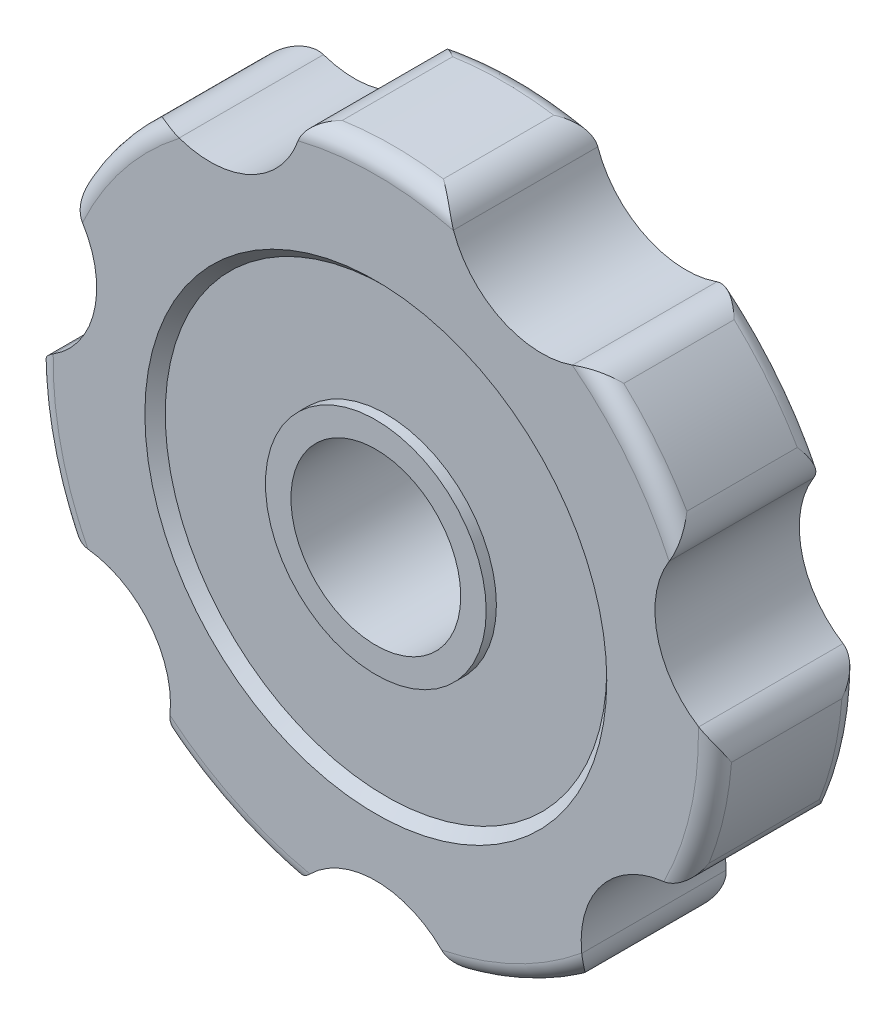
ISO-10303-21;
HEADER;
FILE_DESCRIPTION(('STEP AP214'),'2;1');
FILE_NAME('part.step','',(''),(''),'','','');
FILE_SCHEMA(('AUTOMOTIVE_DESIGN { 1 0 10303 214 1 1 1 1 }'));
ENDSEC;
DATA;
#1=APPLICATION_CONTEXT('core data for automotive mechanical design processes');
#2=APPLICATION_PROTOCOL_DEFINITION('international standard','automotive_design',2000,#1);
#3=PRODUCT_CONTEXT('',#1,'mechanical');
#4=PRODUCT('Part','Part','',(#3));
#5=PRODUCT_RELATED_PRODUCT_CATEGORY('part','',(#4));
#6=PRODUCT_DEFINITION_FORMATION('','',#4);
#7=PRODUCT_DEFINITION_CONTEXT('part definition',#1,'design');
#8=PRODUCT_DEFINITION('design','',#6,#7);
#9=PRODUCT_DEFINITION_SHAPE('','',#8);
#10=(LENGTH_UNIT() NAMED_UNIT(*) SI_UNIT(.MILLI.,.METRE.));
#11=(NAMED_UNIT(*) PLANE_ANGLE_UNIT() SI_UNIT($,.RADIAN.));
#12=(NAMED_UNIT(*) SI_UNIT($,.STERADIAN.) SOLID_ANGLE_UNIT());
#13=UNCERTAINTY_MEASURE_WITH_UNIT(LENGTH_MEASURE(1.E-05),#10,'distance_accuracy_value','');
#14=(GEOMETRIC_REPRESENTATION_CONTEXT(3) GLOBAL_UNCERTAINTY_ASSIGNED_CONTEXT((#13)) GLOBAL_UNIT_ASSIGNED_CONTEXT((#10,
#11,#12)) REPRESENTATION_CONTEXT('',''));
#15=CARTESIAN_POINT('',(0.,0.,0.));
#16=DIRECTION('',(0.,0.,1.));
#17=DIRECTION('',(1.,0.,0.));
#18=AXIS2_PLACEMENT_3D('',#15,#16,#17);
#19=CARTESIAN_POINT('',(0.,0.,2.5));
#20=DIRECTION('',(0.,0.,1.));
#21=DIRECTION('',(1.,0.,0.));
#22=AXIS2_PLACEMENT_3D('',#19,#20,#21);
#23=TOROIDAL_SURFACE('',#22,19.,1.);
#24=CARTESIAN_POINT('',(0.,0.,1.5));
#25=DIRECTION('',(0.,0.,1.));
#26=DIRECTION('',(1.,0.,0.));
#27=AXIS2_PLACEMENT_3D('',#24,#25,#26);
#28=CIRCLE('',#27,19.);
#29=CARTESIAN_POINT('',(-11.5643244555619,15.0753573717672,1.5));
#30=VERTEX_POINT('',#29);
#31=CARTESIAN_POINT('',(-17.2706909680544,7.9198000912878,1.5));
#32=VERTEX_POINT('',#31);
#33=EDGE_CURVE('E900',#30,#32,#28,.T.);
#34=ORIENTED_EDGE('',*,*,#33,.T.);
#35=CARTESIAN_POINT('',(-16.7046130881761,6.70491627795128,2.5002));
#36=CARTESIAN_POINT('',(-16.7046095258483,6.70490149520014,2.47826247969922));
#37=CARTESIAN_POINT('',(-16.7049569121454,6.70597566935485,2.45634113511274));
#38=CARTESIAN_POINT('',(-16.7063365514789,6.71021854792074,2.41275414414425));
#39=CARTESIAN_POINT('',(-16.7073678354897,6.71338428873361,2.39108818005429));
#40=CARTESIAN_POINT('',(-16.7114278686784,6.72578978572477,2.32727522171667));
#41=CARTESIAN_POINT('',(-16.7154237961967,6.73794238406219,2.2857305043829));
#42=CARTESIAN_POINT('',(-16.7257066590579,6.76864289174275,2.20573363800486));
#43=CARTESIAN_POINT('',(-16.7319815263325,6.78715708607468,2.16726647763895));
#44=CARTESIAN_POINT('',(-16.7465590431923,6.82921041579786,2.0934783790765));
#45=CARTESIAN_POINT('',(-16.7548688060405,6.85276714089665,2.05816908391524));
#46=CARTESIAN_POINT('',(-16.7785613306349,6.91823332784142,1.97162323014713));
#47=CARTESIAN_POINT('',(-16.7952682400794,6.96292333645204,1.9228568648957));
#48=CARTESIAN_POINT('',(-16.8325670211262,7.05827204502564,1.83329204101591));
#49=CARTESIAN_POINT('',(-16.853168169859,7.10894488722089,1.79251309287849));
#50=CARTESIAN_POINT('',(-16.9045165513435,7.22952095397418,1.70786538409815));
#51=CARTESIAN_POINT('',(-16.9364702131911,7.30072058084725,1.66656797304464));
#52=CARTESIAN_POINT('',(-17.0059661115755,7.44649475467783,1.5969623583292));
#53=CARTESIAN_POINT('',(-17.0435016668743,7.52106519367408,1.56863878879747));
#54=CARTESIAN_POINT('',(-17.1138235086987,7.65283054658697,1.53109747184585));
#55=CARTESIAN_POINT('',(-17.1454971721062,7.70977383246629,1.51889018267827));
#56=CARTESIAN_POINT('',(-17.2113702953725,7.82335072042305,1.50297527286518));
#57=CARTESIAN_POINT('',(-17.2455690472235,7.87998440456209,1.49926527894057));
#58=CARTESIAN_POINT('',(-17.2808424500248,7.9359946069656,1.50012770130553));
#59=B_SPLINE_CURVE_WITH_KNOTS('',3,(#35,#36,#37,#38,#39,#40,#41,#42,#43,#44,#45,#46,#47,#48,#49,
#50,#51,#52,#53,#54,#55,#56,#57,#58),.UNSPECIFIED.,.F.,.F.,(4,2,2,2,2,2,2,2,2,2,2,4),(0.,
0.0657529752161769,0.131412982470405,0.261016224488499,0.389942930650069,0.519326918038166,
0.722866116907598,0.926896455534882,1.19047015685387,1.45373087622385,1.65204860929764,
1.85031094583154),.UNSPECIFIED.);
#60=CARTESIAN_POINT('',(-17.2807166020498,7.9357946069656,1.50012455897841));
#61=VERTEX_POINT('',#60);
#62=EDGE_CURVE('E492',#32,#61,#59,.T.);
#63=ORIENTED_EDGE('',*,*,#62,.T.);
#64=CARTESIAN_POINT('',(-17.3199228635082,10.0010135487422,2.5));
#65=CARTESIAN_POINT('',(-17.3212278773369,9.99875348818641,2.49824931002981));
#66=CARTESIAN_POINT('',(-17.3225285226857,9.99649079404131,2.49649855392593));
#67=CARTESIAN_POINT('',(-17.3901089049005,9.87838947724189,2.40522105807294));
#68=CARTESIAN_POINT('',(-17.4449491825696,9.75569343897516,2.31556308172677));
#69=CARTESIAN_POINT('',(-17.5296463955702,9.49897449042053,2.14005268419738));
#70=CARTESIAN_POINT('',(-17.5594489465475,9.3649276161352,2.05420892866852));
#71=CARTESIAN_POINT('',(-17.5864255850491,9.12735243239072,1.9146716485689));
#72=CARTESIAN_POINT('',(-17.5904408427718,9.02590630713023,1.85874868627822));
#73=CARTESIAN_POINT('',(-17.5823737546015,8.81983067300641,1.75440378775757));
#74=CARTESIAN_POINT('',(-17.5703199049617,8.7152071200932,1.7059687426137));
#75=CARTESIAN_POINT('',(-17.5342706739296,8.53429892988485,1.63262413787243));
#76=CARTESIAN_POINT('',(-17.5145684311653,8.4582891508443,1.6049256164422));
#77=CARTESIAN_POINT('',(-17.4653730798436,8.30701880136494,1.55775512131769));
#78=CARTESIAN_POINT('',(-17.4359146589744,8.23175653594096,1.53825454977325));
#79=CARTESIAN_POINT('',(-17.3839224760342,8.11991170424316,1.51705311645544));
#80=CARTESIAN_POINT('',(-17.3650246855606,8.08237647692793,1.51130993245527));
#81=CARTESIAN_POINT('',(-17.3246870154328,8.00820371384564,1.50311901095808));
#82=CARTESIAN_POINT('',(-17.3032405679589,7.97156880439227,1.50067999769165));
#83=CARTESIAN_POINT('',(-17.2805907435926,7.9355946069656,1.50012145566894));
#84=B_SPLINE_CURVE_WITH_KNOTS('',3,(#64,#65,#66,#67,#68,#69,#70,#71,#72,#73,#74,#75,#76,#77,#78,
#79,#80,#81,#82,#83),.UNSPECIFIED.,.F.,.F.,(4,2,2,2,2,2,2,2,2,4),(0.,0.00942810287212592,
0.491529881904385,0.974676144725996,1.32127056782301,1.66725117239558,1.91627414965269,
2.16442107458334,2.29147390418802,2.41886155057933),.UNSPECIFIED.);
#85=CARTESIAN_POINT('',(-17.3199228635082,10.0010135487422,2.5));
#86=VERTEX_POINT('',#85);
#87=EDGE_CURVE('E580',#86,#61,#84,.T.);
#88=ORIENTED_EDGE('',*,*,#87,.F.);
#89=CARTESIAN_POINT('',(0.,0.,2.5));
#90=DIRECTION('',(0.,0.,1.));
#91=DIRECTION('',(1.,0.,0.));
#92=AXIS2_PLACEMENT_3D('',#89,#90,#91);
#93=CIRCLE('',#92,20.);
#94=CARTESIAN_POINT('',(-13.6043125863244,14.6602414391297,2.5));
#95=VERTEX_POINT('',#94);
#96=EDGE_CURVE('E885',#95,#86,#93,.T.);
#97=ORIENTED_EDGE('',*,*,#96,.F.);
#98=CARTESIAN_POINT('',(-11.5819487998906,15.0815023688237,1.50012177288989));
#99=CARTESIAN_POINT('',(-11.6225983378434,15.0957681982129,1.50068844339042));
#100=CARTESIAN_POINT('',(-11.6636359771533,15.108677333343,1.5031865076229));
#101=CARTESIAN_POINT('',(-11.7460455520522,15.1317359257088,1.51158063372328));
#102=CARTESIAN_POINT('',(-11.7874165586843,15.1418913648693,1.51746924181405));
#103=CARTESIAN_POINT('',(-11.9106551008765,15.1680338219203,1.53936960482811));
#104=CARTESIAN_POINT('',(-11.9926294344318,15.180035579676,1.55965190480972));
#105=CARTESIAN_POINT('',(-12.172803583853,15.1954327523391,1.61407464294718));
#106=CARTESIAN_POINT('',(-12.2705585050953,15.1963212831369,1.65029365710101));
#107=CARTESIAN_POINT('',(-12.461979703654,15.1846168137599,1.73143610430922));
#108=CARTESIAN_POINT('',(-12.5556205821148,15.1719497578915,1.77640624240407));
#109=CARTESIAN_POINT('',(-12.7692575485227,15.1280441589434,1.88896052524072));
#110=CARTESIAN_POINT('',(-12.8869687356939,15.0918478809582,1.95894206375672));
#111=CARTESIAN_POINT('',(-13.1105225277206,15.0007355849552,2.10464259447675));
#112=CARTESIAN_POINT('',(-13.2163783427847,14.9458406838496,2.18035503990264));
#113=CARTESIAN_POINT('',(-13.4168914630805,14.8185087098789,2.33563498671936));
#114=CARTESIAN_POINT('',(-13.5113702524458,14.7458356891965,2.41524173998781));
#115=CARTESIAN_POINT('',(-13.6004831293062,14.663788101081,2.49649855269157));
#116=CARTESIAN_POINT('',(-13.6023996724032,14.6620165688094,2.49824930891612));
#117=CARTESIAN_POINT('',(-13.6043126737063,14.6602413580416,2.5));
#118=B_SPLINE_CURVE_WITH_KNOTS('',3,(#98,#99,#100,#101,#102,#103,#104,#105,#106,#107,#108,#109,
#110,#111,#112,#113,#114,#115,#116,#117),.UNSPECIFIED.,.F.,.F.,(4,2,2,2,2,2,2,2,2,4),(0.,
0.129094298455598,0.257905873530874,0.512465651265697,0.823625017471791,1.13649300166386,
1.55916914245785,1.9813695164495,2.40951016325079,2.41893826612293),.UNSPECIFIED.);
#119=CARTESIAN_POINT('',(-11.5821487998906,15.0815725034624,1.50012455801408));
#120=VERTEX_POINT('',#119);
#121=EDGE_CURVE('E573',#120,#95,#118,.T.);
#122=ORIENTED_EDGE('',*,*,#121,.F.);
#123=CARTESIAN_POINT('',(-11.5823487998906,15.0816426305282,1.50012737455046));
#124=CARTESIAN_POINT('',(-11.5422046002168,15.0675627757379,1.49956336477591));
#125=CARTESIAN_POINT('',(-11.5019044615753,15.0539578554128,1.50089874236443));
#126=CARTESIAN_POINT('',(-11.4212810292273,15.0277694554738,1.50718150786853));
#127=CARTESIAN_POINT('',(-11.3809577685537,15.0151853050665,1.51212650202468));
#128=CARTESIAN_POINT('',(-11.2603225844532,14.9790492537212,1.53209614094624));
#129=CARTESIAN_POINT('',(-11.180327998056,14.9571077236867,1.55225536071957));
#130=CARTESIAN_POINT('',(-11.0245375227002,14.9179825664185,1.60470356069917));
#131=CARTESIAN_POINT('',(-10.9487001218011,14.900739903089,1.6368287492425));
#132=CARTESIAN_POINT('',(-10.8021221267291,14.8704553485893,1.71275329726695));
#133=CARTESIAN_POINT('',(-10.7313802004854,14.8574123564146,1.75654959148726));
#134=CARTESIAN_POINT('',(-10.6165423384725,14.8383092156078,1.84221583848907));
#135=CARTESIAN_POINT('',(-10.5704903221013,14.8313155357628,1.88126446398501));
#136=CARTESIAN_POINT('',(-10.4844594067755,14.8192332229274,1.96585001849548));
#137=CARTESIAN_POINT('',(-10.4444707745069,14.8141415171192,2.01137631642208));
#138=CARTESIAN_POINT('',(-10.3829334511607,14.8068558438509,2.09581262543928));
#139=CARTESIAN_POINT('',(-10.3593235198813,14.804250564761,2.13317675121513));
#140=CARTESIAN_POINT('',(-10.3182895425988,14.7999267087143,2.2111286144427));
#141=CARTESIAN_POINT('',(-10.3008441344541,14.7982050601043,2.25170461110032));
#142=CARTESIAN_POINT('',(-10.276485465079,14.7958680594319,2.32673721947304));
#143=CARTESIAN_POINT('',(-10.2681389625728,14.7950974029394,2.36071994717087));
#144=CARTESIAN_POINT('',(-10.2568035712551,14.7940664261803,2.4298374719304));
#145=CARTESIAN_POINT('',(-10.2538571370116,14.7938101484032,2.46497920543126));
#146=CARTESIAN_POINT('',(-10.2539361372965,14.7938093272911,2.5002));
#147=B_SPLINE_CURVE_WITH_KNOTS('',3,(#123,#124,#125,#126,#127,#128,#129,#130,#131,#132,#133,
#134,#135,#136,#137,#138,#139,#140,#141,#142,#143,#144,#145,#146),.UNSPECIFIED.,.F.,.F.,(4,2,2,
2,2,2,2,2,2,2,2,4),(0.,0.127529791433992,0.254975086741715,0.509811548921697,0.761280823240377,
1.012684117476,1.19451088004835,1.37604260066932,1.50842547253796,1.64034498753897,
1.74493301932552,1.85033983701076),.UNSPECIFIED.);
#148=EDGE_CURVE('E484',#120,#30,#147,.T.);
#149=ORIENTED_EDGE('',*,*,#148,.T.);
#150=EDGE_LOOP('',(#34,#63,#88,#97,#122,#149));
#151=FACE_BOUND('',#150,.T.);
#152=ADVANCED_FACE('F14',(#151),#23,.T.);
#153=CARTESIAN_POINT('',(17.2706909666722,7.91980009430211,1.5));
#154=VERTEX_POINT('',#153);
#155=CARTESIAN_POINT('',(11.5643244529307,15.0753573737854,1.5));
#156=VERTEX_POINT('',#155);
#157=EDGE_CURVE('E894',#154,#156,#28,.T.);
#158=ORIENTED_EDGE('',*,*,#157,.T.);
#159=CARTESIAN_POINT('',(10.2539361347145,14.7938093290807,2.5002));
#160=CARTESIAN_POINT('',(10.2539209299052,14.7938091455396,2.47826247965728));
#161=CARTESIAN_POINT('',(10.2550454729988,14.793908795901,2.45634113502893));
#162=CARTESIAN_POINT('',(10.2594889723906,14.7943097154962,2.41275414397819));
#163=CARTESIAN_POINT('',(10.2628048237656,14.7946106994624,2.39108817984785));
#164=CARTESIAN_POINT('',(10.2758027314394,14.7958084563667,2.32727522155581));
#165=CARTESIAN_POINT('',(10.2885398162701,14.7969999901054,2.28573050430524));
#166=CARTESIAN_POINT('',(10.320758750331,14.8001935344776,2.2057336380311));
#167=CARTESIAN_POINT('',(10.3402050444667,14.8021912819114,2.1672664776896));
#168=CARTESIAN_POINT('',(10.3844478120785,14.8070455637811,2.09347837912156));
#169=CARTESIAN_POINT('',(10.4092630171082,14.8099051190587,2.05816908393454));
#170=CARTESIAN_POINT('',(10.4783599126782,14.8184360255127,1.97162323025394));
#171=CARTESIAN_POINT('',(10.5256470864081,14.8247795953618,1.92285686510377));
#172=CARTESIAN_POINT('',(10.6269049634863,14.8399261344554,1.8332920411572));
#173=CARTESIAN_POINT('',(10.6808915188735,14.8487350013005,1.79251309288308));
#174=CARTESIAN_POINT('',(10.8098705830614,14.8719652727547,1.70786538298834));
#175=CARTESIAN_POINT('',(10.8863954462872,14.8872743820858,1.66656797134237));
#176=CARTESIAN_POINT('',(11.0439790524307,14.9225900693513,1.59696235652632));
#177=CARTESIAN_POINT('',(11.1250323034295,14.9425910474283,1.56863878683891));
#178=CARTESIAN_POINT('',(11.2691383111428,14.9818281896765,1.53109845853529));
#179=CARTESIAN_POINT('',(11.3316980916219,15.0000354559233,1.51889167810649));
#180=CARTESIAN_POINT('',(11.4570777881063,15.0389810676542,1.50297670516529));
#181=CARTESIAN_POINT('',(11.5198976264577,15.0597187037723,1.49926613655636));
#182=CARTESIAN_POINT('',(11.5823488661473,15.0816426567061,1.50012737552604));
#183=B_SPLINE_CURVE_WITH_KNOTS('',3,(#159,#160,#161,#162,#163,#164,#165,#166,#167,#168,#169,
#170,#171,#172,#173,#174,#175,#176,#177,#178,#179,#180,#181,#182),.UNSPECIFIED.,.F.,.F.,(4,2,2,
2,2,2,2,2,2,2,2,4),(0.,0.0657529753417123,0.131412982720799,0.261016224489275,0.389942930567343,
0.519326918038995,0.722866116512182,0.926896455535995,1.19047016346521,1.45373087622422,
1.65203649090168,1.85028663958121),.UNSPECIFIED.);
#184=CARTESIAN_POINT('',(11.5821488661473,15.0815725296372,1.50012455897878));
#185=VERTEX_POINT('',#184);
#186=EDGE_CURVE('E456',#156,#185,#183,.T.);
#187=ORIENTED_EDGE('',*,*,#186,.T.);
#188=CARTESIAN_POINT('',(13.6043126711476,14.660241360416,2.5));
#189=CARTESIAN_POINT('',(13.6023996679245,14.6620165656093,2.49824931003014));
#190=CARTESIAN_POINT('',(13.6004831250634,14.6637880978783,2.49649855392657));
#191=CARTESIAN_POINT('',(13.5003809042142,14.7559541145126,2.40522105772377));
#192=CARTESIAN_POINT('',(13.3929642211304,14.8367218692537,2.31556308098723));
#193=CARTESIAN_POINT('',(13.1615286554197,14.9764208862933,2.14005268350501));
#194=CARTESIAN_POINT('',(13.0374743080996,15.0353044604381,2.05420892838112));
#195=CARTESIAN_POINT('',(12.8118584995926,15.1144701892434,1.9146716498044));
#196=CARTESIAN_POINT('',(12.7138493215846,15.1409586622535,1.85874868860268));
#197=CARTESIAN_POINT('',(12.5111453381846,15.1789499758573,1.75440378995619));
#198=CARTESIAN_POINT('',(12.4064626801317,15.1904792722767,1.70596874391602));
#199=CARTESIAN_POINT('',(12.2220679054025,15.1955897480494,1.63262389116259));
#200=CARTESIAN_POINT('',(12.1435790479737,15.1932951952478,1.60492517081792));
#201=CARTESIAN_POINT('',(11.9851530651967,15.1789938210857,1.5577544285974));
#202=CARTESIAN_POINT('',(11.9052220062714,15.1670211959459,1.53825380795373));
#203=CARTESIAN_POINT('',(11.7846159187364,15.1412209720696,1.51705332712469));
#204=CARTESIAN_POINT('',(11.7438211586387,15.1311505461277,1.51131071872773));
#205=CARTESIAN_POINT('',(11.6625410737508,15.1083321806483,1.50312018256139));
#206=CARTESIAN_POINT('',(11.6220568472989,15.0955772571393,1.50068097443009));
#207=CARTESIAN_POINT('',(11.5819488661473,15.0815023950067,1.50012177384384));
#208=B_SPLINE_CURVE_WITH_KNOTS('',3,(#188,#189,#190,#191,#192,#193,#194,#195,#196,#197,#198,
#199,#200,#201,#202,#203,#204,#205,#206,#207),.UNSPECIFIED.,.F.,.F.,(4,2,2,2,2,2,2,2,2,4),(0.,
0.00942810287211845,0.49152988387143,0.974676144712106,1.3212705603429,1.66725117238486,
1.91627614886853,2.16442505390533,2.29146379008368,2.4188372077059),.UNSPECIFIED.);
#209=CARTESIAN_POINT('',(13.6043126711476,14.660241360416,2.5));
#210=VERTEX_POINT('',#209);
#211=EDGE_CURVE('E550',#210,#185,#208,.T.);
#212=ORIENTED_EDGE('',*,*,#211,.F.);
#213=CARTESIAN_POINT('',(17.3199229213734,10.0010134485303,2.5));
#214=VERTEX_POINT('',#213);
#215=EDGE_CURVE('E895',#214,#210,#93,.T.);
#216=ORIENTED_EDGE('',*,*,#215,.F.);
#217=CARTESIAN_POINT('',(17.2805907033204,7.93559454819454,1.5001214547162));
#218=CARTESIAN_POINT('',(17.3035447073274,7.97205024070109,1.50068739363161));
#219=CARTESIAN_POINT('',(17.3252624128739,8.00918624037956,1.50318477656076));
#220=CARTESIAN_POINT('',(17.3660817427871,8.08439831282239,1.51157763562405));
#221=CARTESIAN_POINT('',(17.3851889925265,8.12247214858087,1.51746565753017));
#222=CARTESIAN_POINT('',(17.4381006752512,8.23680331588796,1.53936440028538));
#223=CARTESIAN_POINT('',(17.4680435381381,8.31405166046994,1.55964578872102));
#224=CARTESIAN_POINT('',(17.5231488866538,8.48628077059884,1.61406631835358));
#225=CARTESIAN_POINT('',(17.5457685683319,8.58138565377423,1.65028390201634));
#226=CARTESIAN_POINT('',(17.5769549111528,8.77060939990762,1.7314235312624));
#227=CARTESIAN_POINT('',(17.5854437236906,8.86471998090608,1.77639228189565));
#228=CARTESIAN_POINT('',(17.5901808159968,9.08276839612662,1.88894363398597));
#229=CARTESIAN_POINT('',(17.5810872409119,9.20558187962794,1.95892369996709));
#230=CARTESIAN_POINT('',(17.5420089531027,9.4438036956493,2.10462149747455));
#231=CARTESIAN_POINT('',(17.512047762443,9.55922020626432,2.18033268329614));
#232=CARTESIAN_POINT('',(17.4325269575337,9.78305190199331,2.33561904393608));
#233=CARTESIAN_POINT('',(17.382695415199,9.89134457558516,2.41523379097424));
#234=CARTESIAN_POINT('',(17.3225285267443,9.9964907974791,2.49649855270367));
#235=CARTESIAN_POINT('',(17.3212278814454,9.99875349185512,2.49824930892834));
#236=CARTESIAN_POINT('',(17.3199228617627,10.0010135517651,2.5));
#237=B_SPLINE_CURVE_WITH_KNOTS('',3,(#217,#218,#219,#220,#221,#222,#223,#224,#225,#226,#227,
#228,#229,#230,#231,#232,#233,#234,#235,#236),.UNSPECIFIED.,.F.,.F.,(4,2,2,2,2,2,2,2,2,4),(0.,
0.129094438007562,0.257906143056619,0.512466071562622,0.823620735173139,1.13648398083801,
1.55915530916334,1.98135097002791,2.40953441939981,2.41896252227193),.UNSPECIFIED.);
#238=CARTESIAN_POINT('',(17.2807165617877,7.93579454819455,1.50012455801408));
#239=VERTEX_POINT('',#238);
#240=EDGE_CURVE('E542',#239,#214,#237,.T.);
#241=ORIENTED_EDGE('',*,*,#240,.F.);
#242=CARTESIAN_POINT('',(17.280842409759,7.93599454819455,1.50012770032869));
#243=CARTESIAN_POINT('',(17.2581824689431,7.89998998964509,1.49956296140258));
#244=CARTESIAN_POINT('',(17.2359508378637,7.86372768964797,1.50089763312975));
#245=CARTESIAN_POINT('',(17.1924782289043,7.79095317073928,1.50717902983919));
#246=CARTESIAN_POINT('',(17.1712366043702,7.75444113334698,1.51212336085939));
#247=CARTESIAN_POINT('',(17.1091620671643,7.64487153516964,1.53209105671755));
#248=CARTESIAN_POINT('',(17.0699697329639,7.57176493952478,1.552249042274));
#249=CARTESIAN_POINT('',(16.99715820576,7.42858677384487,1.60469468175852));
#250=CARTESIAN_POINT('',(16.9634721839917,7.35848785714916,1.63681845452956));
#251=CARTESIAN_POINT('',(16.9013296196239,7.22232396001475,1.71274002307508));
#252=CARTESIAN_POINT('',(16.8728717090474,7.15625792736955,1.75653475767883));
#253=CARTESIAN_POINT('',(16.8286922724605,7.04854791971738,1.84219940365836));
#254=CARTESIAN_POINT('',(16.8116254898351,7.00520489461,1.88124826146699));
#255=CARTESIAN_POINT('',(16.7807007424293,6.92401582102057,1.96583461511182));
#256=CARTESIAN_POINT('',(16.7668376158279,6.8861609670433,2.01136147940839));
#257=CARTESIAN_POINT('',(16.7460401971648,6.82778507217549,2.09579855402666));
#258=CARTESIAN_POINT('',(16.738246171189,6.80534589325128,2.1331627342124));
#259=CARTESIAN_POINT('',(16.7248991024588,6.76630098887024,2.21111483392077));
#260=CARTESIAN_POINT('',(16.7193383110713,6.74967511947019,2.2516910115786));
#261=CARTESIAN_POINT('',(16.7116388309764,6.72644497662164,2.32672587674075));
#262=CARTESIAN_POINT('',(16.7090298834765,6.71847819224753,2.36071072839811));
#263=CARTESIAN_POINT('',(16.7055019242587,6.7076549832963,2.42983273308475));
#264=CARTESIAN_POINT('',(16.7045963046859,6.70483906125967,2.46497682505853));
#265=CARTESIAN_POINT('',(16.7046130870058,6.70491628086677,2.5002));
#266=B_SPLINE_CURVE_WITH_KNOTS('',3,(#242,#243,#244,#245,#246,#247,#248,#249,#250,#251,#252,
#253,#254,#255,#256,#257,#258,#259,#260,#261,#262,#263,#264,#265),.UNSPECIFIED.,.F.,.F.,(4,2,2,
2,2,2,2,2,2,2,2,4),(0.,0.12752989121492,0.254975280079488,0.509811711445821,0.76127912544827,
1.01268064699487,1.19451259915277,1.37604950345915,1.50843411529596,1.64035534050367,
1.74495026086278,1.85036415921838),.UNSPECIFIED.);
#267=EDGE_CURVE('E448',#239,#154,#266,.T.);
#268=ORIENTED_EDGE('',*,*,#267,.T.);
#269=EDGE_LOOP('',(#158,#187,#212,#216,#241,#268));
#270=FACE_BOUND('',#269,.T.);
#271=ADVANCED_FACE('F1079',(#270),#23,.T.);
#272=CARTESIAN_POINT('',(16.9600487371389,-8.56485533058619,1.5));
#273=VERTEX_POINT('',#272);
#274=CARTESIAN_POINT('',(18.9966273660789,0.357978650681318,1.5));
#275=VERTEX_POINT('',#274);
#276=EDGE_CURVE('E1076',#273,#275,#28,.T.);
#277=ORIENTED_EDGE('',*,*,#276,.T.);
#278=CARTESIAN_POINT('',(17.9594904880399,1.20693915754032,2.5002));
#279=CARTESIAN_POINT('',(17.9594808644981,1.20695093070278,2.47826247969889));
#280=CARTESIAN_POINT('',(17.9602599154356,1.20613385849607,2.45634113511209));
#281=CARTESIAN_POINT('',(17.9633438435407,1.20290976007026,2.41275414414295));
#282=CARTESIAN_POINT('',(17.9656465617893,1.20050498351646,2.39108818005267));
#283=CARTESIAN_POINT('',(17.9746870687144,1.19108959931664,2.32727522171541));
#284=CARTESIAN_POINT('',(17.9835600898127,1.18187425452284,2.28573050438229));
#285=CARTESIAN_POINT('',(18.0061450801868,1.15867561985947,2.20573363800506));
#286=CARTESIAN_POINT('',(18.0198315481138,1.14471747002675,2.16726647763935));
#287=CARTESIAN_POINT('',(18.051211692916,1.11315367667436,2.09347837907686));
#288=CARTESIAN_POINT('',(18.068919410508,1.09553527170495,2.05816908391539));
#289=CARTESIAN_POINT('',(18.1186703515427,1.04683207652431,1.97162323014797));
#290=CARTESIAN_POINT('',(18.1531130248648,1.01381662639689,1.92285686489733));
#291=CARTESIAN_POINT('',(18.2280883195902,0.944093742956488,1.83329204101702));
#292=CARTESIAN_POINT('',(18.2686354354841,0.907377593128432,1.79251309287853));
#293=CARTESIAN_POINT('',(18.3672147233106,0.82102153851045,1.70786538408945));
#294=CARTESIAN_POINT('',(18.426896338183,0.770737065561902,1.66656797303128));
#295=CARTESIAN_POINT('',(18.5527590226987,0.669552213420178,1.59696235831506));
#296=CARTESIAN_POINT('',(18.6189322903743,0.61865263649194,1.56863878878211));
#297=CARTESIAN_POINT('',(18.7394608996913,0.530447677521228,1.53109747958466));
#298=CARTESIAN_POINT('',(18.7927046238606,0.492886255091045,1.51889019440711));
#299=CARTESIAN_POINT('',(18.901333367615,0.419138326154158,1.50297528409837));
#300=CARTESIAN_POINT('',(18.9567177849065,0.382951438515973,1.49926528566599));
#301=CARTESIAN_POINT('',(19.0127999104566,0.347792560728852,1.50012769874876));
#302=B_SPLINE_CURVE_WITH_KNOTS('',3,(#278,#279,#280,#281,#282,#283,#284,#285,#286,#287,#288,
#289,#290,#291,#292,#293,#294,#295,#296,#297,#298,#299,#300,#301),.UNSPECIFIED.,.F.,.F.,(4,2,2,
2,2,2,2,2,2,2,2,4),(0.,0.0657529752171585,0.131412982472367,0.261016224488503,0.389942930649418,
0.519326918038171,0.722866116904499,0.926896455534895,1.19047015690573,1.45373087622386,
1.65204851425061,1.85031075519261),.UNSPECIFIED.);
#303=CARTESIAN_POINT('',(19.0125999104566,0.347918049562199,1.50012455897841));
#304=VERTEX_POINT('',#303);
#305=EDGE_CURVE('E438',#275,#304,#302,.T.);
#306=ORIENTED_EDGE('',*,*,#305,.T.);
#307=CARTESIAN_POINT('',(19.943988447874,-1.49576896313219,2.5));
#308=CARTESIAN_POINT('',(19.9441836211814,-1.49316649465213,2.49824931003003));
#309=CARTESIAN_POINT('',(19.9443737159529,-1.4905635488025,2.49649855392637));
#310=CARTESIAN_POINT('',(19.9540192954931,-1.35483591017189,2.40522105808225));
#311=CARTESIAN_POINT('',(19.950192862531,-1.22049629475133,2.31556308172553));
#312=CARTESIAN_POINT('',(19.9151162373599,-0.952451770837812,2.1400526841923));
#313=CARTESIAN_POINT('',(19.8838066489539,-0.818748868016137,2.05420892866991));
#314=CARTESIAN_POINT('',(19.8050317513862,-0.592996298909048,1.91467164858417));
#315=CARTESIAN_POINT('',(19.7646335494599,-0.499854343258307,1.85874868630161));
#316=CARTESIAN_POINT('',(19.6679524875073,-0.317686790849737,1.75440378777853));
#317=CARTESIAN_POINT('',(19.6116978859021,-0.228654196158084,1.70596874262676));
#318=CARTESIAN_POINT('',(19.500725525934,-0.0813027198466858,1.63262413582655));
#319=CARTESIAN_POINT('',(19.449995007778,-0.0213687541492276,1.60492561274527));
#320=CARTESIAN_POINT('',(19.3400377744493,0.0935760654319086,1.55775511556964));
#321=CARTESIAN_POINT('',(19.280841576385,0.148603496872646,1.53825454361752));
#322=CARTESIAN_POINT('',(19.1854706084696,0.226813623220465,1.51705311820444));
#323=CARTESIAN_POINT('',(19.1521583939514,0.252432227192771,1.5113099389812));
#324=CARTESIAN_POINT('',(19.0836331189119,0.301757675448,1.50311902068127));
#325=CARTESIAN_POINT('',(19.0484152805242,0.325459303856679,1.50068000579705));
#326=CARTESIAN_POINT('',(19.0123999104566,0.348043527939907,1.5001214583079));
#327=B_SPLINE_CURVE_WITH_KNOTS('',3,(#307,#308,#309,#310,#311,#312,#313,#314,#315,#316,#317,
#318,#319,#320,#321,#322,#323,#324,#325,#326),.UNSPECIFIED.,.F.,.F.,(4,2,2,2,2,2,2,2,2,4),(0.,
0.00942810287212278,0.49152988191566,0.974676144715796,1.32127056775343,1.66725117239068,
1.91627416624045,2.16442110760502,2.29147382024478,2.41886134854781),.UNSPECIFIED.);
#328=CARTESIAN_POINT('',(19.943988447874,-1.49576896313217,2.5));
#329=VERTEX_POINT('',#328);
#330=EDGE_CURVE('E534',#329,#304,#327,.T.);
#331=ORIENTED_EDGE('',*,*,#330,.F.);
#332=CARTESIAN_POINT('',(18.6179024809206,-7.30573112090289,2.5));
#333=VERTEX_POINT('',#332);
#334=EDGE_CURVE('E948',#333,#329,#93,.T.);
#335=ORIENTED_EDGE('',*,*,#334,.F.);
#336=CARTESIAN_POINT('',(16.9786045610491,-8.56274367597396,1.50012191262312));
#337=CARTESIAN_POINT('',(17.0214181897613,-8.55795934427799,1.50068890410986));
#338=CARTESIAN_POINT('',(17.0639928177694,-8.55178428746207,1.50318726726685));
#339=CARTESIAN_POINT('',(17.148245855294,-8.53680275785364,1.51158194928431));
#340=CARTESIAN_POINT('',(17.1899260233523,-8.52800207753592,1.5174708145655));
#341=CARTESIAN_POINT('',(17.3123025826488,-8.49808382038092,1.53937188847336));
#342=CARTESIAN_POINT('',(17.3913660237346,-8.47332933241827,1.55965458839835));
#343=CARTESIAN_POINT('',(17.5603779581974,-8.4090260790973,1.61407829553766));
#344=CARTESIAN_POINT('',(17.6488378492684,-8.36741165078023,1.65029793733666));
#345=CARTESIAN_POINT('',(17.8162243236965,-8.27381029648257,1.73144162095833));
#346=CARTESIAN_POINT('',(17.8950958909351,-8.22176766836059,1.77641236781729));
#347=CARTESIAN_POINT('',(18.0685260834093,-8.08951480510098,1.88896793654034));
#348=CARTESIAN_POINT('',(18.1588749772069,-8.00582919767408,1.95895012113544));
#349=CARTESIAN_POINT('',(18.3207571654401,-7.82674166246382,2.10465185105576));
#350=CARTESIAN_POINT('',(18.3923115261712,-7.73135302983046,2.18036484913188));
#351=CARTESIAN_POINT('',(18.5177161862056,-7.52963462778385,2.33564198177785));
#352=CARTESIAN_POINT('',(18.5713042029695,-7.42317021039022,2.41524522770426));
#353=CARTESIAN_POINT('',(18.6159910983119,-7.31058809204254,2.49649855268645));
#354=CARTESIAN_POINT('',(18.6169492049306,-7.30816043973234,2.49824930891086));
#355=CARTESIAN_POINT('',(18.6179025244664,-7.30573100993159,2.5));
#356=B_SPLINE_CURVE_WITH_KNOTS('',3,(#336,#337,#338,#339,#340,#341,#342,#343,#344,#345,#346,
#347,#348,#349,#350,#351,#352,#353,#354,#355),.UNSPECIFIED.,.F.,.F.,(4,2,2,2,2,2,2,2,2,4),(0.,
0.129094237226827,0.25790575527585,0.512465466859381,0.823626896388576,1.1364969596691,
1.55917521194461,1.98137765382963,2.40949952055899,2.41892762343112),.UNSPECIFIED.);
#357=CARTESIAN_POINT('',(16.9788045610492,-8.56272127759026,1.50012455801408));
#358=VERTEX_POINT('',#357);
#359=EDGE_CURVE('E526',#358,#333,#356,.T.);
#360=ORIENTED_EDGE('',*,*,#359,.F.);
#361=CARTESIAN_POINT('',(16.9790045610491,-8.56269887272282,1.50012723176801));
#362=CARTESIAN_POINT('',(16.9367268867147,-8.56743135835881,1.49956354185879));
#363=CARTESIAN_POINT('',(16.894514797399,-8.57265940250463,1.50089922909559));
#364=CARTESIAN_POINT('',(16.8105129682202,-8.58404581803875,1.50718259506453));
#365=CARTESIAN_POINT('',(16.7687229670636,-8.59020357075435,1.51212788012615));
#366=CARTESIAN_POINT('',(16.6443557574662,-8.6099879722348,1.53209837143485));
#367=CARTESIAN_POINT('',(16.5627632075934,-8.62492781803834,1.55225813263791));
#368=CARTESIAN_POINT('',(16.4054252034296,-8.65727249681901,1.60470745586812));
#369=CARTESIAN_POINT('',(16.3296167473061,-8.67464216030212,1.63683326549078));
#370=CARTESIAN_POINT('',(16.1844146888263,-8.7109547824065,1.71275912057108));
#371=CARTESIAN_POINT('',(16.1150194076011,-8.72989732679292,1.75655609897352));
#372=CARTESIAN_POINT('',(16.0032666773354,-8.76251215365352,1.84222304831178));
#373=CARTESIAN_POINT('',(15.9587416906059,-8.77619208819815,1.88127157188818));
#374=CARTESIAN_POINT('',(15.8759899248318,-8.80263328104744,1.96585677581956));
#375=CARTESIAN_POINT('',(15.8377530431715,-8.81539599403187,2.01138282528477));
#376=CARTESIAN_POINT('',(15.7791498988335,-8.8355315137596,2.09581879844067));
#377=CARTESIAN_POINT('',(15.7567481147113,-8.84342807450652,2.1331829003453));
#378=CARTESIAN_POINT('',(15.7179025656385,-8.85733611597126,2.21113465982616));
#379=CARTESIAN_POINT('',(15.7014382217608,-8.86335409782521,2.25171057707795));
#380=CARTESIAN_POINT('',(15.6784788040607,-8.87181701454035,2.32674219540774));
#381=CARTESIAN_POINT('',(15.6706249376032,-8.87474392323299,2.36072399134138));
#382=CARTESIAN_POINT('',(15.6599653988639,-8.87873305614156,2.42983955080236));
#383=CARTESIAN_POINT('',(15.6571997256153,-8.87978050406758,2.46498024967));
#384=CARTESIAN_POINT('',(15.6572705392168,-8.87974549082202,2.5002));
#385=B_SPLINE_CURVE_WITH_KNOTS('',3,(#361,#362,#363,#364,#365,#366,#367,#368,#369,#370,#371,
#372,#373,#374,#375,#376,#377,#378,#379,#380,#381,#382,#383,#384),.UNSPECIFIED.,.F.,.F.,(4,2,2,
2,2,2,2,2,2,2,2,4),(0.,0.1275297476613,0.254975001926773,0.509811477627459,0.761281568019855,
1.01268563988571,1.19451012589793,1.37603957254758,1.50842168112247,1.64034044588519,
1.74492545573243,1.85032916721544),.UNSPECIFIED.);
#386=EDGE_CURVE('E430',#358,#273,#385,.T.);
#387=ORIENTED_EDGE('',*,*,#386,.T.);
#388=EDGE_LOOP('',(#277,#306,#331,#335,#360,#387));
#389=FACE_BOUND('',#388,.T.);
#390=ADVANCED_FACE('F972',(#389),#23,.T.);
#391=CARTESIAN_POINT('',(3.87814388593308,-18.6,1.5));
#392=VERTEX_POINT('',#391);
#393=CARTESIAN_POINT('',(12.12408241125,-14.6289652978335,1.5));
#394=VERTEX_POINT('',#393);
#395=EDGE_CURVE('E1069',#392,#394,#28,.T.);
#396=ORIENTED_EDGE('',*,*,#395,.T.);
#397=CARTESIAN_POINT('',(12.1411821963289,-13.2887808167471,2.5002));
#398=CARTESIAN_POINT('',(12.1411854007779,-13.2887659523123,2.47826247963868));
#399=CARTESIAN_POINT('',(12.141032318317,-13.2898844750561,2.45634113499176));
#400=CARTESIAN_POINT('',(12.140434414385,-13.2943057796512,2.41275414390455));
#401=CARTESIAN_POINT('',(12.1399900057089,-13.2976054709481,2.3910881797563));
#402=CARTESIAN_POINT('',(12.1382654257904,-13.310544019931,2.32727522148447));
#403=CARTESIAN_POINT('',(12.1365928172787,-13.3232269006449,2.28573050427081));
#404=CARTESIAN_POINT('',(12.1325369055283,-13.3553486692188,2.20573363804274));
#405=CARTESIAN_POINT('',(12.1301573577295,-13.3747519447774,2.16726647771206));
#406=CARTESIAN_POINT('',(12.1250449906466,-13.4189656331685,2.09347837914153));
#407=CARTESIAN_POINT('',(12.1223109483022,-13.4437949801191,2.0581690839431));
#408=CARTESIAN_POINT('',(12.115252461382,-13.5130577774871,1.97162323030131));
#409=CARTESIAN_POINT('',(12.1109145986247,-13.5605709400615,1.92285686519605));
#410=CARTESIAN_POINT('',(12.1031493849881,-13.6626604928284,1.83329204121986));
#411=CARTESIAN_POINT('',(12.0997242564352,-13.7172536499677,1.79251309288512));
#412=CARTESIAN_POINT('',(12.0936715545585,-13.8481681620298,1.70786538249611));
#413=CARTESIAN_POINT('',(12.0915684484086,-13.9261809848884,1.66656797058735));
#414=CARTESIAN_POINT('',(12.0909330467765,-14.0876721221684,1.59696235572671));
#415=CARTESIAN_POINT('',(12.0923965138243,-14.1711438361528,1.5686387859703));
#416=CARTESIAN_POINT('',(12.0985832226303,-14.3203661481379,1.53109889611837));
#417=CARTESIAN_POINT('',(12.1024129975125,-14.3854071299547,1.51889234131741));
#418=CARTESIAN_POINT('',(12.1124821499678,-14.5163059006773,1.50297734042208));
#419=CARTESIAN_POINT('',(12.1187208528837,-14.5821634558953,1.49926651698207));
#420=CARTESIAN_POINT('',(12.1261980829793,-14.6479256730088,1.50012723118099));
#421=B_SPLINE_CURVE_WITH_KNOTS('',3,(#397,#398,#399,#400,#401,#402,#403,#404,#405,#406,#407,
#408,#409,#410,#411,#412,#413,#414,#415,#416,#417,#418,#419,#420),.UNSPECIFIED.,.F.,.F.,(4,2,2,
2,2,2,2,2,2,2,2,4),(0.,0.0657529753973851,0.13141298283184,0.261016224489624,0.389942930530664,
0.519326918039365,0.722866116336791,0.926896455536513,1.19047016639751,1.45373087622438,
1.6520311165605,1.85027586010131),.UNSPECIFIED.);
#422=CARTESIAN_POINT('',(12.1261754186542,-14.6477256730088,1.50012455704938));
#423=VERTEX_POINT('',#422);
#424=EDGE_CURVE('E420',#394,#423,#421,.T.);
#425=ORIENTED_EDGE('',*,*,#424,.T.);
#426=CARTESIAN_POINT('',(11.2654341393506,-16.5254347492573,2.5));
#427=CARTESIAN_POINT('',(11.2675905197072,-16.5239647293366,2.49824931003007));
#428=CARTESIAN_POINT('',(11.269744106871,-16.5224904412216,2.49649855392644));
#429=CARTESIAN_POINT('',(11.3818741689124,-16.445406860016,2.40522105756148));
#430=CARTESIAN_POINT('',(11.4845193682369,-16.3586558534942,2.31556308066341));
#431=CARTESIAN_POINT('',(11.6722150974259,-16.1641088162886,2.14005268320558));
#432=CARTESIAN_POINT('',(11.7572270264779,-16.0562675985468,2.05420892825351));
#433=CARTESIAN_POINT('',(11.8846121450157,-15.8539244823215,1.9146716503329));
#434=CARTESIAN_POINT('',(11.9322455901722,-15.7642668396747,1.85874868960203));
#435=CARTESIAN_POINT('',(12.014390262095,-15.5750989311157,1.75440379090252));
#436=CARTESIAN_POINT('',(12.0489245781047,-15.4756063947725,1.70596874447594));
#437=CARTESIAN_POINT('',(12.0949386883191,-15.2969717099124,1.6326237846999));
#438=CARTESIAN_POINT('',(12.1101671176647,-15.219939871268,1.60492497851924));
#439=CARTESIAN_POINT('',(12.1314774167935,-15.0623030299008,1.55775412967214));
#440=CARTESIAN_POINT('',(12.1375912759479,-14.9817115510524,1.53825348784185));
#441=CARTESIAN_POINT('',(12.1392751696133,-14.8583899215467,1.51705341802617));
#442=CARTESIAN_POINT('',(12.1385349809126,-14.816379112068,1.51131105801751));
#443=CARTESIAN_POINT('',(12.1343756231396,-14.732063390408,1.50312068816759));
#444=CARTESIAN_POINT('',(12.1309494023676,-14.6897579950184,1.50068139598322));
#445=CARTESIAN_POINT('',(12.1261527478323,-14.6475256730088,1.50012191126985));
#446=B_SPLINE_CURVE_WITH_KNOTS('',3,(#426,#427,#428,#429,#430,#431,#432,#433,#434,#435,#436,
#437,#438,#439,#440,#441,#442,#443,#444,#445),.UNSPECIFIED.,.F.,.F.,(4,2,2,2,2,2,2,2,2,4),(0.,
0.00942810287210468,0.491529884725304,0.974676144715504,1.32127055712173,1.66725117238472,
1.9162770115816,2.16442677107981,2.29145942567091,2.41882670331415),.UNSPECIFIED.);
#447=CARTESIAN_POINT('',(11.2654341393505,-16.5254347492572,2.5));
#448=VERTEX_POINT('',#447);
#449=EDGE_CURVE('E518',#448,#423,#446,.T.);
#450=ORIENTED_EDGE('',*,*,#449,.F.);
#451=CARTESIAN_POINT('',(5.89622184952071,-19.1111111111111,2.5));
#452=VERTEX_POINT('',#451);
#453=EDGE_CURVE('E891',#452,#448,#93,.T.);
#454=ORIENTED_EDGE('',*,*,#453,.F.);
#455=CARTESIAN_POINT('',(3.89130669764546,-18.6131333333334,1.50012085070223));
#456=CARTESIAN_POINT('',(3.92173999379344,-18.6436247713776,1.50068539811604));
#457=CARTESIAN_POINT('',(3.95311171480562,-18.6730623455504,1.50318148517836));
#458=CARTESIAN_POINT('',(4.01735391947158,-18.729596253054,1.51157193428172));
#459=CARTESIAN_POINT('',(4.05022096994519,-18.7566975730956,1.51745884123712));
#460=CARTESIAN_POINT('',(4.14991049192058,-18.8337264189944,1.53935450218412));
#461=CARTESIAN_POINT('',(4.21855857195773,-18.8801097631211,1.55963415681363));
#462=CARTESIAN_POINT('',(4.37420393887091,-18.972160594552,1.61405048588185));
#463=CARTESIAN_POINT('',(4.46188800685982,-19.0153770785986,1.65026534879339));
#464=CARTESIAN_POINT('',(4.63942215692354,-19.0878906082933,1.73139961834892));
#465=CARTESIAN_POINT('',(4.72928148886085,-19.1171099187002,1.77636573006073));
#466=CARTESIAN_POINT('',(4.94080355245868,-19.170253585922,1.88891150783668));
#467=CARTESIAN_POINT('',(5.06255890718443,-19.1887198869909,1.95888877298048));
#468=CARTESIAN_POINT('',(5.30349933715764,-19.203637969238,2.10458137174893));
#469=CARTESIAN_POINT('',(5.42268714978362,-19.2001144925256,2.18029016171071));
#470=CARTESIAN_POINT('',(5.65862375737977,-19.1724002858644,2.33558872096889));
#471=CARTESIAN_POINT('',(5.77531273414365,-19.1479127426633,2.41521867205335));
#472=CARTESIAN_POINT('',(5.89123267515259,-19.1126450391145,2.49649855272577));
#473=CARTESIAN_POINT('',(5.89372805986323,-19.1118805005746,2.49824930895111));
#474=CARTESIAN_POINT('',(5.8962218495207,-19.1111111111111,2.5));
#475=B_SPLINE_CURVE_WITH_KNOTS('',3,(#455,#456,#457,#458,#459,#460,#461,#462,#463,#464,#465,
#466,#467,#468,#469,#470,#471,#472,#473,#474),.UNSPECIFIED.,.F.,.F.,(4,2,2,2,2,2,2,2,2,4),(0.,
0.129094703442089,0.257906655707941,0.512466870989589,0.823612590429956,1.13646682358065,
1.55912899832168,1.98131569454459,2.40958055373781,2.41900865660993),.UNSPECIFIED.);
#476=CARTESIAN_POINT('',(3.89150642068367,-18.6133333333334,1.50012455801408));
#477=VERTEX_POINT('',#476);
#478=EDGE_CURVE('E510',#477,#452,#475,.T.);
#479=ORIENTED_EDGE('',*,*,#478,.F.);
#480=CARTESIAN_POINT('',(3.89170616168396,-18.6135333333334,1.50012832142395));
#481=CARTESIAN_POINT('',(3.8616468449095,-18.5834294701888,1.49956219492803));
#482=CARTESIAN_POINT('',(3.83124089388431,-18.5536857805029,1.50089552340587));
#483=CARTESIAN_POINT('',(3.76996481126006,-18.4951085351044,1.50717431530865));
#484=CARTESIAN_POINT('',(3.73909500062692,-18.4662743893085,1.51211738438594));
#485=CARTESIAN_POINT('',(3.64608566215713,-18.3813734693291,1.53208138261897));
#486=CARTESIAN_POINT('',(3.58353314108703,-18.3268951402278,1.55223701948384));
#487=CARTESIAN_POINT('',(3.46014740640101,-18.2240478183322,1.60467778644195));
#488=CARTESIAN_POINT('',(3.39930239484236,-18.1756075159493,1.63679886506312));
#489=CARTESIAN_POINT('',(3.28038095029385,-18.0847225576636,1.71271476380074));
#490=CARTESIAN_POINT('',(3.2223037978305,-18.0422763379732,1.75650653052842));
#491=CARTESIAN_POINT('',(3.12712163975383,-17.9752332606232,1.84216812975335));
#492=CARTESIAN_POINT('',(3.0886599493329,-17.9489471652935,1.88121742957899));
#493=CARTESIAN_POINT('',(3.01638170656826,-17.900726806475,1.96580530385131));
#494=CARTESIAN_POINT('',(2.98255771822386,-17.8787855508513,2.01133324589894));
#495=CARTESIAN_POINT('',(2.93026881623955,-17.8455165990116,2.09577177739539));
#496=CARTESIAN_POINT('',(2.91012500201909,-17.8329237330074,2.13313606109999));
#497=CARTESIAN_POINT('',(2.87502584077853,-17.8112208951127,2.21108861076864));
#498=CARTESIAN_POINT('',(2.86005257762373,-17.802098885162,2.25166513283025));
#499=CARTESIAN_POINT('',(2.83911434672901,-17.7894209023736,2.32670429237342));
#500=CARTESIAN_POINT('',(2.83192607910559,-17.7851035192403,2.36069318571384));
#501=CARTESIAN_POINT('',(2.82215681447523,-17.7792541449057,2.4298237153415));
#502=CARTESIAN_POINT('',(2.8196123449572,-17.7777442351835,2.46497229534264));
#503=CARTESIAN_POINT('',(2.81968392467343,-17.7777777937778,2.5002));
#504=B_SPLINE_CURVE_WITH_KNOTS('',3,(#480,#481,#482,#483,#484,#485,#486,#487,#488,#489,#490,
#491,#492,#493,#494,#495,#496,#497,#498,#499,#500,#501,#502,#503),.UNSPECIFIED.,.F.,.F.,(4,2,2,
2,2,2,2,2,2,2,2,4),(0.,0.127530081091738,0.254975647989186,0.509812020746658,0.761275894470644,
1.01267404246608,1.19451587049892,1.37606263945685,1.50845056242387,1.64037504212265,
1.7449830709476,1.85041044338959),.UNSPECIFIED.);
#505=EDGE_CURVE('E412',#477,#392,#504,.T.);
#506=ORIENTED_EDGE('',*,*,#505,.T.);
#507=EDGE_LOOP('',(#396,#425,#450,#454,#479,#506));
#508=FACE_BOUND('',#507,.T.);
#509=ADVANCED_FACE('F1068',(#508),#23,.T.);
#510=CARTESIAN_POINT('',(-12.1240824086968,-14.6289652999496,1.5));
#511=VERTEX_POINT('',#510);
#512=CARTESIAN_POINT('',(-3.87814388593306,-18.6,1.5));
#513=VERTEX_POINT('',#512);
#514=EDGE_CURVE('E995',#511,#513,#28,.T.);
#515=ORIENTED_EDGE('',*,*,#514,.T.);
#516=CARTESIAN_POINT('',(-2.81968392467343,-17.7777777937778,2.5002));
#517=CARTESIAN_POINT('',(-2.81967030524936,-17.7777710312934,2.47826247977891));
#518=CARTESIAN_POINT('',(-2.82064024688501,-17.7783487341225,2.456341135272));
#519=CARTESIAN_POINT('',(-2.82446974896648,-17.7806379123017,2.41275414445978));
#520=CARTESIAN_POINT('',(-2.82732663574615,-17.782347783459,2.39108818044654));
#521=CARTESIAN_POINT('',(-2.83851765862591,-17.7890665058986,2.32727522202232));
#522=CARTESIAN_POINT('',(-2.84947638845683,-17.7956664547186,2.28573050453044));
#523=CARTESIAN_POINT('',(-2.87711901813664,-17.812523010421,2.20573363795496));
#524=CARTESIAN_POINT('',(-2.89377273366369,-17.822760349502,2.16726647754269));
#525=CARTESIAN_POINT('',(-2.93152789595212,-17.8463301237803,2.09347837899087));
#526=CARTESIAN_POINT('',(-2.95264490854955,-17.8596734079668,2.05816908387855));
#527=CARTESIAN_POINT('',(-3.01119763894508,-17.8973395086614,1.9716232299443));
#528=CARTESIAN_POINT('',(-3.05104953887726,-17.9235720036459,1.92285686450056));
#529=CARTESIAN_POINT('',(-3.13570789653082,-17.9811527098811,1.83329204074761));
#530=CARTESIAN_POINT('',(-3.18052607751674,-18.0125131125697,1.79251309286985));
#531=CARTESIAN_POINT('',(-3.28665295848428,-18.0894047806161,1.70786538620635));
#532=CARTESIAN_POINT('',(-3.34895710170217,-18.1364007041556,1.6665679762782));
#533=CARTESIAN_POINT('',(-3.47561211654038,-18.2365919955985,1.59696236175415));
#534=CARTESIAN_POINT('',(-3.53996047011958,-18.2897799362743,1.56863879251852));
#535=CARTESIAN_POINT('',(-3.65277975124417,-18.3876641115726,1.53109559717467));
#536=CARTESIAN_POINT('',(-3.70125293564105,-18.431219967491,1.51888734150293));
#537=CARTESIAN_POINT('',(-3.79733507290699,-18.5207257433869,1.50297255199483));
#538=CARTESIAN_POINT('',(-3.84494426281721,-18.5666749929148,1.49926365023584));
#539=CARTESIAN_POINT('',(-3.89170616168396,-18.6135333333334,1.50012832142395));
#540=B_SPLINE_CURVE_WITH_KNOTS('',3,(#516,#517,#518,#519,#520,#521,#522,#523,#524,#525,#526,
#527,#528,#529,#530,#531,#532,#533,#534,#535,#536,#537,#538,#539),.UNSPECIFIED.,.F.,.F.,(4,2,2,
2,2,2,2,2,2,2,2,4),(0.,0.0657529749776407,0.131412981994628,0.261016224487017,0.389942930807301,
0.519326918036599,0.722866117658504,0.926896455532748,1.19047014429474,1.45373087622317,
1.65207163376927,1.85035712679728),.UNSPECIFIED.);
#541=CARTESIAN_POINT('',(-3.89150642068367,-18.6133333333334,1.50012455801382));
#542=VERTEX_POINT('',#541);
#543=EDGE_CURVE('E402',#513,#542,#540,.T.);
#544=ORIENTED_EDGE('',*,*,#543,.T.);
#545=CARTESIAN_POINT('',(-5.8962218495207,-19.1111111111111,2.5));
#546=CARTESIAN_POINT('',(-5.89372806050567,-19.1118804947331,2.49824931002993));
#547=CARTESIAN_POINT('',(-5.89123267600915,-19.1126450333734,2.49649855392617));
#548=CARTESIAN_POINT('',(-5.76105435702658,-19.1522510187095,2.40522105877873));
#549=CARTESIAN_POINT('',(-5.62923145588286,-19.1784138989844,2.31556308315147));
#550=CARTESIAN_POINT('',(-5.36010208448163,-19.2038622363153,2.14005268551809));
#551=CARTESIAN_POINT('',(-5.22278435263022,-19.2030893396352,2.0542089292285));
#552=CARTESIAN_POINT('',(-4.9851628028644,-19.176524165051,1.9146716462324));
#553=CARTESIAN_POINT('',(-4.88536666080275,-19.1578648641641,1.85874868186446));
#554=CARTESIAN_POINT('',(-4.68625286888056,-19.104143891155,1.75440378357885));
#555=CARTESIAN_POINT('',(-4.58693468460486,-19.0691113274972,1.70596874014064));
#556=CARTESIAN_POINT('',(-4.41858503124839,-18.9937105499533,1.6326246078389));
#557=CARTESIAN_POINT('',(-4.34886619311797,-18.9575891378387,1.60492646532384));
#558=CARTESIAN_POINT('',(-4.21233751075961,-18.8759679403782,1.55775644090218));
#559=CARTESIAN_POINT('',(-4.14551829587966,-18.8305015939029,1.53825596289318));
#560=CARTESIAN_POINT('',(-4.04804077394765,-18.7549209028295,1.51705271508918));
#561=CARTESIAN_POINT('',(-4.01564498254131,-18.7281387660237,1.51130843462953));
#562=CARTESIAN_POINT('',(-3.95229488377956,-18.6722949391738,1.5031167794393));
#563=CARTESIAN_POINT('',(-3.92134460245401,-18.6432274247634,1.50067813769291));
#564=CARTESIAN_POINT('',(-3.89130669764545,-18.6131333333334,1.50012085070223));
#565=B_SPLINE_CURVE_WITH_KNOTS('',3,(#545,#546,#547,#548,#549,#550,#551,#552,#553,#554,#555,
#556,#557,#558,#559,#560,#561,#562,#563,#564),.UNSPECIFIED.,.F.,.F.,(4,2,2,2,2,2,2,2,2,4),(0.,
0.00942810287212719,0.491529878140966,0.974676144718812,1.32127058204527,1.66725117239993,
1.91627034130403,2.16441349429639,2.29149317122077,2.41890792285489),.UNSPECIFIED.);
#566=CARTESIAN_POINT('',(-5.89622184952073,-19.1111111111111,2.5));
#567=VERTEX_POINT('',#566);
#568=EDGE_CURVE('E502',#567,#542,#565,.T.);
#569=ORIENTED_EDGE('',*,*,#568,.F.);
#570=CARTESIAN_POINT('',(-11.2654342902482,-16.5254346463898,2.5));
#571=VERTEX_POINT('',#570);
#572=EDGE_CURVE('E886',#571,#567,#93,.T.);
#573=ORIENTED_EDGE('',*,*,#572,.F.);
#574=CARTESIAN_POINT('',(-12.1261527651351,-14.6475258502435,1.50012191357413));
#575=CARTESIAN_POINT('',(-12.131015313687,-14.6903306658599,1.50068890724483));
#576=CARTESIAN_POINT('',(-12.1344688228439,-14.7332119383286,1.50318727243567));
#577=CARTESIAN_POINT('',(-12.1386109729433,-14.818686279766,1.51158195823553));
#578=CARTESIAN_POINT('',(-12.1393056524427,-14.8612797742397,1.51747082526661));
#579=CARTESIAN_POINT('',(-12.1373688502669,-14.9872455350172,1.53937190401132));
#580=CARTESIAN_POINT('',(-12.1308282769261,-15.0698350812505,1.55965460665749));
#581=CARTESIAN_POINT('',(-12.1057459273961,-15.2489183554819,1.61407832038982));
#582=CARTESIAN_POINT('',(-12.0848590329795,-15.3444204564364,1.65029796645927));
#583=CARTESIAN_POINT('',(-12.0308514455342,-15.5284384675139,1.73144165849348));
#584=CARTESIAN_POINT('',(-11.9976642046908,-15.6169131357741,1.77641240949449));
#585=CARTESIAN_POINT('',(-11.9073190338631,-15.8154241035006,1.88896798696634));
#586=CARTESIAN_POINT('',(-11.8458361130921,-15.92212956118,1.95895017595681));
#587=CARTESIAN_POINT('',(-11.7072608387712,-16.1198037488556,2.10465191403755));
#588=CARTESIAN_POINT('',(-11.6301861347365,-16.2107900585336,2.18036491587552));
#589=CARTESIAN_POINT('',(-11.4614304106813,-16.3779370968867,2.33564202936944));
#590=CARTESIAN_POINT('',(-11.3695597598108,-16.4538720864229,2.41524525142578));
#591=CARTESIAN_POINT('',(-11.2697441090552,-16.5224904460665,2.49649855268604));
#592=CARTESIAN_POINT('',(-11.2675905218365,-16.523964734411,2.49824930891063));
#593=CARTESIAN_POINT('',(-11.2654341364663,-16.5254347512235,2.5));
#594=B_SPLINE_CURVE_WITH_KNOTS('',3,(#574,#575,#576,#577,#578,#579,#580,#581,#582,#583,#584,
#585,#586,#587,#588,#589,#590,#591,#592,#593),.UNSPECIFIED.,.F.,.F.,(4,2,2,2,2,2,2,2,2,4),(0.,
0.129094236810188,0.257905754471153,0.512465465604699,0.823626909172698,1.13649698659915,
1.55917525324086,1.9813777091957,2.40949944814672,2.41892755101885),.UNSPECIFIED.);
#595=CARTESIAN_POINT('',(-12.1261754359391,-14.6477258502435,1.50012455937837));
#596=VERTEX_POINT('',#595);
#597=EDGE_CURVE('E360',#596,#571,#594,.T.);
#598=ORIENTED_EDGE('',*,*,#597,.F.);
#599=CARTESIAN_POINT('',(-12.1261981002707,-14.6479258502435,1.50012723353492));
#600=CARTESIAN_POINT('',(-12.1214042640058,-14.6056550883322,1.49956353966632));
#601=CARTESIAN_POINT('',(-12.1171081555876,-14.5633379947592,1.50089922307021));
#602=CARTESIAN_POINT('',(-12.1095169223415,-14.4789085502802,1.50718258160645));
#603=CARTESIAN_POINT('',(-12.1062211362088,-14.4367960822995,1.51212786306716));
#604=CARTESIAN_POINT('',(-12.0978351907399,-14.3111445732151,1.53209834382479));
#605=CARTESIAN_POINT('',(-12.0942444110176,-14.2282732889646,1.55225809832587));
#606=CARTESIAN_POINT('',(-12.0907671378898,-14.0676827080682,1.60470740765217));
#607=CARTESIAN_POINT('',(-12.0908323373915,-13.9899098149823,1.63683320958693));
#608=CARTESIAN_POINT('',(-12.0939240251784,-13.8402679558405,1.7127590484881));
#609=CARTESIAN_POINT('',(-12.0969497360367,-13.7683974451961,1.75655601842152));
#610=CARTESIAN_POINT('',(-12.1038795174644,-13.6521890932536,1.84222295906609));
#611=CARTESIAN_POINT('',(-12.1073087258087,-13.6057363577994,1.88127148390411));
#612=CARTESIAN_POINT('',(-12.1146729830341,-13.5191756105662,1.9658566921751));
#613=CARTESIAN_POINT('',(-12.1186072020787,-13.4790574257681,2.01138274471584));
#614=CARTESIAN_POINT('',(-12.1251974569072,-13.4174429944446,2.09581872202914));
#615=CARTESIAN_POINT('',(-12.1279111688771,-13.3938457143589,2.13318282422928));
#616=CARTESIAN_POINT('',(-12.1328265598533,-13.3528792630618,2.21113458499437));
#617=CARTESIAN_POINT('',(-12.1350299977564,-13.3354885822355,2.25171050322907));
#618=CARTESIAN_POINT('',(-12.1381717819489,-13.3112216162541,2.32674213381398));
#619=CARTESIAN_POINT('',(-12.1392776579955,-13.3029133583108,2.36072394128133));
#620=CARTESIAN_POINT('',(-12.1407948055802,-13.291633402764,2.42983952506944));
#621=CARTESIAN_POINT('',(-12.1412005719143,-13.2887039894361,2.4649802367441));
#622=CARTESIAN_POINT('',(-12.1411821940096,-13.2887808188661,2.5002));
#623=B_SPLINE_CURVE_WITH_KNOTS('',3,(#599,#600,#601,#602,#603,#604,#605,#606,#607,#608,#609,
#610,#611,#612,#613,#614,#615,#616,#617,#618,#619,#620,#621,#622),.UNSPECIFIED.,.F.,.F.,(4,2,2,
2,2,2,2,2,2,2,2,4),(0.,0.127529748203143,0.254975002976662,0.50981147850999,0.761281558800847,
1.01268562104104,1.19451013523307,1.37603961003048,1.50842172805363,1.640340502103,
1.74492554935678,1.85032929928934),.UNSPECIFIED.);
#624=EDGE_CURVE('E394',#596,#511,#623,.T.);
#625=ORIENTED_EDGE('',*,*,#624,.T.);
#626=EDGE_LOOP('',(#515,#544,#569,#573,#598,#625));
#627=FACE_BOUND('',#626,.T.);
#628=ADVANCED_FACE('F992',(#627),#23,.T.);
#629=CARTESIAN_POINT('',(-19.0123998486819,0.348043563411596,1.50012145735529));
#630=CARTESIAN_POINT('',(-19.0488982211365,0.325157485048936,1.50068740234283));
#631=CARTESIAN_POINT('',(-19.0845779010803,0.301122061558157,1.50318479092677));
#632=CARTESIAN_POINT('',(-19.1539881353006,0.251069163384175,1.51157766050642));
#633=CARTESIAN_POINT('',(-19.187722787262,0.225056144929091,1.51746568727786));
#634=CARTESIAN_POINT('',(-19.2850009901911,0.14500483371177,1.53936444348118));
#635=CARTESIAN_POINT('',(-19.3454953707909,0.0883981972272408,1.55964583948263));
#636=CARTESIAN_POINT('',(-19.4698709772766,-0.0428655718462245,1.61406638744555));
#637=CARTESIAN_POINT('',(-19.5315150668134,-0.118737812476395,1.65028398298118));
#638=CARTESIAN_POINT('',(-19.6417140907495,-0.275691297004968,1.73142363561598));
#639=CARTESIAN_POINT('',(-19.6901952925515,-0.356798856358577,1.77639239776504));
#640=CARTESIAN_POINT('',(-19.7890709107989,-0.551198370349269,1.88894377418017));
#641=CARTESIAN_POINT('',(-19.8341646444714,-0.665795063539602,1.95892385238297));
#642=CARTESIAN_POINT('',(-19.9023168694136,-0.897380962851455,2.10462167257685));
#643=CARTESIAN_POINT('',(-19.9254001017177,-1.01436733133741,2.18033286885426));
#644=CARTESIAN_POINT('',(-19.9508712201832,-1.25053541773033,2.3356191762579));
#645=CARTESIAN_POINT('',(-19.9529609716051,-1.36972474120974,2.41523385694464));
#646=CARTESIAN_POINT('',(-19.9443737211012,-1.49056355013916,2.49649855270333));
#647=CARTESIAN_POINT('',(-19.9441836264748,-1.49316649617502,2.49824930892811));
#648=CARTESIAN_POINT('',(-19.9439884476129,-1.49576896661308,2.5));
#649=B_SPLINE_CURVE_WITH_KNOTS('',3,(#629,#630,#631,#632,#633,#634,#635,#636,#637,#638,#639,
#640,#641,#642,#643,#644,#645,#646,#647,#648),.UNSPECIFIED.,.F.,.F.,(4,2,2,2,2,2,2,2,2,4),(0.,
0.129094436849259,0.257906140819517,0.512466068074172,0.823620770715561,1.13648405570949,
1.55915542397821,1.98135112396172,2.40953421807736,2.41896232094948),.UNSPECIFIED.);
#650=CARTESIAN_POINT('',(-19.0125998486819,0.347918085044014,1.50012455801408));
#651=VERTEX_POINT('',#650);
#652=CARTESIAN_POINT('',(-19.9439884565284,-1.49576884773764,2.5));
#653=VERTEX_POINT('',#652);
#654=EDGE_CURVE('E586',#651,#653,#649,.T.);
#655=ORIENTED_EDGE('',*,*,#654,.F.);
#656=CARTESIAN_POINT('',(-19.0127998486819,0.347792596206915,1.50012769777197));
#657=CARTESIAN_POINT('',(-18.9767621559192,0.370399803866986,1.49956296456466));
#658=CARTESIAN_POINT('',(-18.940998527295,0.393425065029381,1.50089764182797));
#659=CARTESIAN_POINT('',(-18.8702553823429,0.440130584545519,1.50717904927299));
#660=CARTESIAN_POINT('',(-18.835275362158,0.463810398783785,1.51212338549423));
#661=CARTESIAN_POINT('',(-18.7318076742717,0.535596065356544,1.53209109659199));
#662=CARTESIAN_POINT('',(-18.6647768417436,0.584457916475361,1.55224909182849));
#663=CARTESIAN_POINT('',(-18.5370532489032,0.681865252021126,1.60469475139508));
#664=CARTESIAN_POINT('',(-18.4762884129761,0.73040637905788,1.63681853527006));
#665=CARTESIAN_POINT('',(-18.3612206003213,0.826123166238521,1.71274012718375));
#666=CARTESIAN_POINT('',(-18.3069159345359,0.873299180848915,1.75653487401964));
#667=CARTESIAN_POINT('',(-18.2203780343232,0.951173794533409,1.84219953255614));
#668=CARTESIAN_POINT('',(-18.1861955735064,0.982819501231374,1.88124838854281));
#669=CARTESIAN_POINT('',(-18.1231067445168,1.04255056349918,1.96583473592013));
#670=CARTESIAN_POINT('',(-18.0941919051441,1.07064161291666,2.01136159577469));
#671=CARTESIAN_POINT('',(-18.0501257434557,1.11421279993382,2.09579866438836));
#672=CARTESIAN_POINT('',(-18.0333675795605,1.1310480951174,2.13316284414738));
#673=CARTESIAN_POINT('',(-18.0044013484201,1.16043525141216,2.2111149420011));
#674=CARTESIAN_POINT('',(-17.9921775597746,1.17300189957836,2.25169111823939));
#675=CARTESIAN_POINT('',(-17.9751613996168,1.19059084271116,2.32672596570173));
#676=CARTESIAN_POINT('',(-17.9693541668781,1.19663668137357,2.36071080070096));
#677=CARTESIAN_POINT('',(-17.961479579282,1.20485732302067,2.42983277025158));
#678=CARTESIAN_POINT('',(-17.9594418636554,1.2070014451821,2.46497684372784));
#679=CARTESIAN_POINT('',(-17.9594904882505,1.2069391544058,2.5002));
#680=B_SPLINE_CURVE_WITH_KNOTS('',3,(#656,#657,#658,#659,#660,#661,#662,#663,#664,#665,#666,
#667,#668,#669,#670,#671,#672,#673,#674,#675,#676,#677,#678,#679),.UNSPECIFIED.,.F.,.F.,(4,2,2,
2,2,2,2,2,2,2,2,4),(0.,0.127529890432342,0.254975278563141,0.509811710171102,0.761279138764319,
1.01268067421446,1.19451258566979,1.37604944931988,1.50843404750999,1.64035525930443,
1.74495012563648,1.85036396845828),.UNSPECIFIED.);
#681=CARTESIAN_POINT('',(-18.9966273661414,0.357978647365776,1.5));
#682=VERTEX_POINT('',#681);
#683=EDGE_CURVE('E361',#651,#682,#680,.T.);
#684=ORIENTED_EDGE('',*,*,#683,.T.);
#685=CARTESIAN_POINT('',(-16.9600487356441,-8.56485533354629,1.5));
#686=VERTEX_POINT('',#685);
#687=EDGE_CURVE('E1077',#682,#686,#28,.T.);
#688=ORIENTED_EDGE('',*,*,#687,.T.);
#689=CARTESIAN_POINT('',(-15.657270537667,-8.87974549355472,2.5002));
#690=CARTESIAN_POINT('',(-15.6572567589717,-8.87975192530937,2.47826247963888));
#691=CARTESIAN_POINT('',(-15.6583131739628,-8.87935378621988,2.45634113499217));
#692=CARTESIAN_POINT('',(-15.6624905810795,-8.87778704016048,2.41275414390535));
#693=CARTESIAN_POINT('',(-15.6656086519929,-8.87661952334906,2.3910881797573));
#694=CARTESIAN_POINT('',(-15.6778390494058,-8.87205908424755,2.32727522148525));
#695=CARTESIAN_POINT('',(-15.6898317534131,-8.86760620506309,2.28573050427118));
#696=CARTESIAN_POINT('',(-15.7202456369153,-8.85650421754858,2.20573363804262));
#697=CARTESIAN_POINT('',(-15.7386329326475,-8.84986669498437,2.16726647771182));
#698=CARTESIAN_POINT('',(-15.7806004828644,-8.83504403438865,2.09347837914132));
#699=CARTESIAN_POINT('',(-15.8041989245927,-8.82685349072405,2.05816908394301));
#700=CARTESIAN_POINT('',(-15.8701544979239,-8.80455955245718,1.9716232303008));
#701=CARTESIAN_POINT('',(-15.9155111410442,-8.78975777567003,1.92285686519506));
#702=CARTESIAN_POINT('',(-16.0133131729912,-8.75947018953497,1.83329204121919));
#703=CARTESIAN_POINT('',(-16.0657754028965,-8.7439828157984,1.79251309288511));
#704=CARTESIAN_POINT('',(-16.1920607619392,-8.70895064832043,1.70786538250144));
#705=CARTESIAN_POINT('',(-16.2676496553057,-8.68954078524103,1.66656797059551));
#706=CARTESIAN_POINT('',(-16.424950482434,-8.65298615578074,1.59696235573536));
#707=CARTESIAN_POINT('',(-16.5066550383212,-8.63583872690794,1.56863878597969));
#708=CARTESIAN_POINT('',(-16.6535127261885,-8.6086652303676,1.5310988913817));
#709=CARTESIAN_POINT('',(-16.7177752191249,-8.59792600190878,1.51889233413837));
#710=CARTESIAN_POINT('',(-16.8476327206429,-8.57861497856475,1.50297733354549));
#711=CARTESIAN_POINT('',(-16.9132273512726,-8.57004257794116,1.49926651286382));
#712=CARTESIAN_POINT('',(-16.9790046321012,-8.56269886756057,1.50012723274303));
#713=B_SPLINE_CURVE_WITH_KNOTS('',3,(#689,#690,#691,#692,#693,#694,#695,#696,#697,#698,#699,
#700,#701,#702,#703,#704,#705,#706,#707,#708,#709,#710,#711,#712),.UNSPECIFIED.,.F.,.F.,(4,2,2,
2,2,2,2,2,2,2,2,4),(0.,0.0657529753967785,0.131412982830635,0.261016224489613,0.389942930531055,
0.51932691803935,0.722866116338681,0.926896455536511,1.19047016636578,1.4537308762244,
1.65203117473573,1.8502759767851),.UNSPECIFIED.);
#714=CARTESIAN_POINT('',(-16.9788046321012,-8.56272127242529,1.50012455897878));
#715=VERTEX_POINT('',#714);
#716=EDGE_CURVE('E303',#686,#715,#713,.T.);
#717=ORIENTED_EDGE('',*,*,#716,.T.);
#718=CARTESIAN_POINT('',(-18.6179025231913,-7.30573101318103,2.5));
#719=CARTESIAN_POINT('',(-18.6169491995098,-7.30816043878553,2.49824931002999));
#720=CARTESIAN_POINT('',(-18.6159910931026,-7.31058809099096,2.49649855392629));
#721=CARTESIAN_POINT('',(-18.5657914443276,-7.43705952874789,2.40522105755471));
#722=CARTESIAN_POINT('',(-18.5040561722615,-7.5564351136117,2.31556308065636));
#723=CARTESIAN_POINT('',(-18.3561530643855,-7.78271570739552,2.14005268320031));
#724=CARTESIAN_POINT('',(-18.2699325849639,-7.88959313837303,2.05420892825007));
#725=CARTESIAN_POINT('',(-18.1010084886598,-8.05881002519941,1.91467165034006));
#726=CARTESIAN_POINT('',(-18.0241981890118,-8.12519990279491,1.85874868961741));
#727=CARTESIAN_POINT('',(-17.8580520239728,-8.24737885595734,1.75440379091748));
#728=CARTESIAN_POINT('',(-17.7687385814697,-8.30318649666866,1.70596874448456));
#729=CARTESIAN_POINT('',(-17.604821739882,-8.38779689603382,1.63262378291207));
#730=CARTESIAN_POINT('',(-17.5331098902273,-8.41978471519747,1.60492497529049));
#731=CARTESIAN_POINT('',(-17.3841673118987,-8.47563822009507,1.55775412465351));
#732=CARTESIAN_POINT('',(-17.3069568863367,-8.49953208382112,1.53825348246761));
#733=CARTESIAN_POINT('',(-17.1871019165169,-8.52861539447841,1.51705341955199));
#734=CARTESIAN_POINT('',(-17.1459797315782,-8.5372420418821,1.51131106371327));
#735=CARTESIAN_POINT('',(-17.0628525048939,-8.55194897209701,1.5031206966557));
#736=CARTESIAN_POINT('',(-17.0208454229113,-8.55802248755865,1.50068140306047));
#737=CARTESIAN_POINT('',(-16.9786046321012,-8.56274367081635,1.50012191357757));
#738=B_SPLINE_CURVE_WITH_KNOTS('',3,(#718,#719,#720,#721,#722,#723,#724,#725,#726,#727,#728,
#729,#730,#731,#732,#733,#734,#735,#736,#737),.UNSPECIFIED.,.F.,.F.,(4,2,2,2,2,2,2,2,2,4),(0.,
0.00942810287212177,0.491529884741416,0.97467614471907,1.32127055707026,1.66725117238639,
1.91627702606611,2.16442679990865,2.29145935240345,2.41882652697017),.UNSPECIFIED.);
#739=CARTESIAN_POINT('',(-18.6179025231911,-7.30573101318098,2.5));
#740=VERTEX_POINT('',#739);
#741=EDGE_CURVE('E311',#740,#715,#738,.T.);
#742=ORIENTED_EDGE('',*,*,#741,.F.);
#743=EDGE_CURVE('E884',#653,#740,#93,.T.);
#744=ORIENTED_EDGE('',*,*,#743,.F.);
#745=EDGE_LOOP('',(#655,#684,#688,#717,#742,#744));
#746=FACE_BOUND('',#745,.T.);
#747=ADVANCED_FACE('F380',(#746),#23,.T.);
#748=CARTESIAN_POINT('',(0.,0.,10.));
#749=DIRECTION('',(0.,0.,1.));
#750=DIRECTION('',(1.,0.,0.));
#751=AXIS2_PLACEMENT_3D('',#748,#749,#750);
#752=CYLINDRICAL_SURFACE('',#751,20.);
#753=DIRECTION('',(0.,0.,-1.));
#754=VECTOR('',#753,1.);
#755=CARTESIAN_POINT('',(-17.3199228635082,10.0010135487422,10.));
#756=LINE('',#755,#754);
#757=CARTESIAN_POINT('',(-17.3199228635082,10.0010135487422,9.));
#758=VERTEX_POINT('',#757);
#759=EDGE_CURVE('E933',#758,#86,#756,.T.);
#760=ORIENTED_EDGE('',*,*,#759,.F.);
#761=CARTESIAN_POINT('',(0.,0.,9.));
#762=DIRECTION('',(0.,0.,1.));
#763=DIRECTION('',(1.,0.,0.));
#764=AXIS2_PLACEMENT_3D('',#761,#762,#763);
#765=CIRCLE('',#764,20.);
#766=CARTESIAN_POINT('',(-13.6043125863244,14.6602414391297,9.));
#767=VERTEX_POINT('',#766);
#768=EDGE_CURVE('E946',#767,#758,#765,.T.);
#769=ORIENTED_EDGE('',*,*,#768,.F.);
#770=DIRECTION('',(0.,0.,-1.));
#771=VECTOR('',#770,1.);
#772=CARTESIAN_POINT('',(-13.6043125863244,14.6602414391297,10.));
#773=LINE('',#772,#771);
#774=EDGE_CURVE('E935',#767,#95,#773,.T.);
#775=ORIENTED_EDGE('',*,*,#774,.T.);
#776=ORIENTED_EDGE('',*,*,#96,.T.);
#777=EDGE_LOOP('',(#760,#769,#775,#776));
#778=FACE_BOUND('',#777,.T.);
#779=ADVANCED_FACE('F1138',(#778),#752,.T.);
#780=DIRECTION('',(0.,0.,-1.));
#781=VECTOR('',#780,1.);
#782=CARTESIAN_POINT('',(13.6043126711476,14.660241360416,10.));
#783=LINE('',#782,#781);
#784=CARTESIAN_POINT('',(13.6043126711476,14.660241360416,9.));
#785=VERTEX_POINT('',#784);
#786=EDGE_CURVE('E749',#785,#210,#783,.T.);
#787=ORIENTED_EDGE('',*,*,#786,.F.);
#788=CARTESIAN_POINT('',(17.3199229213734,10.0010134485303,9.));
#789=VERTEX_POINT('',#788);
#790=EDGE_CURVE('E850',#789,#785,#765,.T.);
#791=ORIENTED_EDGE('',*,*,#790,.F.);
#792=DIRECTION('',(0.,0.,-1.));
#793=VECTOR('',#792,1.);
#794=CARTESIAN_POINT('',(17.3199229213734,10.0010134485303,10.));
#795=LINE('',#794,#793);
#796=EDGE_CURVE('E754',#789,#214,#795,.T.);
#797=ORIENTED_EDGE('',*,*,#796,.T.);
#798=ORIENTED_EDGE('',*,*,#215,.T.);
#799=EDGE_LOOP('',(#787,#791,#797,#798));
#800=FACE_BOUND('',#799,.T.);
#801=ADVANCED_FACE('F1442',(#800),#752,.T.);
#802=DIRECTION('',(0.,0.,-1.));
#803=VECTOR('',#802,1.);
#804=CARTESIAN_POINT('',(19.943988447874,-1.49576896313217,10.));
#805=LINE('',#804,#803);
#806=CARTESIAN_POINT('',(19.943988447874,-1.49576896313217,9.));
#807=VERTEX_POINT('',#806);
#808=EDGE_CURVE('E763',#807,#329,#805,.T.);
#809=ORIENTED_EDGE('',*,*,#808,.F.);
#810=CARTESIAN_POINT('',(18.6179024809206,-7.30573112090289,9.));
#811=VERTEX_POINT('',#810);
#812=EDGE_CURVE('E855',#811,#807,#765,.T.);
#813=ORIENTED_EDGE('',*,*,#812,.F.);
#814=DIRECTION('',(0.,0.,-1.));
#815=VECTOR('',#814,1.);
#816=CARTESIAN_POINT('',(18.6179024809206,-7.30573112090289,10.));
#817=LINE('',#816,#815);
#818=EDGE_CURVE('E765',#811,#333,#817,.T.);
#819=ORIENTED_EDGE('',*,*,#818,.T.);
#820=ORIENTED_EDGE('',*,*,#334,.T.);
#821=EDGE_LOOP('',(#809,#813,#819,#820));
#822=FACE_BOUND('',#821,.T.);
#823=ADVANCED_FACE('F968',(#822),#752,.T.);
#824=DIRECTION('',(0.,0.,-1.));
#825=VECTOR('',#824,1.);
#826=CARTESIAN_POINT('',(11.2654341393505,-16.5254347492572,10.));
#827=LINE('',#826,#825);
#828=CARTESIAN_POINT('',(11.2654341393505,-16.5254347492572,9.));
#829=VERTEX_POINT('',#828);
#830=EDGE_CURVE('E774',#829,#448,#827,.T.);
#831=ORIENTED_EDGE('',*,*,#830,.F.);
#832=CARTESIAN_POINT('',(5.89622184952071,-19.1111111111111,9.));
#833=VERTEX_POINT('',#832);
#834=EDGE_CURVE('E955',#833,#829,#765,.T.);
#835=ORIENTED_EDGE('',*,*,#834,.F.);
#836=DIRECTION('',(0.,0.,-1.));
#837=VECTOR('',#836,1.);
#838=CARTESIAN_POINT('',(5.89622184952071,-19.1111111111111,10.));
#839=LINE('',#838,#837);
#840=EDGE_CURVE('E776',#833,#452,#839,.T.);
#841=ORIENTED_EDGE('',*,*,#840,.T.);
#842=ORIENTED_EDGE('',*,*,#453,.T.);
#843=EDGE_LOOP('',(#831,#835,#841,#842));
#844=FACE_BOUND('',#843,.T.);
#845=ADVANCED_FACE('F1102',(#844),#752,.T.);
#846=DIRECTION('',(0.,0.,-1.));
#847=VECTOR('',#846,1.);
#848=CARTESIAN_POINT('',(-5.89622184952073,-19.1111111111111,10.));
#849=LINE('',#848,#847);
#850=CARTESIAN_POINT('',(-5.89622184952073,-19.1111111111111,9.));
#851=VERTEX_POINT('',#850);
#852=EDGE_CURVE('E785',#851,#567,#849,.T.);
#853=ORIENTED_EDGE('',*,*,#852,.F.);
#854=CARTESIAN_POINT('',(-11.2654342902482,-16.5254346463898,9.));
#855=VERTEX_POINT('',#854);
#856=EDGE_CURVE('E954',#855,#851,#765,.T.);
#857=ORIENTED_EDGE('',*,*,#856,.F.);
#858=DIRECTION('',(0.,0.,-1.));
#859=VECTOR('',#858,1.);
#860=CARTESIAN_POINT('',(-11.2654342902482,-16.5254346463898,10.));
#861=LINE('',#860,#859);
#862=EDGE_CURVE('E787',#855,#571,#861,.T.);
#863=ORIENTED_EDGE('',*,*,#862,.T.);
#864=ORIENTED_EDGE('',*,*,#572,.T.);
#865=EDGE_LOOP('',(#853,#857,#863,#864));
#866=FACE_BOUND('',#865,.T.);
#867=ADVANCED_FACE('F990',(#866),#752,.T.);
#868=CARTESIAN_POINT('',(-19.9439884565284,-1.49576884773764,9.));
#869=VERTEX_POINT('',#868);
#870=CARTESIAN_POINT('',(-18.6179025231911,-7.30573101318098,9.));
#871=VERTEX_POINT('',#870);
#872=EDGE_CURVE('E319',#869,#871,#765,.T.);
#873=ORIENTED_EDGE('',*,*,#872,.F.);
#874=DIRECTION('',(0.,0.,-1.));
#875=VECTOR('',#874,1.);
#876=CARTESIAN_POINT('',(-19.9439884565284,-1.49576884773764,10.));
#877=LINE('',#876,#875);
#878=EDGE_CURVE('E793',#869,#653,#877,.T.);
#879=ORIENTED_EDGE('',*,*,#878,.T.);
#880=ORIENTED_EDGE('',*,*,#743,.T.);
#881=DIRECTION('',(0.,0.,-1.));
#882=VECTOR('',#881,1.);
#883=CARTESIAN_POINT('',(-18.6179025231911,-7.30573101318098,10.));
#884=LINE('',#883,#882);
#885=EDGE_CURVE('E313',#871,#740,#884,.T.);
#886=ORIENTED_EDGE('',*,*,#885,.F.);
#887=EDGE_LOOP('',(#873,#879,#880,#886));
#888=FACE_BOUND('',#887,.T.);
#889=ADVANCED_FACE('F883',(#888),#752,.T.);
#890=CARTESIAN_POINT('',(0.,0.,9.));
#891=DIRECTION('',(0.,0.,1.));
#892=DIRECTION('',(1.,0.,0.));
#893=AXIS2_PLACEMENT_3D('',#890,#891,#892);
#894=TOROIDAL_SURFACE('',#893,19.,1.);
#895=CARTESIAN_POINT('',(-17.2805907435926,7.9355946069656,9.99987854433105));
#896=CARTESIAN_POINT('',(-17.3035447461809,7.97205030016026,9.99931260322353));
#897=CARTESIAN_POINT('',(-17.3252624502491,8.00918630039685,9.99681521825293));
#898=CARTESIAN_POINT('',(-17.3660817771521,8.08439837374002,9.9884223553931));
#899=CARTESIAN_POINT('',(-17.3851890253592,8.12247220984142,9.98253433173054));
#900=CARTESIAN_POINT('',(-17.4381007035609,8.2368033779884,9.96063558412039));
#901=CARTESIAN_POINT('',(-17.468043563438,8.31405172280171,9.9403541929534));
#902=CARTESIAN_POINT('',(-17.5231489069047,8.48628083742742,9.88593365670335));
#903=CARTESIAN_POINT('',(-17.5457685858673,8.58138572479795,9.84971606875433));
#904=CARTESIAN_POINT('',(-17.5769549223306,8.77060947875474,9.76857643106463));
#905=CARTESIAN_POINT('',(-17.5854437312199,8.86472006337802,9.72360767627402));
#906=CARTESIAN_POINT('',(-17.5901808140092,9.08276848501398,9.61105631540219));
#907=CARTESIAN_POINT('',(-17.5810872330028,9.20558197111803,9.54107624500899));
#908=CARTESIAN_POINT('',(-17.5420089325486,9.44380379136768,9.39537843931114));
#909=CARTESIAN_POINT('',(-17.5120477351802,9.5592203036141,9.31966724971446));
#910=CARTESIAN_POINT('',(-17.4325269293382,9.78305196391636,9.16438090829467));
#911=CARTESIAN_POINT('',(-17.3826953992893,9.89134460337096,9.08476618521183));
#912=CARTESIAN_POINT('',(-17.322528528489,9.9964907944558,9.00350144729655));
#913=CARTESIAN_POINT('',(-17.3212278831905,9.998753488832,9.00175069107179));
#914=CARTESIAN_POINT('',(-17.3199228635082,10.0010135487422,9.));
#915=B_SPLINE_CURVE_WITH_KNOTS('',3,(#895,#896,#897,#898,#899,#900,#901,#902,#903,#904,#905,
#906,#907,#908,#909,#910,#911,#912,#913,#914),.UNSPECIFIED.,.F.,.F.,(4,2,2,2,2,2,2,2,2,4),(0.,
0.1290944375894,0.257906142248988,0.512466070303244,0.823620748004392,1.13648400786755,
1.55915535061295,1.98135102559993,2.40953434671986,2.41896244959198),.UNSPECIFIED.);
#916=CARTESIAN_POINT('',(-17.2807166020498,7.9357946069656,9.99987544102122));
#917=VERTEX_POINT('',#916);
#918=EDGE_CURVE('E28',#917,#758,#915,.T.);
#919=ORIENTED_EDGE('',*,*,#918,.F.);
#920=CARTESIAN_POINT('',(-17.2808424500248,7.9359946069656,9.99987229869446));
#921=CARTESIAN_POINT('',(-17.2581825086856,7.89999004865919,10.0004370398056));
#922=CARTESIAN_POINT('',(-17.2359508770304,7.86372774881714,9.99910237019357));
#923=CARTESIAN_POINT('',(-17.1924782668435,7.79095323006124,9.99282097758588));
#924=CARTESIAN_POINT('',(-17.1712366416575,7.75444119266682,9.98787664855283));
#925=CARTESIAN_POINT('',(-17.1091621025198,7.6448715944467,9.96790895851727));
#926=CARTESIAN_POINT('',(-17.069969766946,7.57176499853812,9.94775097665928));
#927=CARTESIAN_POINT('',(-16.9971582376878,7.42858683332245,9.89530534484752));
#928=CARTESIAN_POINT('',(-16.963472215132,7.35848791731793,9.86318157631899));
#929=CARTESIAN_POINT('',(-16.9013296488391,7.22232402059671,9.78726001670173));
#930=CARTESIAN_POINT('',(-16.8728717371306,7.15625798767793,9.7434652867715));
#931=CARTESIAN_POINT('',(-16.8286922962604,7.04854797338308,9.65780064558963));
#932=CARTESIAN_POINT('',(-16.8116255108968,7.00520494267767,9.6187517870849));
#933=CARTESIAN_POINT('',(-16.7807007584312,6.92401585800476,9.53416543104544));
#934=CARTESIAN_POINT('',(-16.7668376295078,6.88616099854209,9.48863856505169));
#935=CARTESIAN_POINT('',(-16.7460402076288,6.82778509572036,9.40420148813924));
#936=CARTESIAN_POINT('',(-16.7382461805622,6.80534591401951,9.36683730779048));
#937=CARTESIAN_POINT('',(-16.724899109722,6.76630100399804,9.28888520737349));
#938=CARTESIAN_POINT('',(-16.719338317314,6.74967513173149,9.24830902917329));
#939=CARTESIAN_POINT('',(-16.7116388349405,6.72644498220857,9.17327415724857));
#940=CARTESIAN_POINT('',(-16.709029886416,6.71847819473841,9.13928929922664));
#941=CARTESIAN_POINT('',(-16.7055019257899,6.70765498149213,9.07016728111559));
#942=CARTESIAN_POINT('',(-16.7045963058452,6.70483905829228,9.03502318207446));
#943=CARTESIAN_POINT('',(-16.7046130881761,6.70491627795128,8.9998));
#944=B_SPLINE_CURVE_WITH_KNOTS('',3,(#920,#921,#922,#923,#924,#925,#926,#927,#928,#929,#930,
#931,#932,#933,#934,#935,#936,#937,#938,#939,#940,#941,#942,#943),.UNSPECIFIED.,.F.,.F.,(4,2,2,
2,2,2,2,2,2,2,2,4),(0.,0.127529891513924,0.254975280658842,0.509811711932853,0.761279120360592,
1.01268063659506,1.19451260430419,1.37604952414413,1.50843414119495,1.64035537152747,
1.74495031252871,1.85036423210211),.UNSPECIFIED.);
#945=CARTESIAN_POINT('',(-17.2706909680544,7.9198000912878,10.));
#946=VERTEX_POINT('',#945);
#947=EDGE_CURVE('E1093',#917,#946,#944,.T.);
#948=ORIENTED_EDGE('',*,*,#947,.T.);
#949=CARTESIAN_POINT('',(0.,0.,10.));
#950=DIRECTION('',(0.,0.,1.));
#951=DIRECTION('',(1.,0.,0.));
#952=AXIS2_PLACEMENT_3D('',#949,#950,#951);
#953=CIRCLE('',#952,19.);
#954=CARTESIAN_POINT('',(-11.5643244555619,15.0753573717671,10.));
#955=VERTEX_POINT('',#954);
#956=EDGE_CURVE('E851',#955,#946,#953,.T.);
#957=ORIENTED_EDGE('',*,*,#956,.F.);
#958=CARTESIAN_POINT('',(-10.2539361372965,14.7938093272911,8.9998));
#959=CARTESIAN_POINT('',(-10.2539209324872,14.7938091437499,9.02173752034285));
#960=CARTESIAN_POINT('',(-10.2550454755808,14.7939087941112,9.04365886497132));
#961=CARTESIAN_POINT('',(-10.2594889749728,14.7943097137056,9.08724585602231));
#962=CARTESIAN_POINT('',(-10.2628048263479,14.7946106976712,9.10891182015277));
#963=CARTESIAN_POINT('',(-10.2758027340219,14.7958084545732,9.17272477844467));
#964=CARTESIAN_POINT('',(-10.2885398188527,14.7969999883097,9.21426949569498));
#965=CARTESIAN_POINT('',(-10.3207587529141,14.8001935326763,9.29426636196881));
#966=CARTESIAN_POINT('',(-10.3402050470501,14.8021912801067,9.33273352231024));
#967=CARTESIAN_POINT('',(-10.3844478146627,14.8070455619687,9.4065216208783));
#968=CARTESIAN_POINT('',(-10.409263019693,14.809905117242,9.4418309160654));
#969=CARTESIAN_POINT('',(-10.4783599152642,14.8184360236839,9.52837676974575));
#970=CARTESIAN_POINT('',(-10.5256470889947,14.8247795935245,9.57714313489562));
#971=CARTESIAN_POINT('',(-10.6269049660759,14.8399261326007,9.66670795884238));
#972=CARTESIAN_POINT('',(-10.6808915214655,14.8487349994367,9.7074869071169));
#973=CARTESIAN_POINT('',(-10.8098705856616,14.8719652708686,9.79213461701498));
#974=CARTESIAN_POINT('',(-10.8863954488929,14.8872743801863,9.83343202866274));
#975=CARTESIAN_POINT('',(-11.0439790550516,14.9225900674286,9.90303764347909));
#976=CARTESIAN_POINT('',(-11.1250323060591,14.9425910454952,9.93136121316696));
#977=CARTESIAN_POINT('',(-11.2691383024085,14.9818281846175,9.96890153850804));
#978=CARTESIAN_POINT('',(-11.3316980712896,15.0000354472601,9.98110831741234));
#979=CARTESIAN_POINT('',(-11.4570777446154,15.0389810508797,9.9970232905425));
#980=CARTESIAN_POINT('',(-11.5198975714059,15.059718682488,10.0007338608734));
#981=CARTESIAN_POINT('',(-11.5823487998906,15.0816426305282,9.99987262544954));
#982=B_SPLINE_CURVE_WITH_KNOTS('',3,(#958,#959,#960,#961,#962,#963,#964,#965,#966,#967,#968,
#969,#970,#971,#972,#973,#974,#975,#976,#977,#978,#979,#980,#981),.UNSPECIFIED.,.F.,.F.,(4,2,2,
2,2,2,2,2,2,2,2,4),(0.,0.0657529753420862,0.131412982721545,0.261016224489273,0.38994293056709,
0.519326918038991,0.722866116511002,0.926896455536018,1.19047016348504,1.45373087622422,
1.65203645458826,1.85028656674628),.UNSPECIFIED.);
#983=CARTESIAN_POINT('',(-11.5821487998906,15.0815725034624,9.99987544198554));
#984=VERTEX_POINT('',#983);
#985=EDGE_CURVE('E846',#955,#984,#982,.T.);
#986=ORIENTED_EDGE('',*,*,#985,.T.);
#987=CARTESIAN_POINT('',(-13.6043126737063,14.6602413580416,9.));
#988=CARTESIAN_POINT('',(-13.6023996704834,14.6620165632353,9.00175068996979));
#989=CARTESIAN_POINT('',(-13.6004831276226,14.6637880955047,9.00350144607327));
#990=CARTESIAN_POINT('',(-13.5003809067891,14.7559541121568,9.09477894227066));
#991=CARTESIAN_POINT('',(-13.3929642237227,14.8367218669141,9.1844369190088));
#992=CARTESIAN_POINT('',(-13.1615286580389,14.9764208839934,9.35994731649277));
#993=CARTESIAN_POINT('',(-13.0374743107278,15.0353044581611,9.44579107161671));
#994=CARTESIAN_POINT('',(-12.8118585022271,15.1144701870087,9.58532835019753));
#995=CARTESIAN_POINT('',(-12.7138493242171,15.1409586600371,9.64125131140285));
#996=CARTESIAN_POINT('',(-12.5111453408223,15.1789499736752,9.74559621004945));
#997=CARTESIAN_POINT('',(-12.4064626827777,15.1904792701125,9.79403125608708));
#998=CARTESIAN_POINT('',(-12.2220679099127,15.1955897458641,9.86737610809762));
#999=CARTESIAN_POINT('',(-12.1435790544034,15.1932951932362,9.89507482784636));
#1000=CARTESIAN_POINT('',(-11.9851530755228,15.1789938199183,9.94224556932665));
#1001=CARTESIAN_POINT('',(-11.9052220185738,15.1670211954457,9.96174618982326));
#1002=CARTESIAN_POINT('',(-11.7846159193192,15.1412209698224,9.98294667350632));
#1003=CARTESIAN_POINT('',(-11.7438211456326,15.1311505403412,9.98868928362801));
#1004=CARTESIAN_POINT('',(-11.6625410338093,15.1083321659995,9.99687982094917));
#1005=CARTESIAN_POINT('',(-11.622056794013,15.0955772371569,9.9993190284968));
#1006=CARTESIAN_POINT('',(-11.5819487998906,15.0815023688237,9.99987822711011));
#1007=B_SPLINE_CURVE_WITH_KNOTS('',3,(#987,#988,#989,#990,#991,#992,#993,#994,#995,#996,#997,
#998,#999,#1000,#1001,#1002,#1003,#1004,#1005,#1006),.UNSPECIFIED.,.F.,.F.,(4,2,2,2,2,2,2,2,2,
4),(0.,0.00942810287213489,0.491529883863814,0.974676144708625,1.32127056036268,
1.66725117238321,1.9162761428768,2.16442504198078,2.29146382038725,2.41883728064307),.UNSPECIFIED.);
#1008=EDGE_CURVE('E608',#767,#984,#1007,.T.);
#1009=ORIENTED_EDGE('',*,*,#1008,.F.);
#1010=ORIENTED_EDGE('',*,*,#768,.T.);
#1011=EDGE_LOOP('',(#919,#948,#957,#986,#1009,#1010));
#1012=FACE_BOUND('',#1011,.T.);
#1013=ADVANCED_FACE('F1091',(#1012),#894,.T.);
#1014=CARTESIAN_POINT('',(11.5819488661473,15.0815023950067,9.99987822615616));
#1015=CARTESIAN_POINT('',(11.6225984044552,15.0957682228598,9.99931155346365));
#1016=CARTESIAN_POINT('',(11.6636360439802,15.1086773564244,9.99681348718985));
#1017=CARTESIAN_POINT('',(11.7460456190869,15.1317359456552,9.98841935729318));
#1018=CARTESIAN_POINT('',(11.7874166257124,15.1418913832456,9.98253074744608));
#1019=CARTESIAN_POINT('',(11.9106551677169,15.1680338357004,9.96063037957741));
#1020=CARTESIAN_POINT('',(11.9926295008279,15.1800355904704,9.94034807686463));
#1021=CARTESIAN_POINT('',(12.1728036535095,15.1954327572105,9.88592533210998));
#1022=CARTESIAN_POINT('',(12.2705585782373,15.1963212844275,9.84970631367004));
#1023=CARTESIAN_POINT('',(12.4619797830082,15.1846168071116,9.76856385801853));
#1024=CARTESIAN_POINT('',(12.555620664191,15.1719497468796,9.7235937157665));
#1025=CARTESIAN_POINT('',(12.7692576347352,15.1280441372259,9.6110394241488));
#1026=CARTESIAN_POINT('',(12.886968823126,15.0918478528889,9.54105788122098));
#1027=CARTESIAN_POINT('',(13.1105226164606,15.0007355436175,9.39535734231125));
#1028=CARTESIAN_POINT('',(13.2163784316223,14.9458406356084,9.31964489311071));
#1029=CARTESIAN_POINT('',(13.416891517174,14.8185086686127,9.16436496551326));
#1030=CARTESIAN_POINT('',(13.5113702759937,14.7458356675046,9.08475823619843));
#1031=CARTESIAN_POINT('',(13.6004831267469,14.6637881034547,9.00350144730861));
#1032=CARTESIAN_POINT('',(13.6023996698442,14.6620165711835,9.00175069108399));
#1033=CARTESIAN_POINT('',(13.6043126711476,14.660241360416,9.));
#1034=B_SPLINE_CURVE_WITH_KNOTS('',3,(#1014,#1015,#1016,#1017,#1018,#1019,#1020,#1021,#1022,
#1023,#1024,#1025,#1026,#1027,#1028,#1029,#1030,#1031,#1032,#1033),.UNSPECIFIED.,.F.,.F.,(4,2,2,
2,2,2,2,2,2,4),(0.,0.129094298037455,0.257905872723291,0.51246565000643,0.823625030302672,
1.13649302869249,1.55916918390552,1.98136957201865,2.40951009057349,2.41893819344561),.UNSPECIFIED.);
#1035=CARTESIAN_POINT('',(11.5821488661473,15.0815725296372,9.99987544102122));
#1036=VERTEX_POINT('',#1035);
#1037=EDGE_CURVE('E724',#1036,#785,#1034,.T.);
#1038=ORIENTED_EDGE('',*,*,#1037,.F.);
#1039=CARTESIAN_POINT('',(11.5823488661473,15.0816426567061,9.99987262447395));
#1040=CARTESIAN_POINT('',(11.542204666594,15.0675628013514,10.0004366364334));
#1041=CARTESIAN_POINT('',(11.5019045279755,15.0539578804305,9.99910126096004));
#1042=CARTESIAN_POINT('',(11.4212810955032,15.0277694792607,9.99281849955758));
#1043=CARTESIAN_POINT('',(11.3809578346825,15.0151853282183,9.98787350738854));
#1044=CARTESIAN_POINT('',(11.2603226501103,14.9790492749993,9.96790387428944));
#1045=CARTESIAN_POINT('',(11.1803280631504,14.9571077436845,9.94774465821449));
#1046=CARTESIAN_POINT('',(11.0245375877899,14.9179825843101,9.89529646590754));
#1047=CARTESIAN_POINT('',(10.9487001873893,14.900739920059,9.86317128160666));
#1048=CARTESIAN_POINT('',(10.8021221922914,14.8704553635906,9.78724674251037));
#1049=CARTESIAN_POINT('',(10.7313802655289,14.8574123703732,9.74345045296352));
#1050=CARTESIAN_POINT('',(10.6165423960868,14.8383092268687,9.65778421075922));
#1051=CARTESIAN_POINT('',(10.5704903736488,14.8313155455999,9.61873558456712));
#1052=CARTESIAN_POINT('',(10.4844594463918,14.8192332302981,9.53415002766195));
#1053=CARTESIAN_POINT('',(10.4444708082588,14.8141415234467,9.48862372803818));
#1054=CARTESIAN_POINT('',(10.3829334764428,14.8068558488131,9.4041874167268));
#1055=CARTESIAN_POINT('',(10.3593235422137,14.8042505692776,9.3668232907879));
#1056=CARTESIAN_POINT('',(10.3182895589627,14.799926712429,9.28887142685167));
#1057=CARTESIAN_POINT('',(10.3008441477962,14.798205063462,9.24829542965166));
#1058=CARTESIAN_POINT('',(10.2764854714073,14.7958680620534,9.17326281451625));
#1059=CARTESIAN_POINT('',(10.2681389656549,14.7950974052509,9.1392800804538));
#1060=CARTESIAN_POINT('',(10.2568035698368,14.7940664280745,9.07016254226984));
#1061=CARTESIAN_POINT('',(10.2538571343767,14.7938101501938,9.03502080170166));
#1062=CARTESIAN_POINT('',(10.2539361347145,14.7938093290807,8.9998));
#1063=B_SPLINE_CURVE_WITH_KNOTS('',3,(#1039,#1040,#1041,#1042,#1043,#1044,#1045,#1046,#1047,
#1048,#1049,#1050,#1051,#1052,#1053,#1054,#1055,#1056,#1057,#1058,#1059,#1060,#1061,#1062),
.UNSPECIFIED.,.F.,.F.,(4,2,2,2,2,2,2,2,2,2,2,4),(0.,0.127529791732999,0.254975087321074,
0.50981154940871,0.76128081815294,1.01268410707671,1.19451088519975,1.37604262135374,
1.50842549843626,1.64034501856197,1.7449330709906,1.8503399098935),.UNSPECIFIED.);
#1064=CARTESIAN_POINT('',(11.5643244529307,15.0753573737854,10.));
#1065=VERTEX_POINT('',#1064);
#1066=EDGE_CURVE('E653',#1036,#1065,#1063,.T.);
#1067=ORIENTED_EDGE('',*,*,#1066,.T.);
#1068=CARTESIAN_POINT('',(17.2706909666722,7.91980009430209,10.));
#1069=VERTEX_POINT('',#1068);
#1070=EDGE_CURVE('E853',#1069,#1065,#953,.T.);
#1071=ORIENTED_EDGE('',*,*,#1070,.F.);
#1072=CARTESIAN_POINT('',(16.7046130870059,6.70491628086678,8.9998));
#1073=CARTESIAN_POINT('',(16.7046095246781,6.70490149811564,9.0217375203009));
#1074=CARTESIAN_POINT('',(16.7049569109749,6.70597567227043,9.04365886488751));
#1075=CARTESIAN_POINT('',(16.7063365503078,6.71021855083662,9.08724585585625));
#1076=CARTESIAN_POINT('',(16.707367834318,6.71338429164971,9.10891181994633));
#1077=CARTESIAN_POINT('',(16.7114278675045,6.72578978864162,9.17272477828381));
#1078=CARTESIAN_POINT('',(16.7154237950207,6.73794238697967,9.21426949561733));
#1079=CARTESIAN_POINT('',(16.7257066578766,6.7686428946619,9.29426636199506));
#1080=CARTESIAN_POINT('',(16.7319815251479,6.78715708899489,9.33273352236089));
#1081=CARTESIAN_POINT('',(16.7465590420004,6.82921041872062,9.40652162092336));
#1082=CARTESIAN_POINT('',(16.7548688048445,6.85276714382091,9.4418309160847));
#1083=CARTESIAN_POINT('',(16.7785613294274,6.91823333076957,9.52837676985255));
#1084=CARTESIAN_POINT('',(16.7952682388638,6.96292333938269,9.57714313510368));
#1085=CARTESIAN_POINT('',(16.8325670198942,7.05827204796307,9.66670795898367));
#1086=CARTESIAN_POINT('',(16.8531681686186,7.10894489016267,9.70748690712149));
#1087=CARTESIAN_POINT('',(16.9045165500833,7.22952095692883,9.79213461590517));
#1088=CARTESIAN_POINT('',(16.936470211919,7.30072058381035,9.83343202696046));
#1089=CARTESIAN_POINT('',(17.0059661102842,7.44649475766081,9.9030376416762));
#1090=CARTESIAN_POINT('',(17.0435016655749,7.52106519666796,9.9313612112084));
#1091=CARTESIAN_POINT('',(17.1138235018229,7.65283053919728,9.96890252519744));
#1092=CARTESIAN_POINT('',(17.1454971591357,7.70977381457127,9.98110981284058));
#1093=CARTESIAN_POINT('',(17.2113702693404,7.82335068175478,9.99702472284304));
#1094=CARTESIAN_POINT('',(17.2455690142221,7.87998435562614,10.0007347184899));
#1095=CARTESIAN_POINT('',(17.280842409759,7.93599454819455,9.99987229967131));
#1096=B_SPLINE_CURVE_WITH_KNOTS('',3,(#1072,#1073,#1074,#1075,#1076,#1077,#1078,#1079,#1080,
#1081,#1082,#1083,#1084,#1085,#1086,#1087,#1088,#1089,#1090,#1091,#1092,#1093,#1094,#1095),
.UNSPECIFIED.,.F.,.F.,(4,2,2,2,2,2,2,2,2,2,2,4),(0.,0.0657529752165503,0.131412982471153,
0.26101622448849,0.389942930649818,0.519326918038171,0.722866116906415,0.92689645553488,
1.19047015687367,1.45373087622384,1.65204857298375,1.85031087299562),.UNSPECIFIED.);
#1097=CARTESIAN_POINT('',(17.2807165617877,7.93579454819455,9.99987544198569));
#1098=VERTEX_POINT('',#1097);
#1099=EDGE_CURVE('E43',#1069,#1098,#1096,.T.);
#1100=ORIENTED_EDGE('',*,*,#1099,.T.);
#1101=CARTESIAN_POINT('',(17.3199228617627,10.0010135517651,9.));
#1102=CARTESIAN_POINT('',(17.3212278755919,9.99875349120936,9.00175068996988));
#1103=CARTESIAN_POINT('',(17.3225285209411,9.99649079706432,9.00350144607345));
#1104=CARTESIAN_POINT('',(17.3901089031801,9.87838948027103,9.09477894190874));
#1105=CARTESIAN_POINT('',(17.4449491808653,9.75569344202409,9.18443691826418));
#1106=CARTESIAN_POINT('',(17.529646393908,9.49897449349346,9.35994731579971));
#1107=CARTESIAN_POINT('',(17.5594489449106,9.36492761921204,9.44579107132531));
#1108=CARTESIAN_POINT('',(17.5864255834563,9.12735243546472,9.58532835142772));
#1109=CARTESIAN_POINT('',(17.5904408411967,9.02590631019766,9.64125131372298));
#1110=CARTESIAN_POINT('',(17.5823737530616,8.81983067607,9.7455962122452));
#1111=CARTESIAN_POINT('',(17.5703199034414,8.71520712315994,9.79403125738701));
#1112=CARTESIAN_POINT('',(17.5342706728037,8.53429893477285,9.86737586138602));
#1113=CARTESIAN_POINT('',(17.5145684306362,8.45828915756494,9.89507438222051));
#1114=CARTESIAN_POINT('',(17.4653730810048,8.30701881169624,9.94224487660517));
#1115=CARTESIAN_POINT('',(17.435914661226,8.23175654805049,9.96174544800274));
#1116=CARTESIAN_POINT('',(17.3839224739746,8.11991170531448,9.98294688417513));
#1117=CARTESIAN_POINT('',(17.365024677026,8.08237646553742,9.98869006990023));
#1118=CARTESIAN_POINT('',(17.3246869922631,8.00820367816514,9.99688099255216));
#1119=CARTESIAN_POINT('',(17.3032405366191,7.97156875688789,9.99932000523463));
#1120=CARTESIAN_POINT('',(17.2805907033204,7.93559454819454,9.9998785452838));
#1121=B_SPLINE_CURVE_WITH_KNOTS('',3,(#1101,#1102,#1103,#1104,#1105,#1106,#1107,#1108,#1109,
#1110,#1111,#1112,#1113,#1114,#1115,#1116,#1117,#1118,#1119,#1120),.UNSPECIFIED.,.F.,.F.,(4,2,2,
2,2,2,2,2,2,4),(0.,0.00942810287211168,0.491529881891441,0.97467614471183,1.32127056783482,
1.66725117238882,1.91627414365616,2.16442106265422,2.29147393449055,2.4188616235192),.UNSPECIFIED.);
#1122=EDGE_CURVE('E713',#789,#1098,#1121,.T.);
#1123=ORIENTED_EDGE('',*,*,#1122,.F.);
#1124=ORIENTED_EDGE('',*,*,#790,.T.);
#1125=EDGE_LOOP('',(#1038,#1067,#1071,#1100,#1123,#1124));
#1126=FACE_BOUND('',#1125,.T.);
#1127=ADVANCED_FACE('F1399',(#1126),#894,.T.);
#1128=CARTESIAN_POINT('',(19.0123999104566,0.348043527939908,9.99987854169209));
#1129=CARTESIAN_POINT('',(19.0488982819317,0.325157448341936,9.99931259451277));
#1130=CARTESIAN_POINT('',(19.0845779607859,0.301122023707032,9.99681520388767));
#1131=CARTESIAN_POINT('',(19.1539881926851,0.251069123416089,9.98842233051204));
#1132=CARTESIAN_POINT('',(19.1877228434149,0.225056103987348,9.98253430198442));
#1133=CARTESIAN_POINT('',(19.285001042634,0.145004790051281,9.96063554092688));
#1134=CARTESIAN_POINT('',(19.3454954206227,0.0883981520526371,9.94035414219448));
#1135=CARTESIAN_POINT('',(19.4698710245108,-0.0428656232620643,9.88593358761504));
#1136=CARTESIAN_POINT('',(19.5315151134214,-0.118737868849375,9.84971598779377));
#1137=CARTESIAN_POINT('',(19.6417141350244,-0.275691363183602,9.76857632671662));
#1138=CARTESIAN_POINT('',(19.6901953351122,-0.356798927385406,9.72360756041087));
#1139=CARTESIAN_POINT('',(19.7890709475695,-0.551198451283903,9.61105617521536));
#1140=CARTESIAN_POINT('',(19.8341646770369,-0.665795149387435,9.54107609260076));
#1141=CARTESIAN_POINT('',(19.9023168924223,-0.897381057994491,9.39537826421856));
#1142=CARTESIAN_POINT('',(19.9254001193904,-1.01436743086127,9.31966706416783));
#1143=CARTESIAN_POINT('',(19.9508712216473,-1.25053548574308,9.16438077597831));
#1144=CARTESIAN_POINT('',(19.952960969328,-1.36972477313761,9.08476611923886));
#1145=CARTESIAN_POINT('',(19.9443737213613,-1.4905635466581,9.00350144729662));
#1146=CARTESIAN_POINT('',(19.9441836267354,-1.49316649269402,9.00175069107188));
#1147=CARTESIAN_POINT('',(19.943988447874,-1.49576896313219,9.));
#1148=B_SPLINE_CURVE_WITH_KNOTS('',3,(#1128,#1129,#1130,#1131,#1132,#1133,#1134,#1135,#1136,
#1137,#1138,#1139,#1140,#1141,#1142,#1143,#1144,#1145,#1146,#1147),.UNSPECIFIED.,.F.,.F.,(4,2,2,
2,2,2,2,2,2,4),(0.,0.129094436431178,0.257906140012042,0.512466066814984,0.823620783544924,
1.13648408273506,1.55915546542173,1.98135117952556,2.40953414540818,2.4189622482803),.UNSPECIFIED.);
#1149=CARTESIAN_POINT('',(19.0125999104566,0.347918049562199,9.99987544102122));
#1150=VERTEX_POINT('',#1149);
#1151=EDGE_CURVE('E706',#1150,#807,#1148,.T.);
#1152=ORIENTED_EDGE('',*,*,#1151,.F.);
#1153=CARTESIAN_POINT('',(19.0127999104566,0.347792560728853,9.99987230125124));
#1154=CARTESIAN_POINT('',(18.9767622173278,0.37039976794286,10.0004370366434));
#1155=CARTESIAN_POINT('',(18.9409985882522,0.393425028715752,9.99910236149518));
#1156=CARTESIAN_POINT('',(18.8702554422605,0.440130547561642,9.99282095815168));
#1157=CARTESIAN_POINT('',(18.8352754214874,0.463810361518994,9.9878766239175));
#1158=CARTESIAN_POINT('',(18.7318077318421,0.535596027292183,9.96790891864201));
#1159=CARTESIAN_POINT('',(18.6647768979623,0.584457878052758,9.94775092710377));
#1160=CARTESIAN_POINT('',(18.5370533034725,0.681865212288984,9.89530527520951));
#1161=CARTESIAN_POINT('',(18.4762884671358,0.730406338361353,9.86318149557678));
#1162=CARTESIAN_POINT('',(18.361220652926,0.826123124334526,9.78725991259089));
#1163=CARTESIAN_POINT('',(18.3069159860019,0.873299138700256,9.74346517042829));
#1164=CARTESIAN_POINT('',(18.2203780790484,0.951173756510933,9.65780051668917));
#1165=CARTESIAN_POINT('',(18.1861956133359,0.98281946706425,9.61875166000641));
#1166=CARTESIAN_POINT('',(18.1231067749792,1.04255053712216,9.53416531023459));
#1167=CARTESIAN_POINT('',(18.0941919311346,1.07064159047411,9.48863844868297));
#1168=CARTESIAN_POINT('',(18.0501257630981,1.11421278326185,9.40420137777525));
#1169=CARTESIAN_POINT('',(18.0333675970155,1.13104808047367,9.36683719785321));
#1170=CARTESIAN_POINT('',(18.004401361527,1.1604352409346,9.28888509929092));
#1171=CARTESIAN_POINT('',(17.9921775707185,1.17300189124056,9.24830892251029));
#1172=CARTESIAN_POINT('',(17.9751614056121,1.19059083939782,9.17327406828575));
#1173=CARTESIAN_POINT('',(17.9693541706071,1.19663668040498,9.1392892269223));
#1174=CARTESIAN_POINT('',(17.9614795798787,1.20485732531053,9.07016724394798));
#1175=CARTESIAN_POINT('',(17.9594418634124,1.20700144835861,9.03502316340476));
#1176=CARTESIAN_POINT('',(17.9594904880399,1.20693915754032,8.9998));
#1177=B_SPLINE_CURVE_WITH_KNOTS('',3,(#1153,#1154,#1155,#1156,#1157,#1158,#1159,#1160,#1161,
#1162,#1163,#1164,#1165,#1166,#1167,#1168,#1169,#1170,#1171,#1172,#1173,#1174,#1175,#1176),
.UNSPECIFIED.,.F.,.F.,(4,2,2,2,2,2,2,2,2,2,2,4),(0.,0.127529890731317,0.254975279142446,
0.509811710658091,0.761279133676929,1.01268066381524,1.19451259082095,1.37604947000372,
1.50843407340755,1.64035529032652,1.74495017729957,1.85036404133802),.UNSPECIFIED.);
#1178=CARTESIAN_POINT('',(18.9966273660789,0.357978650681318,10.));
#1179=VERTEX_POINT('',#1178);
#1180=EDGE_CURVE('E674',#1150,#1179,#1177,.T.);
#1181=ORIENTED_EDGE('',*,*,#1180,.T.);
#1182=CARTESIAN_POINT('',(16.9600487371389,-8.5648553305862,10.));
#1183=VERTEX_POINT('',#1182);
#1184=EDGE_CURVE('E859',#1183,#1179,#953,.T.);
#1185=ORIENTED_EDGE('',*,*,#1184,.F.);
#1186=CARTESIAN_POINT('',(15.6572705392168,-8.87974549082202,8.9998));
#1187=CARTESIAN_POINT('',(15.6572567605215,-8.87975192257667,9.02173752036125));
#1188=CARTESIAN_POINT('',(15.6583131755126,-8.87935378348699,9.04365886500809));
#1189=CARTESIAN_POINT('',(15.6624905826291,-8.87778703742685,9.08724585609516));
#1190=CARTESIAN_POINT('',(15.6656086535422,-8.87661952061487,9.10891182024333));
#1191=CARTESIAN_POINT('',(15.6778390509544,-8.87205908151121,9.17272477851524));
#1192=CARTESIAN_POINT('',(15.6898317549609,-8.86760620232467,9.21426949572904));
#1193=CARTESIAN_POINT('',(15.720245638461,-8.85650421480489,9.2942663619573));
#1194=CARTESIAN_POINT('',(15.738632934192,-8.84986669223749,9.33273352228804));
#1195=CARTESIAN_POINT('',(15.7806004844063,-8.83504403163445,9.40652162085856));
#1196=CARTESIAN_POINT('',(15.8041989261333,-8.82685348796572,9.44183091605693));
#1197=CARTESIAN_POINT('',(15.8701544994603,-8.8045595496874,9.52837676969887));
#1198=CARTESIAN_POINT('',(15.9155111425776,-8.78975777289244,9.57714313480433));
#1199=CARTESIAN_POINT('',(16.0133131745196,-8.7594701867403,9.6667079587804));
#1200=CARTESIAN_POINT('',(16.0657754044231,-8.74398281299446,9.70748690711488));
#1201=CARTESIAN_POINT('',(16.1920607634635,-8.70895064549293,9.79213461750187));
#1202=CARTESIAN_POINT('',(16.2676496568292,-8.68954078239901,9.83343202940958));
#1203=CARTESIAN_POINT('',(16.4249504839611,-8.65298615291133,9.90303764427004));
#1204=CARTESIAN_POINT('',(16.5066550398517,-8.63583872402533,9.93136121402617));
#1205=CARTESIAN_POINT('',(16.6535127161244,-8.60866522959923,9.96890110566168));
#1206=CARTESIAN_POINT('',(16.7177751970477,-8.59792600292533,9.98110766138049));
#1207=CARTESIAN_POINT('',(16.8476326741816,-8.57861498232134,9.99702266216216));
#1208=CARTESIAN_POINT('',(16.9132272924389,-8.57004258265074,10.0007334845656));
#1209=CARTESIAN_POINT('',(16.9790045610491,-8.56269887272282,9.99987276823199));
#1210=B_SPLINE_CURVE_WITH_KNOTS('',3,(#1186,#1187,#1188,#1189,#1190,#1191,#1192,#1193,#1194,
#1195,#1196,#1197,#1198,#1199,#1200,#1201,#1202,#1203,#1204,#1205,#1206,#1207,#1208,#1209),
.UNSPECIFIED.,.F.,.F.,(4,2,2,2,2,2,2,2,2,2,2,4),(0.,0.0657529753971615,0.131412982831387,
0.261016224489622,0.389942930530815,0.519326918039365,0.7228661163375,0.926896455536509,
1.19047016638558,1.45373087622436,1.65203113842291,1.85027590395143),.UNSPECIFIED.);
#1211=CARTESIAN_POINT('',(16.9788045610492,-8.56272127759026,9.99987544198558));
#1212=VERTEX_POINT('',#1211);
#1213=EDGE_CURVE('E1048',#1183,#1212,#1210,.T.);
#1214=ORIENTED_EDGE('',*,*,#1213,.T.);
#1215=CARTESIAN_POINT('',(18.6179025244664,-7.30573100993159,9.));
#1216=CARTESIAN_POINT('',(18.6169492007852,-7.30816043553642,9.00175068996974));
#1217=CARTESIAN_POINT('',(18.6159910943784,-7.31058808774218,9.00350144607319));
#1218=CARTESIAN_POINT('',(18.5657914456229,-7.4370595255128,9.09477894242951));
#1219=CARTESIAN_POINT('',(18.5040561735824,-7.55643511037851,9.18443691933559));
#1220=CARTESIAN_POINT('',(18.3561530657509,-7.78271570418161,9.35994731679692));
#1221=CARTESIAN_POINT('',(18.2699325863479,-7.88959313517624,9.4457910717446));
#1222=CARTESIAN_POINT('',(18.1010084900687,-8.0588100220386,9.58532834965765));
#1223=CARTESIAN_POINT('',(18.0241981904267,-8.12519989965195,9.64125131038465));
#1224=CARTESIAN_POINT('',(17.8580520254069,-8.24737885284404,9.74559620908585));
#1225=CARTESIAN_POINT('',(17.7687385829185,-8.30318649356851,9.79403125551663));
#1226=CARTESIAN_POINT('',(17.6048217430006,-8.38779689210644,9.86737621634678));
#1227=CARTESIAN_POINT('',(17.5331098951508,-8.41978471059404,9.89507502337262));
#1228=CARTESIAN_POINT('',(17.3841673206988,-8.47563821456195,9.94224587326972));
#1229=CARTESIAN_POINT('',(17.3069568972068,-8.49953207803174,9.96174651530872));
#1230=CARTESIAN_POINT('',(17.18710191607,-8.5286153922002,9.98294658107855));
#1231=CARTESIAN_POINT('',(17.1459797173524,-8.53724204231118,9.98868893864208));
#1232=CARTESIAN_POINT('',(17.0628524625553,-8.55194897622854,9.99687930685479));
#1233=CARTESIAN_POINT('',(17.0208453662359,-8.55802249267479,9.99931859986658));
#1234=CARTESIAN_POINT('',(16.9786045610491,-8.56274367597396,9.99987808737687));
#1235=B_SPLINE_CURVE_WITH_KNOTS('',3,(#1215,#1216,#1217,#1218,#1219,#1220,#1221,#1222,#1223,
#1224,#1225,#1226,#1227,#1228,#1229,#1230,#1231,#1232,#1233,#1234),.UNSPECIFIED.,.F.,.F.,(4,2,2,
2,2,2,2,2,2,4),(0.,0.0094281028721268,0.491529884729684,0.974676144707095,1.32127055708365,
1.6672511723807,1.91627702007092,2.16442678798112,2.29145938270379,2.41882659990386),.UNSPECIFIED.);
#1236=EDGE_CURVE('E714',#811,#1212,#1235,.T.);
#1237=ORIENTED_EDGE('',*,*,#1236,.F.);
#1238=ORIENTED_EDGE('',*,*,#812,.T.);
#1239=EDGE_LOOP('',(#1152,#1181,#1185,#1214,#1237,#1238));
#1240=FACE_BOUND('',#1239,.T.);
#1241=ADVANCED_FACE('F964',(#1240),#894,.T.);
#1242=CARTESIAN_POINT('',(12.1261527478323,-14.6475256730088,9.99987808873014));
#1243=CARTESIAN_POINT('',(12.131015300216,-14.6903304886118,9.99931110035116));
#1244=CARTESIAN_POINT('',(12.1344688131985,-14.7332117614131,9.99681274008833));
#1245=CARTESIAN_POINT('',(12.1386109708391,-14.818686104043,9.98841806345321));
#1246=CARTESIAN_POINT('',(12.1393056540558,-14.8612795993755,9.98252920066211));
#1247=CARTESIAN_POINT('',(12.1373688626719,-14.9872453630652,9.96062813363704));
#1248=CARTESIAN_POINT('',(12.130828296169,-15.0698349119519,9.94034543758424));
#1249=CARTESIAN_POINT('',(12.1057459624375,-15.2489181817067,9.88592173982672));
#1250=CARTESIAN_POINT('',(12.0848590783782,-15.3444202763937,9.84970210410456));
#1251=CARTESIAN_POINT('',(12.030851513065,-15.5284382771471,9.76855843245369));
#1252=CARTESIAN_POINT('',(11.9976642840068,-15.6169129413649,9.72358769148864));
#1253=CARTESIAN_POINT('',(11.9073191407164,-15.8154239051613,9.61103213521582));
#1254=CARTESIAN_POINT('',(11.8458362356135,-15.9221293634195,9.5410499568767));
#1255=CARTESIAN_POINT('',(11.7072609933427,-16.1198035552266,9.39534823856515));
#1256=CARTESIAN_POINT('',(11.6301863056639,-16.2107898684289,9.31963524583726));
#1257=CARTESIAN_POINT('',(11.461430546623,-16.3779369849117,9.16435808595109));
#1258=CARTESIAN_POINT('',(11.3695598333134,-16.4538720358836,9.08475480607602));
#1259=CARTESIAN_POINT('',(11.2697441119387,-16.5224904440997,9.00350144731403));
#1260=CARTESIAN_POINT('',(11.2675905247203,-16.5239647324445,9.00175069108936));
#1261=CARTESIAN_POINT('',(11.2654341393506,-16.5254347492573,9.));
#1262=B_SPLINE_CURVE_WITH_KNOTS('',3,(#1242,#1243,#1244,#1245,#1246,#1247,#1248,#1249,#1250,
#1251,#1252,#1253,#1254,#1255,#1256,#1257,#1258,#1259,#1260,#1261),.UNSPECIFIED.,.F.,.F.,(4,2,2,
2,2,2,2,2,2,4),(0.,0.129094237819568,0.25790575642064,0.5124654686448,0.823626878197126,
1.13649692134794,1.5591751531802,1.98137757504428,2.40949962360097,2.41892772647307),.UNSPECIFIED.);
#1263=CARTESIAN_POINT('',(12.1261754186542,-14.6477256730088,9.99987544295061));
#1264=VERTEX_POINT('',#1263);
#1265=EDGE_CURVE('E1033',#1264,#829,#1262,.T.);
#1266=ORIENTED_EDGE('',*,*,#1265,.F.);
#1267=CARTESIAN_POINT('',(12.1261980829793,-14.6479256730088,9.99987276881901));
#1268=CARTESIAN_POINT('',(12.1214042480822,-14.60565491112,10.0004364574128));
#1269=CARTESIAN_POINT('',(12.1171081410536,-14.5633378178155,9.9991007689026));
#1270=CARTESIAN_POINT('',(12.1095169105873,-14.4789083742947,9.99281740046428));
#1271=CARTESIAN_POINT('',(12.1062211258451,-14.4367959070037,9.98787211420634));
#1272=CARTESIAN_POINT('',(12.0978351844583,-14.311144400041,9.96790161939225));
#1273=CARTESIAN_POINT('',(12.0942444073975,-14.2282731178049,9.94774185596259));
#1274=CARTESIAN_POINT('',(12.0907671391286,-14.0676825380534,9.89529252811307));
#1275=CARTESIAN_POINT('',(12.0908323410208,-13.9899096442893,9.86316671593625));
#1276=CARTESIAN_POINT('',(12.0939240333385,-13.8402677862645,9.78724085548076));
#1277=CARTESIAN_POINT('',(12.0969497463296,-13.7683972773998,9.74344387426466));
#1278=CARTESIAN_POINT('',(12.1038795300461,-13.6521889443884,9.65777692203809));
#1279=CARTESIAN_POINT('',(12.1073087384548,-13.605736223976,9.61872839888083));
#1280=CARTESIAN_POINT('',(12.1146729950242,-13.519175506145,9.5341431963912));
#1281=CARTESIAN_POINT('',(12.1186072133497,-13.4790573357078,9.48861714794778));
#1282=CARTESIAN_POINT('',(12.1251974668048,-13.4174429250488,9.40418117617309));
#1283=CARTESIAN_POINT('',(12.1279111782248,-13.3938456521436,9.36681707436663));
#1284=CARTESIAN_POINT('',(12.1328265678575,-13.3528792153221,9.28886531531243));
#1285=CARTESIAN_POINT('',(12.1350300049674,-13.3354885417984,9.2482893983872));
#1286=CARTESIAN_POINT('',(12.1381717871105,-13.3112215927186,9.17325778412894));
#1287=CARTESIAN_POINT('',(12.1392776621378,-13.3029133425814,9.13927599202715));
#1288=CARTESIAN_POINT('',(12.1407948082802,-13.2916333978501,9.07016044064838));
#1289=CARTESIAN_POINT('',(12.1412005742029,-13.2887039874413,9.03501974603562));
#1290=CARTESIAN_POINT('',(12.1411821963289,-13.2887808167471,8.9998));
#1291=B_SPLINE_CURVE_WITH_KNOTS('',3,(#1267,#1268,#1269,#1270,#1271,#1272,#1273,#1274,#1275,
#1276,#1277,#1278,#1279,#1280,#1281,#1282,#1283,#1284,#1285,#1286,#1287,#1288,#1289,#1290),
.UNSPECIFIED.,.F.,.F.,(4,2,2,2,2,2,2,2,2,2,2,4),(0.,0.127529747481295,0.254975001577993,
0.509811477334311,0.76128157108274,1.01268564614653,1.19451012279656,1.37603956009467,
1.50842166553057,1.64034042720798,1.74492542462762,1.85032912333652),.UNSPECIFIED.);
#1292=CARTESIAN_POINT('',(12.12408241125,-14.6289652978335,10.));
#1293=VERTEX_POINT('',#1292);
#1294=EDGE_CURVE('E1054',#1264,#1293,#1291,.T.);
#1295=ORIENTED_EDGE('',*,*,#1294,.T.);
#1296=CARTESIAN_POINT('',(3.87814388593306,-18.6,10.));
#1297=VERTEX_POINT('',#1296);
#1298=EDGE_CURVE('E861',#1297,#1293,#953,.T.);
#1299=ORIENTED_EDGE('',*,*,#1298,.F.);
#1300=CARTESIAN_POINT('',(2.81968392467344,-17.7777777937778,8.9998));
#1301=CARTESIAN_POINT('',(2.81967030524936,-17.7777710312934,9.02173752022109));
#1302=CARTESIAN_POINT('',(2.82064024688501,-17.7783487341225,9.04365886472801));
#1303=CARTESIAN_POINT('',(2.82446974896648,-17.7806379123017,9.08724585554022));
#1304=CARTESIAN_POINT('',(2.82732663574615,-17.782347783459,9.10891181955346));
#1305=CARTESIAN_POINT('',(2.83851765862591,-17.7890665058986,9.17272477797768));
#1306=CARTESIAN_POINT('',(2.84947638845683,-17.7956664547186,9.21426949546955));
#1307=CARTESIAN_POINT('',(2.87711901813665,-17.812523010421,9.29426636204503));
#1308=CARTESIAN_POINT('',(2.89377273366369,-17.822760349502,9.33273352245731));
#1309=CARTESIAN_POINT('',(2.93152789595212,-17.8463301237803,9.40652162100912));
#1310=CARTESIAN_POINT('',(2.95264490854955,-17.8596734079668,9.44183091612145));
#1311=CARTESIAN_POINT('',(3.01119763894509,-17.8973395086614,9.5283767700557));
#1312=CARTESIAN_POINT('',(3.05104953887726,-17.9235720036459,9.57714313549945));
#1313=CARTESIAN_POINT('',(3.13570789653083,-17.9811527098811,9.66670795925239));
#1314=CARTESIAN_POINT('',(3.18052607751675,-18.0125131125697,9.70748690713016));
#1315=CARTESIAN_POINT('',(3.28665295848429,-18.0894047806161,9.79213461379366));
#1316=CARTESIAN_POINT('',(3.34895710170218,-18.1364007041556,9.83343202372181));
#1317=CARTESIAN_POINT('',(3.47561211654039,-18.2365919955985,9.90303763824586));
#1318=CARTESIAN_POINT('',(3.53996047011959,-18.2897799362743,9.93136120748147));
#1319=CARTESIAN_POINT('',(3.65277975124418,-18.3876641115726,9.96890440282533));
#1320=CARTESIAN_POINT('',(3.70125293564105,-18.431219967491,9.98111265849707));
#1321=CARTESIAN_POINT('',(3.79733507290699,-18.5207257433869,9.99702744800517));
#1322=CARTESIAN_POINT('',(3.8449442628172,-18.5666749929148,10.0007363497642));
#1323=CARTESIAN_POINT('',(3.89170616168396,-18.6135333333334,9.99987167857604));
#1324=B_SPLINE_CURVE_WITH_KNOTS('',3,(#1300,#1301,#1302,#1303,#1304,#1305,#1306,#1307,#1308,
#1309,#1310,#1311,#1312,#1313,#1314,#1315,#1316,#1317,#1318,#1319,#1320,#1321,#1322,#1323),
.UNSPECIFIED.,.F.,.F.,(4,2,2,2,2,2,2,2,2,2,2,4),(0.,0.0657529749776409,0.131412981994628,
0.261016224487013,0.389942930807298,0.519326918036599,0.722866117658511,0.926896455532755,
1.19047014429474,1.45373087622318,1.65207163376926,1.85035712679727),.UNSPECIFIED.);
#1325=CARTESIAN_POINT('',(3.89150642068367,-18.6133333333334,9.99987544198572));
#1326=VERTEX_POINT('',#1325);
#1327=EDGE_CURVE('E1000',#1297,#1326,#1324,.T.);
#1328=ORIENTED_EDGE('',*,*,#1327,.T.);
#1329=CARTESIAN_POINT('',(5.8962218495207,-19.1111111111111,9.));
#1330=CARTESIAN_POINT('',(5.89372806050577,-19.1118804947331,9.00175068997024));
#1331=CARTESIAN_POINT('',(5.89123267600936,-19.1126450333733,9.00350144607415));
#1332=CARTESIAN_POINT('',(5.76105435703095,-19.152251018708,9.09477894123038));
#1333=CARTESIAN_POINT('',(5.62923145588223,-19.1784138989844,9.18443691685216));
#1334=CARTESIAN_POINT('',(5.36010208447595,-19.203862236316,9.35994731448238));
#1335=CARTESIAN_POINT('',(5.2227843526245,-19.2030893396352,9.44579107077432));
#1336=CARTESIAN_POINT('',(4.98516280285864,-19.1765241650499,9.58532835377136));
#1337=CARTESIAN_POINT('',(4.88536666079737,-19.1578648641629,9.64125131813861));
#1338=CARTESIAN_POINT('',(4.6862528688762,-19.1041438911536,9.74559621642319));
#1339=CARTESIAN_POINT('',(4.58693468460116,-19.0691113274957,9.79403125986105));
#1340=CARTESIAN_POINT('',(4.41858503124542,-18.9937105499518,9.86737539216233));
#1341=CARTESIAN_POINT('',(4.34886619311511,-18.9575891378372,9.89507353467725));
#1342=CARTESIAN_POINT('',(4.21233751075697,-18.8759679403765,9.94224355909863));
#1343=CARTESIAN_POINT('',(4.14551829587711,-18.8305015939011,9.96174403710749));
#1344=CARTESIAN_POINT('',(4.04804077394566,-18.7549209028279,9.98294728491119));
#1345=CARTESIAN_POINT('',(4.01564498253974,-18.7281387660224,9.98869156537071));
#1346=CARTESIAN_POINT('',(3.95229488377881,-18.6722949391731,9.99688322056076));
#1347=CARTESIAN_POINT('',(3.92134460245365,-18.6432274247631,9.99932186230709));
#1348=CARTESIAN_POINT('',(3.89130669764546,-18.6131333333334,9.99987914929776));
#1349=B_SPLINE_CURVE_WITH_KNOTS('',3,(#1329,#1330,#1331,#1332,#1333,#1334,#1335,#1336,#1337,
#1338,#1339,#1340,#1341,#1342,#1343,#1344,#1345,#1346,#1347,#1348),.UNSPECIFIED.,.F.,.F.,(4,2,2,
2,2,2,2,2,2,4),(0.,0.00942810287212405,0.491529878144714,0.974676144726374,1.32127058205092,
1.66725117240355,1.91627034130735,2.16441349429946,2.29149317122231,2.41890792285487),.UNSPECIFIED.);
#1350=EDGE_CURVE('E1028',#833,#1326,#1349,.T.);
#1351=ORIENTED_EDGE('',*,*,#1350,.F.);
#1352=ORIENTED_EDGE('',*,*,#834,.T.);
#1353=EDGE_LOOP('',(#1266,#1295,#1299,#1328,#1351,#1352));
#1354=FACE_BOUND('',#1353,.T.);
#1355=ADVANCED_FACE('F1098',(#1354),#894,.T.);
#1356=CARTESIAN_POINT('',(-3.89130669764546,-18.6131333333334,9.99987914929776));
#1357=CARTESIAN_POINT('',(-3.92173999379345,-18.6436247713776,9.99931460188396));
#1358=CARTESIAN_POINT('',(-3.95311171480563,-18.6730623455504,9.99681851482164));
#1359=CARTESIAN_POINT('',(-4.01735391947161,-18.729596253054,9.98842806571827));
#1360=CARTESIAN_POINT('',(-4.05022096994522,-18.7566975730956,9.98254115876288));
#1361=CARTESIAN_POINT('',(-4.14991049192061,-18.8337264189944,9.96064549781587));
#1362=CARTESIAN_POINT('',(-4.21855857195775,-18.8801097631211,9.94036584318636));
#1363=CARTESIAN_POINT('',(-4.3742039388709,-18.972160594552,9.88594951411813));
#1364=CARTESIAN_POINT('',(-4.4618880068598,-19.0153770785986,9.84973465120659));
#1365=CARTESIAN_POINT('',(-4.63942215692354,-19.0878906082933,9.76860038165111));
#1366=CARTESIAN_POINT('',(-4.72928148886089,-19.1171099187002,9.72363426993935));
#1367=CARTESIAN_POINT('',(-4.94080355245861,-19.170253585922,9.61108849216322));
#1368=CARTESIAN_POINT('',(-5.06255890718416,-19.188719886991,9.54111122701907));
#1369=CARTESIAN_POINT('',(-5.30349933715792,-19.2036379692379,9.39541862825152));
#1370=CARTESIAN_POINT('',(-5.42268714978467,-19.2001144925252,9.31970983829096));
#1371=CARTESIAN_POINT('',(-5.65862375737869,-19.1724002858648,9.16441127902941));
#1372=CARTESIAN_POINT('',(-5.77531273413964,-19.1479127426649,9.08478132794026));
#1373=CARTESIAN_POINT('',(-5.89123267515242,-19.1126450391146,9.00350144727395));
#1374=CARTESIAN_POINT('',(-5.89372805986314,-19.1118805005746,9.00175069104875));
#1375=CARTESIAN_POINT('',(-5.8962218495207,-19.1111111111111,9.));
#1376=B_SPLINE_CURVE_WITH_KNOTS('',3,(#1356,#1357,#1358,#1359,#1360,#1361,#1362,#1363,#1364,
#1365,#1366,#1367,#1368,#1369,#1370,#1371,#1372,#1373,#1374,#1375),.UNSPECIFIED.,.F.,.F.,(4,2,2,
2,2,2,2,2,2,4),(0.,0.129094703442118,0.257906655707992,0.512466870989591,0.823612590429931,
1.13646682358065,1.55912899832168,1.98131569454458,2.4095805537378,2.41900865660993),.UNSPECIFIED.);
#1377=CARTESIAN_POINT('',(-3.89150642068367,-18.6133333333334,9.99987544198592));
#1378=VERTEX_POINT('',#1377);
#1379=EDGE_CURVE('E323',#1378,#851,#1376,.T.);
#1380=ORIENTED_EDGE('',*,*,#1379,.F.);
#1381=CARTESIAN_POINT('',(-3.89170616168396,-18.6135333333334,9.99987167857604));
#1382=CARTESIAN_POINT('',(-3.8616468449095,-18.5834294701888,10.000437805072));
#1383=CARTESIAN_POINT('',(-3.83124089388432,-18.5536857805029,9.99910447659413));
#1384=CARTESIAN_POINT('',(-3.76996481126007,-18.4951085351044,9.99282568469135));
#1385=CARTESIAN_POINT('',(-3.73909500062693,-18.4662743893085,9.98788261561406));
#1386=CARTESIAN_POINT('',(-3.64608566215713,-18.3813734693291,9.96791861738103));
#1387=CARTESIAN_POINT('',(-3.58353314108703,-18.3268951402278,9.94776298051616));
#1388=CARTESIAN_POINT('',(-3.46014740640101,-18.2240478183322,9.89532221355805));
#1389=CARTESIAN_POINT('',(-3.39930239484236,-18.1756075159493,9.86320113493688));
#1390=CARTESIAN_POINT('',(-3.28038095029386,-18.0847225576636,9.78728523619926));
#1391=CARTESIAN_POINT('',(-3.22230379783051,-18.0422763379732,9.74349346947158));
#1392=CARTESIAN_POINT('',(-3.12712163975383,-17.9752332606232,9.65783187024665));
#1393=CARTESIAN_POINT('',(-3.0886599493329,-17.9489471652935,9.61878257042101));
#1394=CARTESIAN_POINT('',(-3.01638170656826,-17.900726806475,9.53419469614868));
#1395=CARTESIAN_POINT('',(-2.98255771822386,-17.8787855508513,9.48866675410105));
#1396=CARTESIAN_POINT('',(-2.93026881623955,-17.8455165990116,9.40422822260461));
#1397=CARTESIAN_POINT('',(-2.91012500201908,-17.8329237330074,9.36686393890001));
#1398=CARTESIAN_POINT('',(-2.87502584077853,-17.8112208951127,9.28891138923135));
#1399=CARTESIAN_POINT('',(-2.86005257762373,-17.802098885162,9.24833486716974));
#1400=CARTESIAN_POINT('',(-2.83911434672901,-17.7894209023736,9.17329570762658));
#1401=CARTESIAN_POINT('',(-2.83192607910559,-17.7851035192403,9.13930681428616));
#1402=CARTESIAN_POINT('',(-2.82215681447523,-17.7792541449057,9.0701762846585));
#1403=CARTESIAN_POINT('',(-2.81961234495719,-17.7777442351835,9.03502770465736));
#1404=CARTESIAN_POINT('',(-2.81968392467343,-17.7777777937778,8.9998));
#1405=B_SPLINE_CURVE_WITH_KNOTS('',3,(#1381,#1382,#1383,#1384,#1385,#1386,#1387,#1388,#1389,
#1390,#1391,#1392,#1393,#1394,#1395,#1396,#1397,#1398,#1399,#1400,#1401,#1402,#1403,#1404),
.UNSPECIFIED.,.F.,.F.,(4,2,2,2,2,2,2,2,2,2,2,4),(0.,0.127530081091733,0.254975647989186,
0.509812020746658,0.761275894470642,1.01267404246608,1.19451587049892,1.37606263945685,
1.50845056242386,1.64037504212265,1.7449830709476,1.85041044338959),.UNSPECIFIED.);
#1406=CARTESIAN_POINT('',(-3.87814388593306,-18.6,10.));
#1407=VERTEX_POINT('',#1406);
#1408=EDGE_CURVE('E999',#1378,#1407,#1405,.T.);
#1409=ORIENTED_EDGE('',*,*,#1408,.T.);
#1410=CARTESIAN_POINT('',(-12.1240824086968,-14.6289652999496,10.));
#1411=VERTEX_POINT('',#1410);
#1412=EDGE_CURVE('E819',#1411,#1407,#953,.T.);
#1413=ORIENTED_EDGE('',*,*,#1412,.F.);
#1414=CARTESIAN_POINT('',(-12.1411821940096,-13.2887808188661,8.9998));
#1415=CARTESIAN_POINT('',(-12.1411853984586,-13.2887659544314,9.02173752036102));
#1416=CARTESIAN_POINT('',(-12.1410323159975,-13.2898844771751,9.04365886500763));
#1417=CARTESIAN_POINT('',(-12.1404344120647,-13.2943057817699,9.08724585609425));
#1418=CARTESIAN_POINT('',(-12.1399900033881,-13.2976054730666,9.10891182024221));
#1419=CARTESIAN_POINT('',(-12.1382654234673,-13.3105440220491,9.17272477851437));
#1420=CARTESIAN_POINT('',(-12.1365928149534,-13.3232269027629,9.21426949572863));
#1421=CARTESIAN_POINT('',(-12.1325369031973,-13.3553486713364,9.29426636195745));
#1422=CARTESIAN_POINT('',(-12.1301573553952,-13.3747519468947,9.33273352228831));
#1423=CARTESIAN_POINT('',(-12.1250449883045,-13.418965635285,9.40652162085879));
#1424=CARTESIAN_POINT('',(-12.1223109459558,-13.4437949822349,9.44183091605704));
#1425=CARTESIAN_POINT('',(-12.1152524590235,-13.5130577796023,9.52837676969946));
#1426=CARTESIAN_POINT('',(-12.1109145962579,-13.5605709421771,9.57714313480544));
#1427=CARTESIAN_POINT('',(-12.1031493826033,-13.6626604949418,9.66670795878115));
#1428=CARTESIAN_POINT('',(-12.0997242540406,-13.7172536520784,9.70748690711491));
#1429=CARTESIAN_POINT('',(-12.0936715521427,-13.8481681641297,9.79213461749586));
#1430=CARTESIAN_POINT('',(-12.0915684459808,-13.9261809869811,9.83343202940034));
#1431=CARTESIAN_POINT('',(-12.0909330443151,-14.0876721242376,9.90303764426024));
#1432=CARTESIAN_POINT('',(-12.0923965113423,-14.1711438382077,9.93136121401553));
#1433=CARTESIAN_POINT('',(-12.0985832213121,-14.3203661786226,9.96890111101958));
#1434=CARTESIAN_POINT('',(-12.1024129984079,-14.3854071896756,9.98110766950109));
#1435=CARTESIAN_POINT('',(-12.1124821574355,-14.5163060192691,9.99702266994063));
#1436=CARTESIAN_POINT('',(-12.1187208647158,-14.582163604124,10.0007334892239));
#1437=CARTESIAN_POINT('',(-12.1261981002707,-14.6479258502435,9.99987276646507));
#1438=B_SPLINE_CURVE_WITH_KNOTS('',3,(#1414,#1415,#1416,#1417,#1418,#1419,#1420,#1421,#1422,
#1423,#1424,#1425,#1426,#1427,#1428,#1429,#1430,#1431,#1432,#1433,#1434,#1435,#1436,#1437),
.UNSPECIFIED.,.F.,.F.,(4,2,2,2,2,2,2,2,2,2,2,4),(0.,0.0657529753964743,0.131412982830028,
0.26101622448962,0.389942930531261,0.519326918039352,0.722866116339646,0.926896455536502,
1.19047016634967,1.45373087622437,1.652031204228,1.85027603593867),.UNSPECIFIED.);
#1439=CARTESIAN_POINT('',(-12.1261754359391,-14.6477258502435,9.99987544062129));
#1440=VERTEX_POINT('',#1439);
#1441=EDGE_CURVE('E304',#1411,#1440,#1438,.T.);
#1442=ORIENTED_EDGE('',*,*,#1441,.T.);
#1443=CARTESIAN_POINT('',(-11.2654341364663,-16.5254347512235,9.));
#1444=CARTESIAN_POINT('',(-11.2675905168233,-16.5239647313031,9.00175068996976));
#1445=CARTESIAN_POINT('',(-11.2697441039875,-16.5224904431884,9.00350144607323));
#1446=CARTESIAN_POINT('',(-11.3818741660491,-16.445406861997,9.09477894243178));
#1447=CARTESIAN_POINT('',(-11.4845193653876,-16.3586558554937,9.18443691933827));
#1448=CARTESIAN_POINT('',(-11.6722150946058,-16.1641088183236,9.35994731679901));
#1449=CARTESIAN_POINT('',(-11.757227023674,-16.0562676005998,9.44579107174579));
#1450=CARTESIAN_POINT('',(-11.8846121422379,-15.8539244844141,9.58532834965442));
#1451=CARTESIAN_POINT('',(-11.9322455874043,-15.7642668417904,9.64125131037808));
#1452=CARTESIAN_POINT('',(-12.0143902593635,-15.575098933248,9.74559620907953));
#1453=CARTESIAN_POINT('',(-12.0489245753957,-15.4756063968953,9.79403125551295));
#1454=CARTESIAN_POINT('',(-12.0949386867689,-15.296971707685,9.86737621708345));
#1455=CARTESIAN_POINT('',(-12.1101671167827,-15.2199398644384,9.89507502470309));
#1456=CARTESIAN_POINT('',(-12.1314774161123,-15.0623030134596,9.94224587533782));
#1457=CARTESIAN_POINT('',(-12.1375912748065,-14.9817115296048,9.96174651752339));
#1458=CARTESIAN_POINT('',(-12.1392751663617,-14.8583899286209,9.98294658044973));
#1459=CARTESIAN_POINT('',(-12.1385349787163,-14.8163791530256,9.98868893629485));
#1460=CARTESIAN_POINT('',(-12.134375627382,-14.7320634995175,9.99687930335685));
#1461=CARTESIAN_POINT('',(-12.1309494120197,-14.6897581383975,9.99931859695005));
#1462=CARTESIAN_POINT('',(-12.1261527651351,-14.6475258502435,9.99987808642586));
#1463=B_SPLINE_CURVE_WITH_KNOTS('',3,(#1443,#1444,#1445,#1446,#1447,#1448,#1449,#1450,#1451,
#1452,#1453,#1454,#1455,#1456,#1457,#1458,#1459,#1460,#1461,#1462),.UNSPECIFIED.,.F.,.F.,(4,2,2,
2,2,2,2,2,2,4),(0.,0.00942810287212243,0.491529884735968,0.974676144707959,1.32127055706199,
1.66725117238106,1.91627702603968,2.16442679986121,2.29145935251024,2.41882652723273),.UNSPECIFIED.);
#1464=EDGE_CURVE('E320',#855,#1440,#1463,.T.);
#1465=ORIENTED_EDGE('',*,*,#1464,.F.);
#1466=ORIENTED_EDGE('',*,*,#856,.T.);
#1467=EDGE_LOOP('',(#1380,#1409,#1413,#1442,#1465,#1466));
#1468=FACE_BOUND('',#1467,.T.);
#1469=ADVANCED_FACE('F814',(#1468),#894,.T.);
#1470=CARTESIAN_POINT('',(-19.9439884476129,-1.49576896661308,9.));
#1471=CARTESIAN_POINT('',(-19.9441836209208,-1.49316649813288,9.00175068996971));
#1472=CARTESIAN_POINT('',(-19.9443737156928,-1.49056355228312,9.00350144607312));
#1473=CARTESIAN_POINT('',(-19.9540192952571,-1.35483591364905,9.09477894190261));
#1474=CARTESIAN_POINT('',(-19.9501928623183,-1.22049629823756,9.18443691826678));
#1475=CARTESIAN_POINT('',(-19.9151162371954,-0.952451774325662,9.35994731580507));
#1476=CARTESIAN_POINT('',(-19.8838066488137,-0.818748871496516,9.44579107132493));
#1477=CARTESIAN_POINT('',(-19.805031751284,-0.59299630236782,9.58532835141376));
#1478=CARTESIAN_POINT('',(-19.7646335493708,-0.499854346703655,9.64125131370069));
#1479=CARTESIAN_POINT('',(-19.6679524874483,-0.317686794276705,9.74559621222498));
#1480=CARTESIAN_POINT('',(-19.6116978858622,-0.228654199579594,9.79403125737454));
#1481=CARTESIAN_POINT('',(-19.5007255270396,-0.0813027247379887,9.86737586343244));
#1482=CARTESIAN_POINT('',(-19.4499950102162,-0.0213687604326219,9.89507438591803));
#1483=CARTESIAN_POINT('',(-19.3400377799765,0.0935760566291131,9.94224488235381));
#1484=CARTESIAN_POINT('',(-19.2808415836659,0.148603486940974,9.96174545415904));
#1485=CARTESIAN_POINT('',(-19.1854706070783,0.226813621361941,9.98294688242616));
#1486=CARTESIAN_POINT('',(-19.1521583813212,0.252432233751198,9.98869006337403));
#1487=CARTESIAN_POINT('',(-19.0836330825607,0.301757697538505,9.99688098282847));
#1488=CARTESIAN_POINT('',(-19.0484152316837,0.32545933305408,9.99931999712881));
#1489=CARTESIAN_POINT('',(-19.0123998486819,0.348043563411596,9.9998785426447));
#1490=B_SPLINE_CURVE_WITH_KNOTS('',3,(#1470,#1471,#1472,#1473,#1474,#1475,#1476,#1477,#1478,
#1479,#1480,#1481,#1482,#1483,#1484,#1485,#1486,#1487,#1488,#1489),.UNSPECIFIED.,.F.,.F.,(4,2,2,
2,2,2,2,2,2,4),(0.,0.00942810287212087,0.491529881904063,0.974676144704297,1.3212705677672,
1.66725117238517,1.91627416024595,2.1644210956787,2.29147385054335,2.41886142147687),.UNSPECIFIED.);
#1491=CARTESIAN_POINT('',(-19.0125998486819,0.347918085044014,9.99987544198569));
#1492=VERTEX_POINT('',#1491);
#1493=EDGE_CURVE('E9',#869,#1492,#1490,.T.);
#1494=ORIENTED_EDGE('',*,*,#1493,.F.);
#1495=ORIENTED_EDGE('',*,*,#872,.T.);
#1496=CARTESIAN_POINT('',(-16.9786046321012,-8.56274367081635,9.99987808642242));
#1497=CARTESIAN_POINT('',(-17.0214182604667,-8.55795933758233,9.99931109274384));
#1498=CARTESIAN_POINT('',(-17.0639928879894,-8.55178427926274,9.99681272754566));
#1499=CARTESIAN_POINT('',(-17.1482459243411,-8.53680274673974,9.98841804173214));
#1500=CARTESIAN_POINT('',(-17.189926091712,-8.52800206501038,9.98252917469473));
#1501=CARTESIAN_POINT('',(-17.3123026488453,-8.49808380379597,9.96062809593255));
#1502=CARTESIAN_POINT('',(-17.3913660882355,-8.47332931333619,9.94034539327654));
#1503=CARTESIAN_POINT('',(-17.560378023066,-8.40902605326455,9.88592167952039));
#1504=CARTESIAN_POINT('',(-17.6488379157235,-8.36741162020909,9.84970203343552));
#1505=CARTESIAN_POINT('',(-17.8162243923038,-8.27381025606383,9.76855834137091));
#1506=CARTESIAN_POINT('',(-17.8950959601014,-8.22176762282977,9.7235875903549));
#1507=CARTESIAN_POINT('',(-18.0685261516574,-8.08951474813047,9.61103201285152));
#1508=CARTESIAN_POINT('',(-18.1588750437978,-8.00582913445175,9.54104982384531));
#1509=CARTESIAN_POINT('',(-18.3207572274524,-7.82674158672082,9.39534808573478));
#1510=CARTESIAN_POINT('',(-18.3923115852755,-7.73135294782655,9.31963508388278));
#1511=CARTESIAN_POINT('',(-18.5177162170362,-7.52963456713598,9.16435797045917));
#1512=CARTESIAN_POINT('',(-18.5713042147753,-7.4231701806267,9.08475474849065));
#1513=CARTESIAN_POINT('',(-18.6159910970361,-7.3105880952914,9.00350144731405));
#1514=CARTESIAN_POINT('',(-18.6169492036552,-7.30816044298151,9.00175069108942));
#1515=CARTESIAN_POINT('',(-18.6179025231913,-7.30573101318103,9.));
#1516=B_SPLINE_CURVE_WITH_KNOTS('',3,(#1496,#1497,#1498,#1499,#1500,#1501,#1502,#1503,#1504,
#1505,#1506,#1507,#1508,#1509,#1510,#1511,#1512,#1513,#1514,#1515),.UNSPECIFIED.,.F.,.F.,(4,2,2,
2,2,2,2,2,2,4),(0.,0.129094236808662,0.257905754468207,0.512465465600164,0.823626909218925,
1.13649698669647,1.55917525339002,1.98137770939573,2.40949944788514,2.41892755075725),.UNSPECIFIED.);
#1517=CARTESIAN_POINT('',(-16.9788046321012,-8.56272127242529,9.99987544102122));
#1518=VERTEX_POINT('',#1517);
#1519=EDGE_CURVE('E308',#1518,#871,#1516,.T.);
#1520=ORIENTED_EDGE('',*,*,#1519,.F.);
#1521=CARTESIAN_POINT('',(-16.9790046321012,-8.56269886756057,9.99987276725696));
#1522=CARTESIAN_POINT('',(-16.9367269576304,-8.56743135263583,10.0004364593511));
#1523=CARTESIAN_POINT('',(-16.8945148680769,-8.57265939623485,9.99910077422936));
#1524=CARTESIAN_POINT('',(-16.8105130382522,-8.58404581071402,9.99281741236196));
#1525=CARTESIAN_POINT('',(-16.7687230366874,-8.5902035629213,9.9878721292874));
#1526=CARTESIAN_POINT('',(-16.644355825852,-8.60998796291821,9.96790164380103));
#1527=CARTESIAN_POINT('',(-16.5627632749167,-8.62492780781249,9.94774188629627));
#1528=CARTESIAN_POINT('',(-16.4054252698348,-8.65727248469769,9.89529257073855));
#1529=CARTESIAN_POINT('',(-16.3296168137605,-8.67464214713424,9.86316676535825));
#1530=CARTESIAN_POINT('',(-16.1844147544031,-8.71095476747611,9.78724091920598));
#1531=CARTESIAN_POINT('',(-16.1150194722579,-8.72989731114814,9.74344394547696));
#1532=CARTESIAN_POINT('',(-16.0032667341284,-8.76251213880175,9.65777700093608));
#1533=CARTESIAN_POINT('',(-15.9587417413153,-8.77619207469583,9.61872847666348));
#1534=CARTESIAN_POINT('',(-15.8759899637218,-8.80263327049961,9.5341432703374));
#1535=CARTESIAN_POINT('',(-15.8377530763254,-8.81539598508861,9.48861721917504));
#1536=CARTESIAN_POINT('',(-15.7791499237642,-8.83553150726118,9.404181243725));
#1537=CARTESIAN_POINT('',(-15.756748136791,-8.84342806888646,9.3668171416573));
#1538=CARTESIAN_POINT('',(-15.717902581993,-8.85733611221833,9.28886538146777));
#1539=CARTESIAN_POINT('',(-15.701438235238,-8.86335409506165,9.24828946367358));
#1540=CARTESIAN_POINT('',(-15.6784788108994,-8.87181701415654,9.17325783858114));
#1541=CARTESIAN_POINT('',(-15.6706249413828,-8.87474392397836,9.13927603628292));
#1542=CARTESIAN_POINT('',(-15.6599653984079,-8.87873305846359,9.07016046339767));
#1543=CARTESIAN_POINT('',(-15.6571997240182,-8.8797805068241,9.03501975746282));
#1544=CARTESIAN_POINT('',(-15.657270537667,-8.87974549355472,8.9998));
#1545=B_SPLINE_CURVE_WITH_KNOTS('',3,(#1521,#1522,#1523,#1524,#1525,#1526,#1527,#1528,#1529,
#1530,#1531,#1532,#1533,#1534,#1535,#1536,#1537,#1538,#1539,#1540,#1541,#1542,#1543,#1544),
.UNSPECIFIED.,.F.,.F.,(4,2,2,2,2,2,2,2,2,2,2,4),(0.,0.127529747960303,0.254975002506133,
0.509811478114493,0.761281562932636,1.01268562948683,1.1945101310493,1.37603959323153,
1.50842170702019,1.64034047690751,1.74492550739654,1.85032924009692),.UNSPECIFIED.);
#1546=CARTESIAN_POINT('',(-16.9600487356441,-8.56485533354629,10.));
#1547=VERTEX_POINT('',#1546);
#1548=EDGE_CURVE('E291',#1518,#1547,#1545,.T.);
#1549=ORIENTED_EDGE('',*,*,#1548,.T.);
#1550=CARTESIAN_POINT('',(-18.9966273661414,0.357978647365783,10.));
#1551=VERTEX_POINT('',#1550);
#1552=EDGE_CURVE('E824',#1551,#1547,#953,.T.);
#1553=ORIENTED_EDGE('',*,*,#1552,.F.);
#1554=CARTESIAN_POINT('',(-17.9594904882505,1.2069391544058,8.9998));
#1555=CARTESIAN_POINT('',(-17.9594808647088,1.20695092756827,9.02173752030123));
#1556=CARTESIAN_POINT('',(-17.9602599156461,1.20613385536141,9.04365886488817));
#1557=CARTESIAN_POINT('',(-17.9633438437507,1.20290975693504,9.08724585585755));
#1558=CARTESIAN_POINT('',(-17.9656465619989,1.20050498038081,9.10891181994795));
#1559=CARTESIAN_POINT('',(-17.9746870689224,1.19108959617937,9.17272477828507));
#1560=CARTESIAN_POINT('',(-17.983560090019,1.18187425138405,9.21426949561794));
#1561=CARTESIAN_POINT('',(-18.006145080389,1.15867561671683,9.29426636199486));
#1562=CARTESIAN_POINT('',(-18.0198315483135,1.14471746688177,9.3327335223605));
#1563=CARTESIAN_POINT('',(-18.0512116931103,1.1131536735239,9.40652162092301));
#1564=CARTESIAN_POINT('',(-18.0689194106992,1.09553526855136,9.44183091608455));
#1565=CARTESIAN_POINT('',(-18.1186703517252,1.0468320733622,9.52837676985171));
#1566=CARTESIAN_POINT('',(-18.1531130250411,1.01381662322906,9.57714313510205));
#1567=CARTESIAN_POINT('',(-18.2280883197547,0.94409373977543,9.66670795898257));
#1568=CARTESIAN_POINT('',(-18.2686354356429,0.907377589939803,9.70748690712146));
#1569=CARTESIAN_POINT('',(-18.3672147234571,0.821021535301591,9.79213461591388));
#1570=CARTESIAN_POINT('',(-18.4268963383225,0.770737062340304,9.83343202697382));
#1571=CARTESIAN_POINT('',(-18.5527590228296,0.669552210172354,9.90303764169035));
#1572=CARTESIAN_POINT('',(-18.6189322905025,0.618652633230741,9.93136121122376));
#1573=CARTESIAN_POINT('',(-18.7394608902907,0.530447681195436,9.9689025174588));
#1574=CARTESIAN_POINT('',(-18.7927046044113,0.492886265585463,9.98110980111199));
#1575=CARTESIAN_POINT('',(-18.9013333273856,0.419138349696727,9.99702471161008));
#1576=CARTESIAN_POINT('',(-18.9567177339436,0.382951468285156,10.0007347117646));
#1577=CARTESIAN_POINT('',(-19.0127998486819,0.347792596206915,9.99987230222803));
#1578=B_SPLINE_CURVE_WITH_KNOTS('',3,(#1554,#1555,#1556,#1557,#1558,#1559,#1560,#1561,#1562,
#1563,#1564,#1565,#1566,#1567,#1568,#1569,#1570,#1571,#1572,#1573,#1574,#1575,#1576,#1577),
.UNSPECIFIED.,.F.,.F.,(4,2,2,2,2,2,2,2,2,2,2,4),(0.,0.0657529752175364,0.131412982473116,
0.261016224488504,0.389942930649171,0.519326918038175,0.722866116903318,0.926896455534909,
1.19047015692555,1.45373087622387,1.65204847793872,1.85031068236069),.UNSPECIFIED.);
#1579=EDGE_CURVE('E1096',#1551,#1492,#1578,.T.);
#1580=ORIENTED_EDGE('',*,*,#1579,.T.);
#1581=EDGE_LOOP('',(#1494,#1495,#1520,#1549,#1553,#1580));
#1582=FACE_BOUND('',#1581,.T.);
#1583=ADVANCED_FACE('F317',(#1582),#894,.T.);
#1584=CARTESIAN_POINT('',(0.,0.,0.));
#1585=DIRECTION('',(0.,0.,1.));
#1586=DIRECTION('',(1.,0.,0.));
#1587=AXIS2_PLACEMENT_3D('',#1584,#1585,#1586);
#1588=PLANE('',#1587);
#1589=CARTESIAN_POINT('',(0.,0.,0.));
#1590=DIRECTION('',(0.,0.,1.));
#1591=DIRECTION('',(1.,0.,0.));
#1592=AXIS2_PLACEMENT_3D('',#1589,#1590,#1591);
#1593=CIRCLE('',#1592,6.5);
#1594=CARTESIAN_POINT('',(6.5,0.,0.));
#1595=VERTEX_POINT('',#1594);
#1596=EDGE_CURVE('E826',#1595,#1595,#1593,.T.);
#1597=ORIENTED_EDGE('',*,*,#1596,.F.);
#1598=EDGE_LOOP('',(#1597));
#1599=FACE_BOUND('',#1598,.T.);
#1600=CARTESIAN_POINT('',(0.,0.,0.));
#1601=DIRECTION('',(0.,0.,1.));
#1602=DIRECTION('',(1.,0.,0.));
#1603=AXIS2_PLACEMENT_3D('',#1600,#1601,#1602);
#1604=CIRCLE('',#1603,5.);
#1605=CARTESIAN_POINT('',(5.,0.,0.));
#1606=VERTEX_POINT('',#1605);
#1607=EDGE_CURVE('E796',#1606,#1606,#1604,.T.);
#1608=ORIENTED_EDGE('',*,*,#1607,.T.);
#1609=EDGE_LOOP('',(#1608));
#1610=FACE_BOUND('',#1609,.T.);
#1611=ADVANCED_FACE('F16',(#1599,#1610),#1588,.F.);
#1612=CARTESIAN_POINT('',(0.,0.,10.));
#1613=DIRECTION('',(0.,0.,1.));
#1614=DIRECTION('',(1.,0.,0.));
#1615=AXIS2_PLACEMENT_3D('',#1612,#1613,#1614);
#1616=CYLINDRICAL_SURFACE('',#1615,6.5);
#1617=CARTESIAN_POINT('',(0.,0.,0.3));
#1618=DIRECTION('',(0.,0.,1.));
#1619=DIRECTION('',(1.,0.,0.));
#1620=AXIS2_PLACEMENT_3D('',#1617,#1618,#1619);
#1621=CIRCLE('',#1620,6.5);
#1622=CARTESIAN_POINT('',(6.5,0.,0.3));
#1623=VERTEX_POINT('',#1622);
#1624=EDGE_CURVE('E831',#1623,#1623,#1621,.T.);
#1625=ORIENTED_EDGE('',*,*,#1624,.F.);
#1626=EDGE_LOOP('',(#1625));
#1627=FACE_BOUND('',#1626,.T.);
#1628=ORIENTED_EDGE('',*,*,#1596,.T.);
#1629=EDGE_LOOP('',(#1628));
#1630=FACE_BOUND('',#1629,.T.);
#1631=ADVANCED_FACE('F916',(#1627,#1630),#1616,.T.);
#1632=CARTESIAN_POINT('',(0.,6.5,0.3));
#1633=DIRECTION('',(0.,0.,1.));
#1634=DIRECTION('',(1.,0.,0.));
#1635=AXIS2_PLACEMENT_3D('',#1632,#1633,#1634);
#1636=PLANE('',#1635);
#1637=CARTESIAN_POINT('',(0.,0.,0.3));
#1638=DIRECTION('',(0.,0.,1.));
#1639=DIRECTION('',(1.,0.,0.));
#1640=AXIS2_PLACEMENT_3D('',#1637,#1638,#1639);
#1641=CIRCLE('',#1640,12.7);
#1642=CARTESIAN_POINT('',(12.7,0.,0.3));
#1643=VERTEX_POINT('',#1642);
#1644=EDGE_CURVE('E909',#1643,#1643,#1641,.T.);
#1645=ORIENTED_EDGE('',*,*,#1644,.F.);
#1646=EDGE_LOOP('',(#1645));
#1647=FACE_BOUND('',#1646,.T.);
#1648=ORIENTED_EDGE('',*,*,#1624,.T.);
#1649=EDGE_LOOP('',(#1648));
#1650=FACE_BOUND('',#1649,.T.);
#1651=ADVANCED_FACE('F914',(#1647,#1650),#1636,.F.);
#1652=CARTESIAN_POINT('',(0.,0.,0.6));
#1653=DIRECTION('',(0.,0.,1.));
#1654=DIRECTION('',(1.,0.,0.));
#1655=AXIS2_PLACEMENT_3D('',#1652,#1653,#1654);
#1656=TOROIDAL_SURFACE('',#1655,12.7,0.3);
#1657=ORIENTED_EDGE('',*,*,#1644,.T.);
#1658=EDGE_LOOP('',(#1657));
#1659=FACE_BOUND('',#1658,.T.);
#1660=CARTESIAN_POINT('',(0.,0.,0.6));
#1661=DIRECTION('',(0.,0.,1.));
#1662=DIRECTION('',(1.,0.,0.));
#1663=AXIS2_PLACEMENT_3D('',#1660,#1661,#1662);
#1664=CIRCLE('',#1663,13.);
#1665=CARTESIAN_POINT('',(13.,0.,0.6));
#1666=VERTEX_POINT('',#1665);
#1667=EDGE_CURVE('E906',#1666,#1666,#1664,.T.);
#1668=ORIENTED_EDGE('',*,*,#1667,.F.);
#1669=EDGE_LOOP('',(#1668));
#1670=FACE_BOUND('',#1669,.T.);
#1671=ADVANCED_FACE('F1338',(#1659,#1670),#1656,.T.);
#1672=CARTESIAN_POINT('',(0.,0.,10.));
#1673=DIRECTION('',(0.,0.,1.));
#1674=DIRECTION('',(1.,0.,0.));
#1675=AXIS2_PLACEMENT_3D('',#1672,#1673,#1674);
#1676=CYLINDRICAL_SURFACE('',#1675,13.);
#1677=CARTESIAN_POINT('',(0.,0.,1.2));
#1678=DIRECTION('',(0.,0.,1.));
#1679=DIRECTION('',(1.,0.,0.));
#1680=AXIS2_PLACEMENT_3D('',#1677,#1678,#1679);
#1681=CIRCLE('',#1680,13.);
#1682=CARTESIAN_POINT('',(13.,0.,1.2));
#1683=VERTEX_POINT('',#1682);
#1684=EDGE_CURVE('E903',#1683,#1683,#1681,.T.);
#1685=ORIENTED_EDGE('',*,*,#1684,.F.);
#1686=EDGE_LOOP('',(#1685));
#1687=FACE_BOUND('',#1686,.T.);
#1688=ORIENTED_EDGE('',*,*,#1667,.T.);
#1689=EDGE_LOOP('',(#1688));
#1690=FACE_BOUND('',#1689,.T.);
#1691=ADVANCED_FACE('F1329',(#1687,#1690),#1676,.T.);
#1692=CARTESIAN_POINT('',(0.,0.,1.2));
#1693=DIRECTION('',(0.,0.,1.));
#1694=DIRECTION('',(1.,0.,0.));
#1695=AXIS2_PLACEMENT_3D('',#1692,#1693,#1694);
#1696=TOROIDAL_SURFACE('',#1695,13.3,0.3);
#1697=CARTESIAN_POINT('',(0.,0.,1.5));
#1698=DIRECTION('',(0.,0.,1.));
#1699=DIRECTION('',(1.,0.,0.));
#1700=AXIS2_PLACEMENT_3D('',#1697,#1698,#1699);
#1701=CIRCLE('',#1700,13.3);
#1702=CARTESIAN_POINT('',(13.3,0.,1.5));
#1703=VERTEX_POINT('',#1702);
#1704=EDGE_CURVE('E899',#1703,#1703,#1701,.T.);
#1705=ORIENTED_EDGE('',*,*,#1704,.F.);
#1706=EDGE_LOOP('',(#1705));
#1707=FACE_BOUND('',#1706,.T.);
#1708=ORIENTED_EDGE('',*,*,#1684,.T.);
#1709=EDGE_LOOP('',(#1708));
#1710=FACE_BOUND('',#1709,.T.);
#1711=ADVANCED_FACE('F1321',(#1707,#1710),#1696,.F.);
#1712=CARTESIAN_POINT('',(0.,13.3,1.5));
#1713=DIRECTION('',(0.,0.,1.));
#1714=DIRECTION('',(1.,0.,0.));
#1715=AXIS2_PLACEMENT_3D('',#1712,#1713,#1714);
#1716=PLANE('',#1715);
#1717=CARTESIAN_POINT('',(4.57615063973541,18.4406845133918,1.5));
#1718=VERTEX_POINT('',#1717);
#1719=CARTESIAN_POINT('',(-4.57615064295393,18.4406845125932,1.5));
#1720=VERTEX_POINT('',#1719);
#1721=EDGE_CURVE('E896',#1718,#1720,#28,.T.);
#1722=ORIENTED_EDGE('',*,*,#1721,.F.);
#1723=CARTESIAN_POINT('',(9.76238412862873,20.2717995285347,1.5));
#1724=DIRECTION('',(0.,0.,1.));
#1725=DIRECTION('',(1.,0.,0.));
#1726=AXIS2_PLACEMENT_3D('',#1723,#1724,#1725);
#1727=CIRCLE('',#1726,5.5);
#1728=EDGE_CURVE('E664',#156,#1718,#1727,.F.);
#1729=ORIENTED_EDGE('',*,*,#1728,.F.);
#1730=ORIENTED_EDGE('',*,*,#157,.F.);
#1731=CARTESIAN_POINT('',(21.9358780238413,5.00672101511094,1.5));
#1732=DIRECTION('',(0.,0.,1.));
#1733=DIRECTION('',(1.,0.,0.));
#1734=AXIS2_PLACEMENT_3D('',#1731,#1732,#1733);
#1735=CIRCLE('',#1734,5.5);
#1736=EDGE_CURVE('E667',#275,#154,#1735,.F.);
#1737=ORIENTED_EDGE('',*,*,#1736,.F.);
#1738=ORIENTED_EDGE('',*,*,#276,.F.);
#1739=CARTESIAN_POINT('',(17.5912083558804,-14.0285205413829,1.5));
#1740=DIRECTION('',(0.,0.,1.));
#1741=DIRECTION('',(1.,0.,0.));
#1742=AXIS2_PLACEMENT_3D('',#1739,#1740,#1741);
#1743=CIRCLE('',#1742,5.5);
#1744=EDGE_CURVE('E1063',#394,#273,#1743,.F.);
#1745=ORIENTED_EDGE('',*,*,#1744,.F.);
#1746=ORIENTED_EDGE('',*,*,#395,.F.);
#1747=CARTESIAN_POINT('',(0.,-22.5,1.5));
#1748=DIRECTION('',(0.,0.,1.));
#1749=DIRECTION('',(1.,0.,0.));
#1750=AXIS2_PLACEMENT_3D('',#1747,#1748,#1749);
#1751=CIRCLE('',#1750,5.5);
#1752=EDGE_CURVE('E998',#513,#392,#1751,.F.);
#1753=ORIENTED_EDGE('',*,*,#1752,.F.);
#1754=ORIENTED_EDGE('',*,*,#514,.F.);
#1755=CARTESIAN_POINT('',(-17.591208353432,-14.0285205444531,1.5));
#1756=DIRECTION('',(0.,0.,1.));
#1757=DIRECTION('',(1.,0.,0.));
#1758=AXIS2_PLACEMENT_3D('',#1755,#1756,#1757);
#1759=CIRCLE('',#1758,5.5);
#1760=EDGE_CURVE('E1124',#686,#511,#1759,.F.);
#1761=ORIENTED_EDGE('',*,*,#1760,.F.);
#1762=ORIENTED_EDGE('',*,*,#687,.F.);
#1763=CARTESIAN_POINT('',(-21.9358780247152,5.00672101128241,1.5));
#1764=DIRECTION('',(0.,0.,1.));
#1765=DIRECTION('',(1.,0.,0.));
#1766=AXIS2_PLACEMENT_3D('',#1763,#1764,#1765);
#1767=CIRCLE('',#1766,5.5);
#1768=EDGE_CURVE('E1123',#32,#682,#1767,.F.);
#1769=ORIENTED_EDGE('',*,*,#1768,.F.);
#1770=ORIENTED_EDGE('',*,*,#33,.F.);
#1771=CARTESIAN_POINT('',(-9.76238413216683,20.2717995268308,1.5));
#1772=DIRECTION('',(0.,0.,1.));
#1773=DIRECTION('',(1.,0.,0.));
#1774=AXIS2_PLACEMENT_3D('',#1771,#1772,#1773);
#1775=CIRCLE('',#1774,5.5);
#1776=EDGE_CURVE('E1133',#1720,#30,#1775,.F.);
#1777=ORIENTED_EDGE('',*,*,#1776,.F.);
#1778=EDGE_LOOP('',(#1722,#1729,#1730,#1737,#1738,#1745,#1746,#1753,#1754,#1761,#1762,#1769,
#1770,#1777));
#1779=FACE_BOUND('',#1778,.T.);
#1780=ORIENTED_EDGE('',*,*,#1704,.T.);
#1781=EDGE_LOOP('',(#1780));
#1782=FACE_BOUND('',#1781,.T.);
#1783=ADVANCED_FACE('F378',(#1779,#1782),#1716,.F.);
#1784=CARTESIAN_POINT('',(4.56996632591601,18.4582953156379,1.50012177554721));
#1785=CARTESIAN_POINT('',(4.55577522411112,18.4989710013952,1.50068845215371));
#1786=CARTESIAN_POINT('',(4.54028143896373,18.5391042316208,1.5031865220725));
#1787=CARTESIAN_POINT('',(4.50692783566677,18.6179114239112,1.51158065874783));
#1788=CARTESIAN_POINT('',(4.48907327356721,18.6565883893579,1.51746927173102));
#1789=CARTESIAN_POINT('',(4.43267428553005,18.7692397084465,1.53936964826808));
#1790=CARTESIAN_POINT('',(4.39094747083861,18.8408127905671,1.55965195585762));
#1791=CARTESIAN_POINT('',(4.29064870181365,18.9912785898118,1.61407471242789));
#1792=CARTESIAN_POINT('',(4.23039417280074,19.0682604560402,1.65029373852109));
#1793=CARTESIAN_POINT('',(4.10189405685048,19.2106219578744,1.73143620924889));
#1794=CARTESIAN_POINT('',(4.03360640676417,19.2759355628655,1.77640635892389));
#1795=CARTESIAN_POINT('',(3.86607912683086,19.4155889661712,1.8889606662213));
#1796=CARTESIAN_POINT('',(3.76438799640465,19.4850512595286,1.95894221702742));
#1797=CARTESIAN_POINT('',(3.55376999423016,19.6030250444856,2.10464277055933));
#1798=CARTESIAN_POINT('',(3.44485139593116,19.651560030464,2.180355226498));
#1799=CARTESIAN_POINT('',(3.22028143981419,19.7289372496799,2.33563511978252));
#1800=CARTESIAN_POINT('',(3.10455691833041,19.7574928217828,2.41524180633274));
#1801=CARTESIAN_POINT('',(2.98484865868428,19.7760082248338,2.49649855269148));
#1802=CARTESIAN_POINT('',(2.98226867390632,19.7764021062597,2.49824930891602));
#1803=CARTESIAN_POINT('',(2.97968802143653,19.7767909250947,2.5));
#1804=B_SPLINE_CURVE_WITH_KNOTS('',3,(#1784,#1785,#1786,#1787,#1788,#1789,#1790,#1791,#1792,
#1793,#1794,#1795,#1796,#1797,#1798,#1799,#1800,#1801,#1802,#1803),.UNSPECIFIED.,.F.,.F.,(4,2,2,
2,2,2,2,2,2,4),(0.,0.129094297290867,0.257905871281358,0.512465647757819,0.823625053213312,
1.13649307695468,1.55916925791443,1.98136967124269,2.40950996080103,2.41893806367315),.UNSPECIFIED.);
#1805=CARTESIAN_POINT('',(4.5698964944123,18.4584953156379,1.50012455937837));
#1806=VERTEX_POINT('',#1805);
#1807=CARTESIAN_POINT('',(2.97968813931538,19.7767909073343,2.5));
#1808=VERTEX_POINT('',#1807);
#1809=EDGE_CURVE('E558',#1806,#1808,#1804,.T.);
#1810=ORIENTED_EDGE('',*,*,#1809,.F.);
#1811=CARTESIAN_POINT('',(4.56982665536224,18.4586953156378,1.50012737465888));
#1812=CARTESIAN_POINT('',(4.58384808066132,18.4185306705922,1.49956336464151));
#1813=CARTESIAN_POINT('',(4.59833805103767,18.3785402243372,1.50089874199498));
#1814=CARTESIAN_POINT('',(4.6281310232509,18.2991780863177,1.50718150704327));
#1815=CARTESIAN_POINT('',(4.64343348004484,18.2598060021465,1.51212650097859));
#1816=CARTESIAN_POINT('',(4.69039598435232,18.1429591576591,1.5320961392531));
#1817=CARTESIAN_POINT('',(4.72311721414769,18.0667365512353,1.55225535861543));
#1818=CARTESIAN_POINT('',(4.78966170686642,17.9205405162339,1.60470355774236));
#1819=CARTESIAN_POINT('',(4.82346469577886,17.8504978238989,1.63682874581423));
#1820=CARTESIAN_POINT('',(4.89117716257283,17.7170164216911,1.71275329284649));
#1821=CARTESIAN_POINT('',(4.92508661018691,17.6535759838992,1.75654958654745));
#1822=CARTESIAN_POINT('',(4.98175140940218,17.551881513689,1.8422158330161));
#1823=CARTESIAN_POINT('',(5.00499649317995,17.5115161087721,1.8812644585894));
#1824=CARTESIAN_POINT('',(5.04918955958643,17.4367212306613,1.965850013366));
#1825=CARTESIAN_POINT('',(5.07014120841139,17.4022822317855,2.0113763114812));
#1826=CARTESIAN_POINT('',(5.10281293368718,17.3496278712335,2.09581262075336));
#1827=CARTESIAN_POINT('',(5.11549659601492,17.3295445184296,2.13317674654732));
#1828=CARTESIAN_POINT('',(5.13770033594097,17.2947669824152,2.21112860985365));
#1829=CARTESIAN_POINT('',(5.14723133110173,17.2800541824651,2.25170460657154));
#1830=CARTESIAN_POINT('',(5.16059157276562,17.25955271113,2.3267372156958));
#1831=CARTESIAN_POINT('',(5.16519300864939,17.2525466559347,2.36071994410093));
#1832=CARTESIAN_POINT('',(5.17145445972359,17.2430414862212,2.42983747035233));
#1833=CARTESIAN_POINT('',(5.17309116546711,17.2405780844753,2.46497920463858));
#1834=CARTESIAN_POINT('',(5.17304126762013,17.2406393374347,2.5002));
#1835=B_SPLINE_CURVE_WITH_KNOTS('',3,(#1811,#1812,#1813,#1814,#1815,#1816,#1817,#1818,#1819,
#1820,#1821,#1822,#1823,#1824,#1825,#1826,#1827,#1828,#1829,#1830,#1831,#1832,#1833,#1834),
.UNSPECIFIED.,.F.,.F.,(4,2,2,2,2,2,2,2,2,2,2,4),(0.,0.127529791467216,0.254975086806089,
0.509811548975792,0.761280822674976,1.01268411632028,1.19451088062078,1.37604260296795,
1.508425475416,1.64034499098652,1.74493302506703,1.85033984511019),.UNSPECIFIED.);
#1836=EDGE_CURVE('E466',#1806,#1718,#1835,.T.);
#1837=ORIENTED_EDGE('',*,*,#1836,.T.);
#1838=ORIENTED_EDGE('',*,*,#1721,.T.);
#1839=CARTESIAN_POINT('',(-5.17304127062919,17.2406393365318,2.5002));
#1840=CARTESIAN_POINT('',(-5.17305060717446,17.2406273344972,2.47826247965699));
#1841=CARTESIAN_POINT('',(-5.1724273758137,17.2415686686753,2.45634113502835));
#1842=CARTESIAN_POINT('',(-5.16997035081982,17.2452927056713,2.41275414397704));
#1843=CARTESIAN_POINT('',(-5.16813827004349,17.2480728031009,2.39108817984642));
#1844=CARTESIAN_POINT('',(-5.16097065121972,17.2589817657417,2.3272752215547));
#1845=CARTESIAN_POINT('',(-5.15396078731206,17.2696829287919,2.28573050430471));
#1846=CARTESIAN_POINT('',(-5.13636942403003,17.2968638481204,2.20573363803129));
#1847=CARTESIAN_POINT('',(-5.1258067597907,17.3133131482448,2.16726647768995));
#1848=CARTESIAN_POINT('',(-5.10201707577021,17.3509301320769,2.09347837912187));
#1849=CARTESIAN_POINT('',(-5.08878073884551,17.372114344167,2.05816908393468));
#1850=CARTESIAN_POINT('',(-5.052369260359,17.4314554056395,1.97162323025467));
#1851=CARTESIAN_POINT('',(-5.02784579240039,17.4723811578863,1.9228568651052));
#1852=CARTESIAN_POINT('',(-4.97655457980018,17.5609914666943,1.83329204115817));
#1853=CARTESIAN_POINT('',(-4.94978156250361,17.6086920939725,1.79251309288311));
#1854=CARTESIAN_POINT('',(-4.88752658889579,17.7240158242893,1.70786538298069));
#1855=CARTESIAN_POINT('',(-4.85178326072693,17.7933904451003,1.66656797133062));
#1856=CARTESIAN_POINT('',(-4.78114240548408,17.9386132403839,1.59696235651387));
#1857=CARTESIAN_POINT('',(-4.74624392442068,18.0144536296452,1.56863878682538));
#1858=CARTESIAN_POINT('',(-4.68707214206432,18.1515841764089,1.53109846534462));
#1859=CARTESIAN_POINT('',(-4.66230178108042,18.2118474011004,1.51889168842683));
#1860=CARTESIAN_POINT('',(-4.61457774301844,18.3341553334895,1.50297671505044));
#1861=CARTESIAN_POINT('',(-4.59162355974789,18.396199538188,1.49926614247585));
#1862=CARTESIAN_POINT('',(-4.56982669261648,18.4586952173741,1.50012737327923));
#1863=B_SPLINE_CURVE_WITH_KNOTS('',3,(#1839,#1840,#1841,#1842,#1843,#1844,#1845,#1846,#1847,
#1848,#1849,#1850,#1851,#1852,#1853,#1854,#1855,#1856,#1857,#1858,#1859,#1860,#1861,#1862),
.UNSPECIFIED.,.F.,.F.,(4,2,2,2,2,2,2,2,2,2,2,4),(0.,0.0657529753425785,0.131412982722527,
0.261016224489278,0.389942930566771,0.519326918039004,0.722866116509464,0.92689645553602,
1.19047016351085,1.45373087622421,1.65203640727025,1.85028647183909),.UNSPECIFIED.);
#1864=CARTESIAN_POINT('',(-4.56989653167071,18.4584952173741,1.50012455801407));
#1865=VERTEX_POINT('',#1864);
#1866=EDGE_CURVE('E474',#1720,#1865,#1863,.T.);
#1867=ORIENTED_EDGE('',*,*,#1866,.T.);
#1868=CARTESIAN_POINT('',(-2.97968802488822,19.7767909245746,2.5));
#1869=CARTESIAN_POINT('',(-2.9822686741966,19.7764021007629,2.49824931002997));
#1870=CARTESIAN_POINT('',(-2.98484865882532,19.7760082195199,2.49649855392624));
#1871=CARTESIAN_POINT('',(-3.11931966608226,19.7552097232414,2.40522105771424));
#1872=CARTESIAN_POINT('',(-3.24943964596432,19.7215858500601,2.31556308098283));
#1873=CARTESIAN_POINT('',(-3.50295845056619,19.6277431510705,2.14005268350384));
#1874=CARTESIAN_POINT('',(-3.62634210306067,19.5674668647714,2.05420892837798));
#1875=CARTESIAN_POINT('',(-3.82890551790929,19.4404323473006,1.91467164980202));
#1876=CARTESIAN_POINT('',(-3.91072276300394,19.3803209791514,1.85874868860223));
#1877=CARTESIAN_POINT('',(-4.06680943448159,19.2455278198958,1.75440378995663));
#1878=CARTESIAN_POINT('',(-4.14109197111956,19.1708720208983,1.70596874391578));
#1879=CARTESIAN_POINT('',(-4.26005576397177,19.0298927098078,1.63262389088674));
#1880=CARTESIAN_POINT('',(-4.30719881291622,18.9670970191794,1.60492517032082));
#1881=CARTESIAN_POINT('',(-4.39479453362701,18.8343178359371,1.55775442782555));
#1882=CARTESIAN_POINT('',(-4.43527015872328,18.7643604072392,1.53825380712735));
#1883=CARTESIAN_POINT('',(-4.49029539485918,18.6539805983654,1.5170533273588));
#1884=CARTESIAN_POINT('',(-4.50785713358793,18.6158071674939,1.51131071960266));
#1885=CARTESIAN_POINT('',(-4.5406943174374,18.5380328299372,1.50312018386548));
#1886=CARTESIAN_POINT('',(-4.55596361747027,18.4984284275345,1.50068097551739));
#1887=CARTESIAN_POINT('',(-4.5699663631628,18.4582952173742,1.50012177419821));
#1888=B_SPLINE_CURVE_WITH_KNOTS('',3,(#1868,#1869,#1870,#1871,#1872,#1873,#1874,#1875,#1876,
#1877,#1878,#1879,#1880,#1881,#1882,#1883,#1884,#1885,#1886,#1887),.UNSPECIFIED.,.F.,.F.,(4,2,2,
2,2,2,2,2,2,4),(0.,0.0094281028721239,0.491529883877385,0.974676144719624,1.32127056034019,
1.66725117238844,1.91627615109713,2.16442505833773,2.29146377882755,2.41883718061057),.UNSPECIFIED.);
#1889=CARTESIAN_POINT('',(-2.97968802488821,19.7767909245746,2.5));
#1890=VERTEX_POINT('',#1889);
#1891=EDGE_CURVE('E566',#1890,#1865,#1888,.T.);
#1892=ORIENTED_EDGE('',*,*,#1891,.F.);
#1893=EDGE_CURVE('E889',#1808,#1890,#93,.T.);
#1894=ORIENTED_EDGE('',*,*,#1893,.F.);
#1895=EDGE_LOOP('',(#1810,#1837,#1838,#1867,#1892,#1894));
#1896=FACE_BOUND('',#1895,.T.);
#1897=ADVANCED_FACE('F373',(#1896),#23,.T.);
#1898=CARTESIAN_POINT('',(2.97968813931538,19.7767909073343,9.));
#1899=VERTEX_POINT('',#1898);
#1900=CARTESIAN_POINT('',(-2.97968802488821,19.7767909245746,9.));
#1901=VERTEX_POINT('',#1900);
#1902=EDGE_CURVE('E857',#1899,#1901,#765,.T.);
#1903=ORIENTED_EDGE('',*,*,#1902,.F.);
#1904=DIRECTION('',(0.,0.,-1.));
#1905=VECTOR('',#1904,1.);
#1906=CARTESIAN_POINT('',(2.97968813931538,19.7767909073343,10.));
#1907=LINE('',#1906,#1905);
#1908=EDGE_CURVE('E739',#1899,#1808,#1907,.T.);
#1909=ORIENTED_EDGE('',*,*,#1908,.T.);
#1910=ORIENTED_EDGE('',*,*,#1893,.T.);
#1911=DIRECTION('',(0.,0.,-1.));
#1912=VECTOR('',#1911,1.);
#1913=CARTESIAN_POINT('',(-2.97968802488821,19.7767909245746,10.));
#1914=LINE('',#1913,#1912);
#1915=EDGE_CURVE('E746',#1901,#1890,#1914,.T.);
#1916=ORIENTED_EDGE('',*,*,#1915,.F.);
#1917=EDGE_LOOP('',(#1903,#1909,#1910,#1916));
#1918=FACE_BOUND('',#1917,.T.);
#1919=ADVANCED_FACE('F377',(#1918),#752,.T.);
#1920=CARTESIAN_POINT('',(2.97968802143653,19.7767909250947,9.));
#1921=CARTESIAN_POINT('',(2.98226867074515,19.7764021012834,9.00175068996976));
#1922=CARTESIAN_POINT('',(2.98484865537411,19.7760082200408,9.00350144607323));
#1923=CARTESIAN_POINT('',(3.11931966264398,19.7552097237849,9.09477894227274));
#1924=CARTESIAN_POINT('',(3.249439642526,19.7215858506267,9.18443691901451));
#1925=CARTESIAN_POINT('',(3.50295844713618,19.6277431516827,9.35994731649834));
#1926=CARTESIAN_POINT('',(3.62634209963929,19.5674668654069,9.44579107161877));
#1927=CARTESIAN_POINT('',(3.82890551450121,19.4404323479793,9.58532835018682));
#1928=CARTESIAN_POINT('',(3.9107227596,19.3803209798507,9.64125131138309));
#1929=CARTESIAN_POINT('',(4.0668094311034,19.245527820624,9.74559621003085));
#1930=CARTESIAN_POINT('',(4.14109196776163,19.1708720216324,9.79403125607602));
#1931=CARTESIAN_POINT('',(4.26005576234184,19.0298927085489,9.86737611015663));
#1932=CARTESIAN_POINT('',(4.30719881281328,18.967097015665,9.89507483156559));
#1933=CARTESIAN_POINT('',(4.39479453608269,18.8343178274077,9.94224557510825));
#1934=CARTESIAN_POINT('',(4.43527016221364,18.7643603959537,9.96174619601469));
#1935=CARTESIAN_POINT('',(4.49029538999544,18.6539806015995,9.98294667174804));
#1936=CARTESIAN_POINT('',(4.50785712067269,18.615807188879,9.98868927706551));
#1937=CARTESIAN_POINT('',(4.54069429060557,18.5380328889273,9.99687981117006));
#1938=CARTESIAN_POINT('',(4.55596358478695,18.4984285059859,9.99931902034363));
#1939=CARTESIAN_POINT('',(4.56996632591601,18.4582953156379,9.99987822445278));
#1940=B_SPLINE_CURVE_WITH_KNOTS('',3,(#1920,#1921,#1922,#1923,#1924,#1925,#1926,#1927,#1928,
#1929,#1930,#1931,#1932,#1933,#1934,#1935,#1936,#1937,#1938,#1939),.UNSPECIFIED.,.F.,.F.,(4,2,2,
2,2,2,2,2,2,4),(0.,0.00942810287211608,0.491529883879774,0.97467614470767,1.32127056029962,
1.66725117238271,1.91627615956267,2.16442507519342,2.29146373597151,2.4188370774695),.UNSPECIFIED.);
#1941=CARTESIAN_POINT('',(4.5698964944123,18.4584953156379,9.99987544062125));
#1942=VERTEX_POINT('',#1941);
#1943=EDGE_CURVE('E620',#1899,#1942,#1940,.T.);
#1944=ORIENTED_EDGE('',*,*,#1943,.F.);
#1945=ORIENTED_EDGE('',*,*,#1902,.T.);
#1946=CARTESIAN_POINT('',(-4.5699663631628,18.4582952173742,9.99987822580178));
#1947=CARTESIAN_POINT('',(-4.55577526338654,18.4989709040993,9.99931155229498));
#1948=CARTESIAN_POINT('',(-4.54028148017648,18.5391041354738,9.99681348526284));
#1949=CARTESIAN_POINT('',(-4.50692788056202,18.6179113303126,9.98841935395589));
#1950=CARTESIAN_POINT('',(-4.4890733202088,18.6565882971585,9.98253074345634));
#1951=CARTESIAN_POINT('',(-4.43267433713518,18.7692396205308,9.96063037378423));
#1952=CARTESIAN_POINT('',(-4.39094752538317,18.8408127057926,9.94034807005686));
#1953=CARTESIAN_POINT('',(-4.29064876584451,18.9912785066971,9.88592532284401));
#1954=CARTESIAN_POINT('',(-4.23039424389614,19.0682603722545,9.84970630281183));
#1955=CARTESIAN_POINT('',(-4.10189414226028,19.2106218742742,9.76856384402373));
#1956=CARTESIAN_POINT('',(-4.03360649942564,19.275935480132,9.72359370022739));
#1957=CARTESIAN_POINT('',(-3.86607923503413,19.4155888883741,9.61103940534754));
#1958=CARTESIAN_POINT('',(-3.76438811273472,19.4850511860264,9.54105786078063));
#1959=CARTESIAN_POINT('',(-3.55377012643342,19.6030249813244,9.39535731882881));
#1960=CARTESIAN_POINT('',(-3.44485153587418,19.6515599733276,9.31964486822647));
#1961=CARTESIAN_POINT('',(-3.22028154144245,19.7289372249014,9.16436494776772));
#1962=CARTESIAN_POINT('',(-3.10455697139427,19.7574928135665,9.0847582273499));
#1963=CARTESIAN_POINT('',(-2.98484866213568,19.7760082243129,9.00350144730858));
#1964=CARTESIAN_POINT('',(-2.98226867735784,19.7764021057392,9.00175069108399));
#1965=CARTESIAN_POINT('',(-2.97968802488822,19.7767909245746,9.));
#1966=B_SPLINE_CURVE_WITH_KNOTS('',3,(#1946,#1947,#1948,#1949,#1950,#1951,#1952,#1953,#1954,
#1955,#1956,#1957,#1958,#1959,#1960,#1961,#1962,#1963,#1964,#1965),.UNSPECIFIED.,.F.,.F.,(4,2,2,
2,2,2,2,2,2,4),(0.,0.129094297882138,0.257905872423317,0.512465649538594,0.823625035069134,
1.1364930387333,1.55916919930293,1.98136959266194,2.4095100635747,2.41893816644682),.UNSPECIFIED.);
#1967=CARTESIAN_POINT('',(-4.56989653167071,18.4584952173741,9.99987544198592));
#1968=VERTEX_POINT('',#1967);
#1969=EDGE_CURVE('E614',#1968,#1901,#1966,.T.);
#1970=ORIENTED_EDGE('',*,*,#1969,.F.);
#1971=CARTESIAN_POINT('',(-4.56982669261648,18.4586952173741,9.99987262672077));
#1972=CARTESIAN_POINT('',(-4.58384811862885,18.4185305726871,10.0004366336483));
#1973=CARTESIAN_POINT('',(-4.59833808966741,18.3785401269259,9.99910125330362));
#1974=CARTESIAN_POINT('',(-4.62813106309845,18.2991779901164,9.9928184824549));
#1975=CARTESIAN_POINT('',(-4.64343352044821,18.2598059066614,9.98787348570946));
#1976=CARTESIAN_POINT('',(-4.69039602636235,18.1429590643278,9.96790383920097));
#1977=CARTESIAN_POINT('',(-4.72311725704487,18.0667364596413,9.94774461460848));
#1978=CARTESIAN_POINT('',(-4.78966175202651,17.9205404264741,9.89529640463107));
#1979=CARTESIAN_POINT('',(-4.82346474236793,17.8504977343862,9.86317121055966));
#1980=CARTESIAN_POINT('',(-4.89117721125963,17.7170163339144,9.78724665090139));
#1981=CARTESIAN_POINT('',(-4.92508665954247,17.6535758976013,9.74345035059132));
#1982=CARTESIAN_POINT('',(-4.98175145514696,17.5518814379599,9.65778409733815));
#1983=CARTESIAN_POINT('',(-5.00499653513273,17.5115160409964,9.61873547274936));
#1984=CARTESIAN_POINT('',(-5.04918959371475,17.4367211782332,9.53414992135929));
#1985=CARTESIAN_POINT('',(-5.07014123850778,17.4022821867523,9.48862362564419));
#1986=CARTESIAN_POINT('',(-5.10281295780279,17.3496278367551,9.4041873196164));
#1987=CARTESIAN_POINT('',(-5.11549661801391,17.3295444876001,9.36682319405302));
#1988=CARTESIAN_POINT('',(-5.13770035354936,17.2947669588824,9.28887133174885));
#1989=CARTESIAN_POINT('',(-5.14723134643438,17.280054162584,9.248295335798));
#1990=CARTESIAN_POINT('',(-5.16059158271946,17.2595526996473,9.17326273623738));
#1991=CARTESIAN_POINT('',(-5.1651930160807,17.2525466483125,9.13928001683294));
#1992=CARTESIAN_POINT('',(-5.17145446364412,17.2430414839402,9.07016250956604));
#1993=CARTESIAN_POINT('',(-5.17309116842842,17.2405780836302,9.03502078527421));
#1994=CARTESIAN_POINT('',(-5.17304127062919,17.2406393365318,8.9998));
#1995=B_SPLINE_CURVE_WITH_KNOTS('',3,(#1971,#1972,#1973,#1974,#1975,#1976,#1977,#1978,#1979,
#1980,#1981,#1982,#1983,#1984,#1985,#1986,#1987,#1988,#1989,#1990,#1991,#1992,#1993,#1994),
.UNSPECIFIED.,.F.,.F.,(4,2,2,2,2,2,2,2,2,2,2,4),(0.,0.127529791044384,0.254975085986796,
0.509811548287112,0.761280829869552,1.01268413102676,1.19451087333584,1.3760425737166,
1.5084254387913,1.6403449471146,1.7449329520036,1.85033974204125),.UNSPECIFIED.);
#1996=CARTESIAN_POINT('',(-4.57615064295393,18.4406845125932,10.));
#1997=VERTEX_POINT('',#1996);
#1998=EDGE_CURVE('E843',#1968,#1997,#1995,.T.);
#1999=ORIENTED_EDGE('',*,*,#1998,.T.);
#2000=CARTESIAN_POINT('',(4.57615063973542,18.4406845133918,10.));
#2001=VERTEX_POINT('',#2000);
#2002=EDGE_CURVE('E35',#2001,#1997,#953,.T.);
#2003=ORIENTED_EDGE('',*,*,#2002,.F.);
#2004=CARTESIAN_POINT('',(5.17304126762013,17.2406393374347,8.9998));
#2005=CARTESIAN_POINT('',(5.17305060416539,17.2406273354,9.02173752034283));
#2006=CARTESIAN_POINT('',(5.17242737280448,17.241568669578,9.04365886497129));
#2007=CARTESIAN_POINT('',(5.16997034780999,17.2452927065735,9.08724585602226));
#2008=CARTESIAN_POINT('',(5.1681382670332,17.2480728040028,9.1089118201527));
#2009=CARTESIAN_POINT('',(5.16097064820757,17.2589817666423,9.17272477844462));
#2010=CARTESIAN_POINT('',(5.153960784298,17.2696829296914,9.21426949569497));
#2011=CARTESIAN_POINT('',(5.13636942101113,17.2968638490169,9.29426636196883));
#2012=CARTESIAN_POINT('',(5.12580675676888,17.3133131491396,9.33273352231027));
#2013=CARTESIAN_POINT('',(5.10201707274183,17.3509301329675,9.40652162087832));
#2014=CARTESIAN_POINT('',(5.08878073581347,17.3721143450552,9.4418309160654));
#2015=CARTESIAN_POINT('',(5.05236925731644,17.4314554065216,9.52837676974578));
#2016=CARTESIAN_POINT('',(5.0278457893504,17.4723811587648,9.57714313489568));
#2017=CARTESIAN_POINT('',(4.97655457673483,17.5609914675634,9.66670795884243));
#2018=CARTESIAN_POINT('',(4.94978155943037,17.6086920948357,9.7074869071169));
#2019=CARTESIAN_POINT('',(4.88752658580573,17.7240158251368,9.79213461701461));
#2020=CARTESIAN_POINT('',(4.85178325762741,17.7933904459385,9.83343202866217));
#2021=CARTESIAN_POINT('',(4.78114240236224,17.938613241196,9.90303764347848));
#2022=CARTESIAN_POINT('',(4.74624392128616,18.014453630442,9.9313612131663));
#2023=CARTESIAN_POINT('',(4.68707213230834,18.1515841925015,9.96890153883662));
#2024=CARTESIAN_POINT('',(4.66230176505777,18.2118474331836,9.98110831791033));
#2025=CARTESIAN_POINT('',(4.61457771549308,18.3341553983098,9.99702329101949));
#2026=CARTESIAN_POINT('',(4.59162352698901,18.3961996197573,10.000733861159));
#2027=CARTESIAN_POINT('',(4.56982665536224,18.4586953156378,9.99987262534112));
#2028=B_SPLINE_CURVE_WITH_KNOTS('',3,(#2004,#2005,#2006,#2007,#2008,#2009,#2010,#2011,#2012,
#2013,#2014,#2015,#2016,#2017,#2018,#2019,#2020,#2021,#2022,#2023,#2024,#2025,#2026,#2027),
.UNSPECIFIED.,.F.,.F.,(4,2,2,2,2,2,2,2,2,2,2,4),(0.,0.0657529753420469,0.131412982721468,
0.261016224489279,0.389942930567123,0.519326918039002,0.722866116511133,0.926896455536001,
1.19047016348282,1.45373087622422,1.65203645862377,1.8502865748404),.UNSPECIFIED.);
#2029=EDGE_CURVE('E647',#2001,#1942,#2028,.T.);
#2030=ORIENTED_EDGE('',*,*,#2029,.T.);
#2031=EDGE_LOOP('',(#1944,#1945,#1970,#1999,#2003,#2030));
#2032=FACE_BOUND('',#2031,.T.);
#2033=ADVANCED_FACE('F339',(#2032),#894,.T.);
#2034=CARTESIAN_POINT('',(0.,19.,10.));
#2035=DIRECTION('',(0.,0.,-1.));
#2036=DIRECTION('',(-1.,0.,0.));
#2037=AXIS2_PLACEMENT_3D('',#2034,#2035,#2036);
#2038=PLANE('',#2037);
#2039=CARTESIAN_POINT('',(0.,0.,10.));
#2040=DIRECTION('',(0.,0.,1.));
#2041=DIRECTION('',(1.,0.,0.));
#2042=AXIS2_PLACEMENT_3D('',#2039,#2040,#2041);
#2043=CIRCLE('',#2042,13.6);
#2044=CARTESIAN_POINT('',(13.6,0.,10.));
#2045=VERTEX_POINT('',#2044);
#2046=EDGE_CURVE('E860',#2045,#2045,#2043,.T.);
#2047=ORIENTED_EDGE('',*,*,#2046,.F.);
#2048=EDGE_LOOP('',(#2047));
#2049=FACE_BOUND('',#2048,.T.);
#2050=CARTESIAN_POINT('',(-21.9358780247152,5.00672101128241,10.));
#2051=DIRECTION('',(0.,0.,-1.));
#2052=DIRECTION('',(-1.,0.,0.));
#2053=AXIS2_PLACEMENT_3D('',#2050,#2051,#2052);
#2054=CIRCLE('',#2053,5.5);
#2055=EDGE_CURVE('E321',#1551,#946,#2054,.F.);
#2056=ORIENTED_EDGE('',*,*,#2055,.F.);
#2057=ORIENTED_EDGE('',*,*,#1552,.T.);
#2058=CARTESIAN_POINT('',(-17.591208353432,-14.0285205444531,10.));
#2059=DIRECTION('',(0.,0.,-1.));
#2060=DIRECTION('',(-1.,0.,0.));
#2061=AXIS2_PLACEMENT_3D('',#2058,#2059,#2060);
#2062=CIRCLE('',#2061,5.5);
#2063=EDGE_CURVE('E298',#1411,#1547,#2062,.F.);
#2064=ORIENTED_EDGE('',*,*,#2063,.F.);
#2065=ORIENTED_EDGE('',*,*,#1412,.T.);
#2066=CARTESIAN_POINT('',(0.,-22.5,10.));
#2067=DIRECTION('',(0.,0.,-1.));
#2068=DIRECTION('',(-1.,0.,0.));
#2069=AXIS2_PLACEMENT_3D('',#2066,#2067,#2068);
#2070=CIRCLE('',#2069,5.5);
#2071=EDGE_CURVE('E825',#1297,#1407,#2070,.F.);
#2072=ORIENTED_EDGE('',*,*,#2071,.F.);
#2073=ORIENTED_EDGE('',*,*,#1298,.T.);
#2074=CARTESIAN_POINT('',(17.5912083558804,-14.0285205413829,10.));
#2075=DIRECTION('',(0.,0.,-1.));
#2076=DIRECTION('',(-1.,0.,0.));
#2077=AXIS2_PLACEMENT_3D('',#2074,#2075,#2076);
#2078=CIRCLE('',#2077,5.5);
#2079=EDGE_CURVE('E828',#1183,#1293,#2078,.F.);
#2080=ORIENTED_EDGE('',*,*,#2079,.F.);
#2081=ORIENTED_EDGE('',*,*,#1184,.T.);
#2082=CARTESIAN_POINT('',(21.9358780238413,5.00672101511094,10.));
#2083=DIRECTION('',(0.,0.,-1.));
#2084=DIRECTION('',(-1.,0.,0.));
#2085=AXIS2_PLACEMENT_3D('',#2082,#2083,#2084);
#2086=CIRCLE('',#2085,5.5);
#2087=EDGE_CURVE('E836',#1069,#1179,#2086,.F.);
#2088=ORIENTED_EDGE('',*,*,#2087,.F.);
#2089=ORIENTED_EDGE('',*,*,#1070,.T.);
#2090=CARTESIAN_POINT('',(9.76238412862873,20.2717995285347,10.));
#2091=DIRECTION('',(0.,0.,-1.));
#2092=DIRECTION('',(-1.,0.,0.));
#2093=AXIS2_PLACEMENT_3D('',#2090,#2091,#2092);
#2094=CIRCLE('',#2093,5.5);
#2095=EDGE_CURVE('E838',#2001,#1065,#2094,.F.);
#2096=ORIENTED_EDGE('',*,*,#2095,.F.);
#2097=ORIENTED_EDGE('',*,*,#2002,.T.);
#2098=CARTESIAN_POINT('',(-9.76238413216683,20.2717995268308,10.));
#2099=DIRECTION('',(0.,0.,-1.));
#2100=DIRECTION('',(-1.,0.,0.));
#2101=AXIS2_PLACEMENT_3D('',#2098,#2099,#2100);
#2102=CIRCLE('',#2101,5.5);
#2103=EDGE_CURVE('E325',#955,#1997,#2102,.F.);
#2104=ORIENTED_EDGE('',*,*,#2103,.F.);
#2105=ORIENTED_EDGE('',*,*,#956,.T.);
#2106=EDGE_LOOP('',(#2056,#2057,#2064,#2065,#2072,#2073,#2080,#2081,#2088,#2089,#2096,#2097,
#2104,#2105));
#2107=FACE_BOUND('',#2106,.T.);
#2108=ADVANCED_FACE('F822',(#2049,#2107),#2038,.F.);
#2109=CARTESIAN_POINT('',(0.,0.,10.));
#2110=DIRECTION('',(0.,0.,1.));
#2111=DIRECTION('',(1.,0.,0.));
#2112=AXIS2_PLACEMENT_3D('',#2109,#2110,#2111);
#2113=CONICAL_SURFACE('',#2112,13.6,0.785398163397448);
#2114=CARTESIAN_POINT('',(0.,0.,9.4));
#2115=DIRECTION('',(0.,0.,1.));
#2116=DIRECTION('',(1.,0.,0.));
#2117=AXIS2_PLACEMENT_3D('',#2114,#2115,#2116);
#2118=CIRCLE('',#2117,13.);
#2119=CARTESIAN_POINT('',(13.,0.,9.4));
#2120=VERTEX_POINT('',#2119);
#2121=EDGE_CURVE('E863',#2120,#2120,#2118,.T.);
#2122=ORIENTED_EDGE('',*,*,#2121,.F.);
#2123=EDGE_LOOP('',(#2122));
#2124=FACE_BOUND('',#2123,.T.);
#2125=ORIENTED_EDGE('',*,*,#2046,.T.);
#2126=EDGE_LOOP('',(#2125));
#2127=FACE_BOUND('',#2126,.T.);
#2128=ADVANCED_FACE('F1274',(#2124,#2127),#2113,.F.);
#2129=CARTESIAN_POINT('',(0.,13.,9.4));
#2130=DIRECTION('',(0.,0.,-1.));
#2131=DIRECTION('',(-1.,0.,0.));
#2132=AXIS2_PLACEMENT_3D('',#2129,#2130,#2131);
#2133=PLANE('',#2132);
#2134=CARTESIAN_POINT('',(0.,0.,9.4));
#2135=DIRECTION('',(0.,0.,1.));
#2136=DIRECTION('',(1.,0.,0.));
#2137=AXIS2_PLACEMENT_3D('',#2134,#2135,#2136);
#2138=CIRCLE('',#2137,6.5);
#2139=CARTESIAN_POINT('',(6.5,0.,9.4));
#2140=VERTEX_POINT('',#2139);
#2141=EDGE_CURVE('E867',#2140,#2140,#2138,.T.);
#2142=ORIENTED_EDGE('',*,*,#2141,.F.);
#2143=EDGE_LOOP('',(#2142));
#2144=FACE_BOUND('',#2143,.T.);
#2145=ORIENTED_EDGE('',*,*,#2121,.T.);
#2146=EDGE_LOOP('',(#2145));
#2147=FACE_BOUND('',#2146,.T.);
#2148=ADVANCED_FACE('F1264',(#2144,#2147),#2133,.F.);
#2149=CARTESIAN_POINT('',(0.,0.,10.));
#2150=DIRECTION('',(0.,0.,1.));
#2151=DIRECTION('',(1.,0.,0.));
#2152=AXIS2_PLACEMENT_3D('',#2149,#2150,#2151);
#2153=CYLINDRICAL_SURFACE('',#2152,6.5);
#2154=CARTESIAN_POINT('',(0.,0.,10.));
#2155=DIRECTION('',(0.,0.,1.));
#2156=DIRECTION('',(1.,0.,0.));
#2157=AXIS2_PLACEMENT_3D('',#2154,#2155,#2156);
#2158=CIRCLE('',#2157,6.5);
#2159=CARTESIAN_POINT('',(6.5,0.,10.));
#2160=VERTEX_POINT('',#2159);
#2161=EDGE_CURVE('E871',#2160,#2160,#2158,.T.);
#2162=ORIENTED_EDGE('',*,*,#2161,.F.);
#2163=EDGE_LOOP('',(#2162));
#2164=FACE_BOUND('',#2163,.T.);
#2165=ORIENTED_EDGE('',*,*,#2141,.T.);
#2166=EDGE_LOOP('',(#2165));
#2167=FACE_BOUND('',#2166,.T.);
#2168=ADVANCED_FACE('F1255',(#2164,#2167),#2153,.T.);
#2169=CARTESIAN_POINT('',(0.,6.5,10.));
#2170=DIRECTION('',(0.,0.,-1.));
#2171=DIRECTION('',(-1.,0.,0.));
#2172=AXIS2_PLACEMENT_3D('',#2169,#2170,#2171);
#2173=PLANE('',#2172);
#2174=CARTESIAN_POINT('',(0.,0.,10.));
#2175=DIRECTION('',(0.,0.,1.));
#2176=DIRECTION('',(1.,0.,0.));
#2177=AXIS2_PLACEMENT_3D('',#2174,#2175,#2176);
#2178=CIRCLE('',#2177,5.);
#2179=CARTESIAN_POINT('',(5.,0.,10.));
#2180=VERTEX_POINT('',#2179);
#2181=EDGE_CURVE('E926',#2180,#2180,#2178,.T.);
#2182=ORIENTED_EDGE('',*,*,#2181,.F.);
#2183=EDGE_LOOP('',(#2182));
#2184=FACE_BOUND('',#2183,.T.);
#2185=ORIENTED_EDGE('',*,*,#2161,.T.);
#2186=EDGE_LOOP('',(#2185));
#2187=FACE_BOUND('',#2186,.T.);
#2188=ADVANCED_FACE('F1247',(#2184,#2187),#2173,.F.);
#2189=CARTESIAN_POINT('',(-17.591208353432,-14.0285205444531,10.));
#2190=DIRECTION('',(0.,0.,-1.));
#2191=DIRECTION('',(-1.,0.,0.));
#2192=AXIS2_PLACEMENT_3D('',#2189,#2190,#2191);
#2193=CYLINDRICAL_SURFACE('',#2192,5.5);
#2194=DIRECTION('',(0.,0.,-1.));
#2195=VECTOR('',#2194,1.);
#2196=CARTESIAN_POINT('',(-12.1261754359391,-14.6477258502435,10.));
#2197=LINE('',#2196,#2195);
#2198=EDGE_CURVE('E312',#1440,#596,#2197,.T.);
#2199=ORIENTED_EDGE('',*,*,#2198,.F.);
#2200=ORIENTED_EDGE('',*,*,#1441,.F.);
#2201=ORIENTED_EDGE('',*,*,#2063,.T.);
#2202=ORIENTED_EDGE('',*,*,#1548,.F.);
#2203=DIRECTION('',(0.,0.,-1.));
#2204=VECTOR('',#2203,1.);
#2205=CARTESIAN_POINT('',(-16.9788046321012,-8.56272127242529,10.));
#2206=LINE('',#2205,#2204);
#2207=EDGE_CURVE('E295',#1518,#715,#2206,.T.);
#2208=ORIENTED_EDGE('',*,*,#2207,.T.);
#2209=ORIENTED_EDGE('',*,*,#716,.F.);
#2210=ORIENTED_EDGE('',*,*,#1760,.T.);
#2211=ORIENTED_EDGE('',*,*,#624,.F.);
#2212=EDGE_LOOP('',(#2199,#2200,#2201,#2202,#2208,#2209,#2210,#2211));
#2213=FACE_BOUND('',#2212,.T.);
#2214=ADVANCED_FACE('F294',(#2213),#2193,.F.);
#2215=CARTESIAN_POINT('',(-16.756112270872,-6.57515791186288,10.));
#2216=DIRECTION('',(0.,0.,-1.));
#2217=DIRECTION('',(-1.,0.,0.));
#2218=AXIS2_PLACEMENT_3D('',#2215,#2216,#2217);
#2219=CYLINDRICAL_SURFACE('',#2218,2.);
#2220=ORIENTED_EDGE('',*,*,#741,.T.);
#2221=ORIENTED_EDGE('',*,*,#2207,.F.);
#2222=ORIENTED_EDGE('',*,*,#1519,.T.);
#2223=ORIENTED_EDGE('',*,*,#885,.T.);
#2224=EDGE_LOOP('',(#2220,#2221,#2222,#2223));
#2225=FACE_BOUND('',#2224,.T.);
#2226=ADVANCED_FACE('F307',(#2225),#2219,.T.);
#2227=CARTESIAN_POINT('',(-10.1388907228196,-14.872891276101,10.));
#2228=DIRECTION('',(0.,0.,-1.));
#2229=DIRECTION('',(-1.,0.,0.));
#2230=AXIS2_PLACEMENT_3D('',#2227,#2228,#2229);
#2231=CYLINDRICAL_SURFACE('',#2230,2.);
#2232=ORIENTED_EDGE('',*,*,#597,.T.);
#2233=ORIENTED_EDGE('',*,*,#862,.F.);
#2234=ORIENTED_EDGE('',*,*,#1464,.T.);
#2235=ORIENTED_EDGE('',*,*,#2198,.T.);
#2236=EDGE_LOOP('',(#2232,#2233,#2234,#2235));
#2237=FACE_BOUND('',#2236,.T.);
#2238=ADVANCED_FACE('F346',(#2237),#2231,.T.);
#2239=CARTESIAN_POINT('',(0.,-22.5,10.));
#2240=DIRECTION('',(0.,0.,-1.));
#2241=DIRECTION('',(-1.,0.,0.));
#2242=AXIS2_PLACEMENT_3D('',#2239,#2240,#2241);
#2243=CYLINDRICAL_SURFACE('',#2242,5.5);
#2244=DIRECTION('',(0.,0.,-1.));
#2245=VECTOR('',#2244,1.);
#2246=CARTESIAN_POINT('',(3.89150642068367,-18.6133333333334,10.));
#2247=LINE('',#2246,#2245);
#2248=EDGE_CURVE('E779',#1326,#477,#2247,.T.);
#2249=ORIENTED_EDGE('',*,*,#2248,.F.);
#2250=ORIENTED_EDGE('',*,*,#1327,.F.);
#2251=ORIENTED_EDGE('',*,*,#2071,.T.);
#2252=ORIENTED_EDGE('',*,*,#1408,.F.);
#2253=DIRECTION('',(0.,0.,-1.));
#2254=VECTOR('',#2253,1.);
#2255=CARTESIAN_POINT('',(-3.89150642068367,-18.6133333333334,10.));
#2256=LINE('',#2255,#2254);
#2257=EDGE_CURVE('E782',#1378,#542,#2256,.T.);
#2258=ORIENTED_EDGE('',*,*,#2257,.T.);
#2259=ORIENTED_EDGE('',*,*,#543,.F.);
#2260=ORIENTED_EDGE('',*,*,#1752,.T.);
#2261=ORIENTED_EDGE('',*,*,#505,.F.);
#2262=EDGE_LOOP('',(#2249,#2250,#2251,#2252,#2258,#2259,#2260,#2261));
#2263=FACE_BOUND('',#2262,.T.);
#2264=ADVANCED_FACE('F1010',(#2263),#2243,.F.);
#2265=CARTESIAN_POINT('',(-5.30659966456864,-17.2,10.));
#2266=DIRECTION('',(0.,0.,-1.));
#2267=DIRECTION('',(-1.,0.,0.));
#2268=AXIS2_PLACEMENT_3D('',#2265,#2266,#2267);
#2269=CYLINDRICAL_SURFACE('',#2268,2.);
#2270=ORIENTED_EDGE('',*,*,#568,.T.);
#2271=ORIENTED_EDGE('',*,*,#2257,.F.);
#2272=ORIENTED_EDGE('',*,*,#1379,.T.);
#2273=ORIENTED_EDGE('',*,*,#852,.T.);
#2274=EDGE_LOOP('',(#2270,#2271,#2272,#2273));
#2275=FACE_BOUND('',#2274,.T.);
#2276=ADVANCED_FACE('F1013',(#2275),#2269,.T.);
#2277=CARTESIAN_POINT('',(5.30659966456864,-17.2,10.));
#2278=DIRECTION('',(0.,0.,-1.));
#2279=DIRECTION('',(-1.,0.,0.));
#2280=AXIS2_PLACEMENT_3D('',#2277,#2278,#2279);
#2281=CYLINDRICAL_SURFACE('',#2280,2.);
#2282=ORIENTED_EDGE('',*,*,#478,.T.);
#2283=ORIENTED_EDGE('',*,*,#840,.F.);
#2284=ORIENTED_EDGE('',*,*,#1350,.T.);
#2285=ORIENTED_EDGE('',*,*,#2248,.T.);
#2286=EDGE_LOOP('',(#2282,#2283,#2284,#2285));
#2287=FACE_BOUND('',#2286,.T.);
#2288=ADVANCED_FACE('F1014',(#2287),#2281,.T.);
#2289=CARTESIAN_POINT('',(17.5912083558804,-14.0285205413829,10.));
#2290=DIRECTION('',(0.,0.,-1.));
#2291=DIRECTION('',(-1.,0.,0.));
#2292=AXIS2_PLACEMENT_3D('',#2289,#2290,#2291);
#2293=CYLINDRICAL_SURFACE('',#2292,5.5);
#2294=DIRECTION('',(0.,0.,-1.));
#2295=VECTOR('',#2294,1.);
#2296=CARTESIAN_POINT('',(16.9788045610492,-8.56272127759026,10.));
#2297=LINE('',#2296,#2295);
#2298=EDGE_CURVE('E768',#1212,#358,#2297,.T.);
#2299=ORIENTED_EDGE('',*,*,#2298,.F.);
#2300=ORIENTED_EDGE('',*,*,#1213,.F.);
#2301=ORIENTED_EDGE('',*,*,#2079,.T.);
#2302=ORIENTED_EDGE('',*,*,#1294,.F.);
#2303=DIRECTION('',(0.,0.,-1.));
#2304=VECTOR('',#2303,1.);
#2305=CARTESIAN_POINT('',(12.1261754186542,-14.6477256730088,10.));
#2306=LINE('',#2305,#2304);
#2307=EDGE_CURVE('E771',#1264,#423,#2306,.T.);
#2308=ORIENTED_EDGE('',*,*,#2307,.T.);
#2309=ORIENTED_EDGE('',*,*,#424,.F.);
#2310=ORIENTED_EDGE('',*,*,#1744,.T.);
#2311=ORIENTED_EDGE('',*,*,#386,.F.);
#2312=EDGE_LOOP('',(#2299,#2300,#2301,#2302,#2308,#2309,#2310,#2311));
#2313=FACE_BOUND('',#2312,.T.);
#2314=ADVANCED_FACE('F1041',(#2313),#2293,.F.);
#2315=CARTESIAN_POINT('',(10.1388907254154,-14.8728912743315,10.));
#2316=DIRECTION('',(0.,0.,-1.));
#2317=DIRECTION('',(-1.,0.,0.));
#2318=AXIS2_PLACEMENT_3D('',#2315,#2316,#2317);
#2319=CYLINDRICAL_SURFACE('',#2318,2.);
#2320=ORIENTED_EDGE('',*,*,#449,.T.);
#2321=ORIENTED_EDGE('',*,*,#2307,.F.);
#2322=ORIENTED_EDGE('',*,*,#1265,.T.);
#2323=ORIENTED_EDGE('',*,*,#830,.T.);
#2324=EDGE_LOOP('',(#2320,#2321,#2322,#2323));
#2325=FACE_BOUND('',#2324,.T.);
#2326=ADVANCED_FACE('F1038',(#2325),#2319,.T.);
#2327=CARTESIAN_POINT('',(16.7561122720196,-6.57515790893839,10.));
#2328=DIRECTION('',(0.,0.,-1.));
#2329=DIRECTION('',(-1.,0.,0.));
#2330=AXIS2_PLACEMENT_3D('',#2327,#2328,#2329);
#2331=CYLINDRICAL_SURFACE('',#2330,2.);
#2332=ORIENTED_EDGE('',*,*,#359,.T.);
#2333=ORIENTED_EDGE('',*,*,#818,.F.);
#2334=ORIENTED_EDGE('',*,*,#1236,.T.);
#2335=ORIENTED_EDGE('',*,*,#2298,.T.);
#2336=EDGE_LOOP('',(#2332,#2333,#2334,#2335));
#2337=FACE_BOUND('',#2336,.T.);
#2338=ADVANCED_FACE('F695',(#2337),#2331,.T.);
#2339=CARTESIAN_POINT('',(21.9358780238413,5.00672101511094,10.));
#2340=DIRECTION('',(0.,0.,-1.));
#2341=DIRECTION('',(-1.,0.,0.));
#2342=AXIS2_PLACEMENT_3D('',#2339,#2340,#2341);
#2343=CYLINDRICAL_SURFACE('',#2342,5.5);
#2344=DIRECTION('',(0.,0.,-1.));
#2345=VECTOR('',#2344,1.);
#2346=CARTESIAN_POINT('',(17.2807165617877,7.93579454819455,10.));
#2347=LINE('',#2346,#2345);
#2348=EDGE_CURVE('E757',#1098,#239,#2347,.T.);
#2349=ORIENTED_EDGE('',*,*,#2348,.F.);
#2350=ORIENTED_EDGE('',*,*,#1099,.F.);
#2351=ORIENTED_EDGE('',*,*,#2087,.T.);
#2352=ORIENTED_EDGE('',*,*,#1180,.F.);
#2353=DIRECTION('',(0.,0.,-1.));
#2354=VECTOR('',#2353,1.);
#2355=CARTESIAN_POINT('',(19.0125999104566,0.347918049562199,10.));
#2356=LINE('',#2355,#2354);
#2357=EDGE_CURVE('E760',#1150,#304,#2356,.T.);
#2358=ORIENTED_EDGE('',*,*,#2357,.T.);
#2359=ORIENTED_EDGE('',*,*,#305,.F.);
#2360=ORIENTED_EDGE('',*,*,#1736,.T.);
#2361=ORIENTED_EDGE('',*,*,#267,.F.);
#2362=EDGE_LOOP('',(#2349,#2350,#2351,#2352,#2358,#2359,#2360,#2361));
#2363=FACE_BOUND('',#2362,.T.);
#2364=ADVANCED_FACE('F691',(#2363),#2343,.F.);
#2365=CARTESIAN_POINT('',(17.9495896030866,-1.34619206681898,10.));
#2366=DIRECTION('',(0.,0.,-1.));
#2367=DIRECTION('',(-1.,0.,0.));
#2368=AXIS2_PLACEMENT_3D('',#2365,#2366,#2367);
#2369=CYLINDRICAL_SURFACE('',#2368,2.);
#2370=ORIENTED_EDGE('',*,*,#330,.T.);
#2371=ORIENTED_EDGE('',*,*,#2357,.F.);
#2372=ORIENTED_EDGE('',*,*,#1151,.T.);
#2373=ORIENTED_EDGE('',*,*,#808,.T.);
#2374=EDGE_LOOP('',(#2370,#2371,#2372,#2373));
#2375=FACE_BOUND('',#2374,.T.);
#2376=ADVANCED_FACE('F694',(#2375),#2369,.T.);
#2377=CARTESIAN_POINT('',(15.5879305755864,9.00091219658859,10.));
#2378=DIRECTION('',(0.,0.,-1.));
#2379=DIRECTION('',(-1.,0.,0.));
#2380=AXIS2_PLACEMENT_3D('',#2377,#2378,#2379);
#2381=CYLINDRICAL_SURFACE('',#2380,2.);
#2382=ORIENTED_EDGE('',*,*,#240,.T.);
#2383=ORIENTED_EDGE('',*,*,#796,.F.);
#2384=ORIENTED_EDGE('',*,*,#1122,.T.);
#2385=ORIENTED_EDGE('',*,*,#2348,.T.);
#2386=EDGE_LOOP('',(#2382,#2383,#2384,#2385));
#2387=FACE_BOUND('',#2386,.T.);
#2388=ADVANCED_FACE('F642',(#2387),#2381,.T.);
#2389=CARTESIAN_POINT('',(9.76238412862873,20.2717995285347,10.));
#2390=DIRECTION('',(0.,0.,-1.));
#2391=DIRECTION('',(-1.,0.,0.));
#2392=AXIS2_PLACEMENT_3D('',#2389,#2390,#2391);
#2393=CYLINDRICAL_SURFACE('',#2392,5.5);
#2394=DIRECTION('',(0.,0.,-1.));
#2395=VECTOR('',#2394,1.);
#2396=CARTESIAN_POINT('',(4.5698964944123,18.4584953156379,10.));
#2397=LINE('',#2396,#2395);
#2398=EDGE_CURVE('E736',#1942,#1806,#2397,.T.);
#2399=ORIENTED_EDGE('',*,*,#2398,.F.);
#2400=ORIENTED_EDGE('',*,*,#2029,.F.);
#2401=ORIENTED_EDGE('',*,*,#2095,.T.);
#2402=ORIENTED_EDGE('',*,*,#1066,.F.);
#2403=DIRECTION('',(0.,0.,-1.));
#2404=VECTOR('',#2403,1.);
#2405=CARTESIAN_POINT('',(11.5821488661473,15.0815725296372,10.));
#2406=LINE('',#2405,#2404);
#2407=EDGE_CURVE('E744',#1036,#185,#2406,.T.);
#2408=ORIENTED_EDGE('',*,*,#2407,.T.);
#2409=ORIENTED_EDGE('',*,*,#186,.F.);
#2410=ORIENTED_EDGE('',*,*,#1728,.T.);
#2411=ORIENTED_EDGE('',*,*,#1836,.F.);
#2412=EDGE_LOOP('',(#2399,#2400,#2401,#2402,#2408,#2409,#2410,#2411));
#2413=FACE_BOUND('',#2412,.T.);
#2414=ADVANCED_FACE('F638',(#2413),#2393,.F.);
#2415=CARTESIAN_POINT('',(12.2438814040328,13.1942172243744,10.));
#2416=DIRECTION('',(0.,0.,-1.));
#2417=DIRECTION('',(-1.,0.,0.));
#2418=AXIS2_PLACEMENT_3D('',#2415,#2416,#2417);
#2419=CYLINDRICAL_SURFACE('',#2418,2.);
#2420=ORIENTED_EDGE('',*,*,#211,.T.);
#2421=ORIENTED_EDGE('',*,*,#2407,.F.);
#2422=ORIENTED_EDGE('',*,*,#1037,.T.);
#2423=ORIENTED_EDGE('',*,*,#786,.T.);
#2424=EDGE_LOOP('',(#2420,#2421,#2422,#2423));
#2425=FACE_BOUND('',#2424,.T.);
#2426=ADVANCED_FACE('F636',(#2425),#2419,.T.);
#2427=CARTESIAN_POINT('',(2.68171921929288,17.7991118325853,10.));
#2428=DIRECTION('',(0.,0.,-1.));
#2429=DIRECTION('',(-1.,0.,0.));
#2430=AXIS2_PLACEMENT_3D('',#2427,#2428,#2429);
#2431=CYLINDRICAL_SURFACE('',#2430,2.);
#2432=ORIENTED_EDGE('',*,*,#1809,.T.);
#2433=ORIENTED_EDGE('',*,*,#1908,.F.);
#2434=ORIENTED_EDGE('',*,*,#1943,.T.);
#2435=ORIENTED_EDGE('',*,*,#2398,.T.);
#2436=EDGE_LOOP('',(#2432,#2433,#2434,#2435));
#2437=FACE_BOUND('',#2436,.T.);
#2438=ADVANCED_FACE('F632',(#2437),#2431,.T.);
#2439=CARTESIAN_POINT('',(-9.76238413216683,20.2717995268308,10.));
#2440=DIRECTION('',(0.,0.,-1.));
#2441=DIRECTION('',(-1.,0.,0.));
#2442=AXIS2_PLACEMENT_3D('',#2439,#2440,#2441);
#2443=CYLINDRICAL_SURFACE('',#2442,5.5);
#2444=DIRECTION('',(0.,0.,-1.));
#2445=VECTOR('',#2444,1.);
#2446=CARTESIAN_POINT('',(-11.5821487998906,15.0815725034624,10.));
#2447=LINE('',#2446,#2445);
#2448=EDGE_CURVE('E938',#984,#120,#2447,.T.);
#2449=ORIENTED_EDGE('',*,*,#2448,.F.);
#2450=ORIENTED_EDGE('',*,*,#985,.F.);
#2451=ORIENTED_EDGE('',*,*,#2103,.T.);
#2452=ORIENTED_EDGE('',*,*,#1998,.F.);
#2453=DIRECTION('',(0.,0.,-1.));
#2454=VECTOR('',#2453,1.);
#2455=CARTESIAN_POINT('',(-4.56989653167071,18.4584952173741,10.));
#2456=LINE('',#2455,#2454);
#2457=EDGE_CURVE('E941',#1968,#1865,#2456,.T.);
#2458=ORIENTED_EDGE('',*,*,#2457,.T.);
#2459=ORIENTED_EDGE('',*,*,#1866,.F.);
#2460=ORIENTED_EDGE('',*,*,#1776,.T.);
#2461=ORIENTED_EDGE('',*,*,#148,.F.);
#2462=EDGE_LOOP('',(#2449,#2450,#2451,#2452,#2458,#2459,#2460,#2461));
#2463=FACE_BOUND('',#2462,.T.);
#2464=ADVANCED_FACE('F629',(#2463),#2443,.F.);
#2465=CARTESIAN_POINT('',(-2.6817192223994,17.7991118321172,10.));
#2466=DIRECTION('',(0.,0.,-1.));
#2467=DIRECTION('',(-1.,0.,0.));
#2468=AXIS2_PLACEMENT_3D('',#2465,#2466,#2467);
#2469=CYLINDRICAL_SURFACE('',#2468,2.);
#2470=ORIENTED_EDGE('',*,*,#1891,.T.);
#2471=ORIENTED_EDGE('',*,*,#2457,.F.);
#2472=ORIENTED_EDGE('',*,*,#1969,.T.);
#2473=ORIENTED_EDGE('',*,*,#1915,.T.);
#2474=EDGE_LOOP('',(#2470,#2471,#2472,#2473));
#2475=FACE_BOUND('',#2474,.T.);
#2476=ADVANCED_FACE('F626',(#2475),#2469,.T.);
#2477=CARTESIAN_POINT('',(-12.2438814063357,13.1942172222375,10.));
#2478=DIRECTION('',(0.,0.,-1.));
#2479=DIRECTION('',(-1.,0.,0.));
#2480=AXIS2_PLACEMENT_3D('',#2477,#2478,#2479);
#2481=CYLINDRICAL_SURFACE('',#2480,2.);
#2482=ORIENTED_EDGE('',*,*,#121,.T.);
#2483=ORIENTED_EDGE('',*,*,#774,.F.);
#2484=ORIENTED_EDGE('',*,*,#1008,.T.);
#2485=ORIENTED_EDGE('',*,*,#2448,.T.);
#2486=EDGE_LOOP('',(#2482,#2483,#2484,#2485));
#2487=FACE_BOUND('',#2486,.T.);
#2488=ADVANCED_FACE('F600',(#2487),#2481,.T.);
#2489=CARTESIAN_POINT('',(-17.9495896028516,-1.34619206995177,10.));
#2490=DIRECTION('',(0.,0.,-1.));
#2491=DIRECTION('',(-1.,0.,0.));
#2492=AXIS2_PLACEMENT_3D('',#2489,#2490,#2491);
#2493=CYLINDRICAL_SURFACE('',#2492,2.);
#2494=ORIENTED_EDGE('',*,*,#654,.T.);
#2495=ORIENTED_EDGE('',*,*,#878,.F.);
#2496=ORIENTED_EDGE('',*,*,#1493,.T.);
#2497=DIRECTION('',(0.,0.,-1.));
#2498=VECTOR('',#2497,1.);
#2499=CARTESIAN_POINT('',(-19.0125998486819,0.347918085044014,10.));
#2500=LINE('',#2499,#2498);
#2501=EDGE_CURVE('E797',#1492,#651,#2500,.T.);
#2502=ORIENTED_EDGE('',*,*,#2501,.T.);
#2503=EDGE_LOOP('',(#2494,#2495,#2496,#2502));
#2504=FACE_BOUND('',#2503,.T.);
#2505=ADVANCED_FACE('F348',(#2504),#2493,.T.);
#2506=CARTESIAN_POINT('',(-21.9358780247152,5.00672101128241,10.));
#2507=DIRECTION('',(0.,0.,-1.));
#2508=DIRECTION('',(-1.,0.,0.));
#2509=AXIS2_PLACEMENT_3D('',#2506,#2507,#2508);
#2510=CYLINDRICAL_SURFACE('',#2509,5.5);
#2511=ORIENTED_EDGE('',*,*,#2501,.F.);
#2512=ORIENTED_EDGE('',*,*,#1579,.F.);
#2513=ORIENTED_EDGE('',*,*,#2055,.T.);
#2514=ORIENTED_EDGE('',*,*,#947,.F.);
#2515=DIRECTION('',(0.,0.,-1.));
#2516=VECTOR('',#2515,1.);
#2517=CARTESIAN_POINT('',(-17.2807166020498,7.9357946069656,10.));
#2518=LINE('',#2517,#2516);
#2519=EDGE_CURVE('E800',#917,#61,#2518,.T.);
#2520=ORIENTED_EDGE('',*,*,#2519,.T.);
#2521=ORIENTED_EDGE('',*,*,#62,.F.);
#2522=ORIENTED_EDGE('',*,*,#1768,.T.);
#2523=ORIENTED_EDGE('',*,*,#683,.F.);
#2524=EDGE_LOOP('',(#2511,#2512,#2513,#2514,#2520,#2521,#2522,#2523));
#2525=FACE_BOUND('',#2524,.T.);
#2526=ADVANCED_FACE('F596',(#2525),#2510,.F.);
#2527=CARTESIAN_POINT('',(-15.5879305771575,9.00091219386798,10.));
#2528=DIRECTION('',(0.,0.,-1.));
#2529=DIRECTION('',(-1.,0.,0.));
#2530=AXIS2_PLACEMENT_3D('',#2527,#2528,#2529);
#2531=CYLINDRICAL_SURFACE('',#2530,1.99999999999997);
#2532=ORIENTED_EDGE('',*,*,#87,.T.);
#2533=ORIENTED_EDGE('',*,*,#2519,.F.);
#2534=ORIENTED_EDGE('',*,*,#918,.T.);
#2535=ORIENTED_EDGE('',*,*,#759,.T.);
#2536=EDGE_LOOP('',(#2532,#2533,#2534,#2535));
#2537=FACE_BOUND('',#2536,.T.);
#2538=ADVANCED_FACE('F592',(#2537),#2531,.T.);
#2539=CARTESIAN_POINT('',(0.,0.,0.));
#2540=DIRECTION('',(0.,0.,1.));
#2541=DIRECTION('',(1.,0.,0.));
#2542=AXIS2_PLACEMENT_3D('',#2539,#2540,#2541);
#2543=CYLINDRICAL_SURFACE('',#2542,5.);
#2544=ORIENTED_EDGE('',*,*,#1607,.F.);
#2545=EDGE_LOOP('',(#2544));
#2546=FACE_BOUND('',#2545,.T.);
#2547=ORIENTED_EDGE('',*,*,#2181,.T.);
#2548=EDGE_LOOP('',(#2547));
#2549=FACE_BOUND('',#2548,.T.);
#2550=ADVANCED_FACE('F595',(#2546,#2549),#2543,.F.);
#2551=CLOSED_SHELL('',(#152,#271,#390,#509,#628,#747,#779,#801,#823,#845,#867,#889,#1013,#1127,
#1241,#1355,#1469,#1583,#1611,#1631,#1651,#1671,#1691,#1711,#1783,#1897,#1919,#2033,#2108,#2128,
#2148,#2168,#2188,#2214,#2226,#2238,#2264,#2276,#2288,#2314,#2326,#2338,#2364,#2376,#2388,#2414,
#2426,#2438,#2464,#2476,#2488,#2505,#2526,#2538,#2550));
#2552=MANIFOLD_SOLID_BREP('B1',#2551);
#2553=ADVANCED_BREP_SHAPE_REPRESENTATION('',(#18,#2552),#14);
#2554=SHAPE_DEFINITION_REPRESENTATION(#9,#2553);
ENDSEC;
END-ISO-10303-21;
